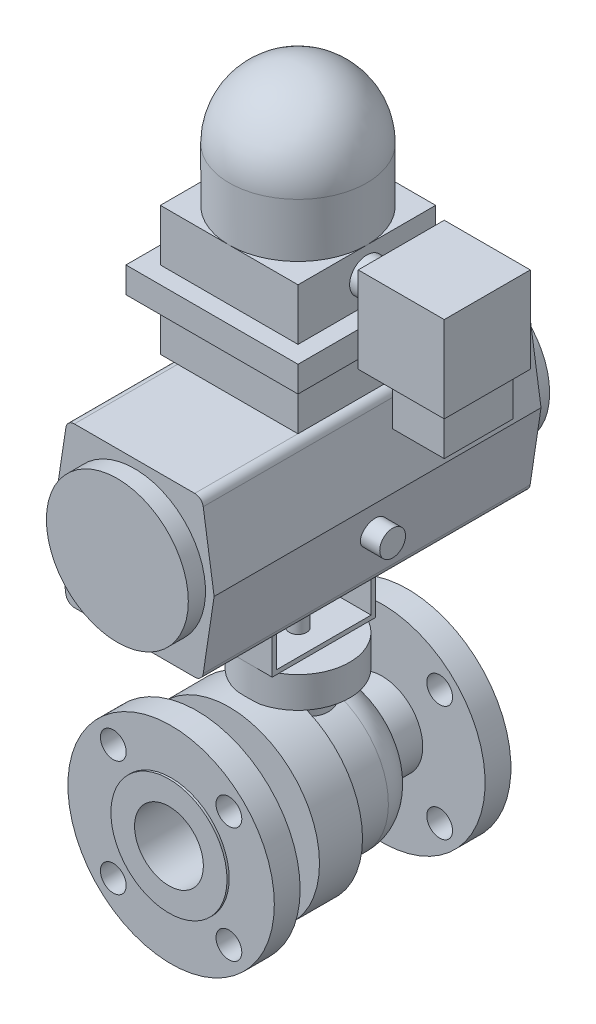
ISO-10303-21;
HEADER;
FILE_DESCRIPTION(('STEP AP214'),'2;1');
FILE_NAME('part.step','',(''),(''),'','','');
FILE_SCHEMA(('AUTOMOTIVE_DESIGN { 1 0 10303 214 1 1 1 1 }'));
ENDSEC;
DATA;
#1=APPLICATION_CONTEXT('core data for automotive mechanical design processes');
#2=APPLICATION_PROTOCOL_DEFINITION('international standard','automotive_design',2000,#1);
#3=PRODUCT_CONTEXT('',#1,'mechanical');
#4=PRODUCT('Part','Part','',(#3));
#5=PRODUCT_RELATED_PRODUCT_CATEGORY('part','',(#4));
#6=PRODUCT_DEFINITION_FORMATION('','',#4);
#7=PRODUCT_DEFINITION_CONTEXT('part definition',#1,'design');
#8=PRODUCT_DEFINITION('design','',#6,#7);
#9=PRODUCT_DEFINITION_SHAPE('','',#8);
#10=(LENGTH_UNIT() NAMED_UNIT(*) SI_UNIT(.MILLI.,.METRE.));
#11=(NAMED_UNIT(*) PLANE_ANGLE_UNIT() SI_UNIT($,.RADIAN.));
#12=(NAMED_UNIT(*) SI_UNIT($,.STERADIAN.) SOLID_ANGLE_UNIT());
#13=UNCERTAINTY_MEASURE_WITH_UNIT(LENGTH_MEASURE(1.E-05),#10,'distance_accuracy_value','');
#14=(GEOMETRIC_REPRESENTATION_CONTEXT(3) GLOBAL_UNCERTAINTY_ASSIGNED_CONTEXT((#13)) GLOBAL_UNIT_ASSIGNED_CONTEXT((#10,
#11,#12)) REPRESENTATION_CONTEXT('',''));
#15=CARTESIAN_POINT('',(0.,0.,0.));
#16=DIRECTION('',(0.,0.,1.));
#17=DIRECTION('',(1.,0.,0.));
#18=AXIS2_PLACEMENT_3D('',#15,#16,#17);
#19=CARTESIAN_POINT('',(0.,-135.5725,0.));
#20=DIRECTION('',(0.,-1.,0.));
#21=DIRECTION('',(0.,0.,-1.));
#22=AXIS2_PLACEMENT_3D('',#19,#20,#21);
#23=PLANE('',#22);
#24=DIRECTION('',(0.,0.,1.));
#25=VECTOR('',#24,1.);
#26=CARTESIAN_POINT('',(9.18008850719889,-135.5725,19.0500000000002));
#27=LINE('',#26,#25);
#28=CARTESIAN_POINT('',(9.18008850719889,-135.5725,36.9775063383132));
#29=VERTEX_POINT('',#28);
#30=CARTESIAN_POINT('',(9.18008850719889,-135.5725,20.2404693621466));
#31=VERTEX_POINT('',#30);
#32=EDGE_CURVE('E378',#29,#31,#27,.F.);
#33=ORIENTED_EDGE('',*,*,#32,.T.);
#34=CARTESIAN_POINT('',(0.,-135.5725,0.));
#35=DIRECTION('',(0.,-1.,0.));
#36=DIRECTION('',(0.,0.,-1.));
#37=AXIS2_PLACEMENT_3D('',#34,#35,#36);
#38=CIRCLE('',#37,22.225);
#39=CARTESIAN_POINT('',(-9.18008850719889,-135.5725,20.2404693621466));
#40=VERTEX_POINT('',#39);
#41=EDGE_CURVE('E366',#40,#31,#38,.T.);
#42=ORIENTED_EDGE('',*,*,#41,.F.);
#43=DIRECTION('',(0.,0.,1.));
#44=VECTOR('',#43,1.);
#45=CARTESIAN_POINT('',(-9.18008850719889,-135.5725,19.0500000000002));
#46=LINE('',#45,#44);
#47=CARTESIAN_POINT('',(-9.18008850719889,-135.5725,36.9775063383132));
#48=VERTEX_POINT('',#47);
#49=EDGE_CURVE('E385',#40,#48,#46,.T.);
#50=ORIENTED_EDGE('',*,*,#49,.T.);
#51=CARTESIAN_POINT('',(0.,-135.5725,0.));
#52=DIRECTION('',(0.,-1.,0.));
#53=DIRECTION('',(0.,0.,-1.));
#54=AXIS2_PLACEMENT_3D('',#51,#52,#53);
#55=CIRCLE('',#54,38.1);
#56=EDGE_CURVE('E383',#48,#29,#55,.T.);
#57=ORIENTED_EDGE('',*,*,#56,.T.);
#58=EDGE_LOOP('',(#33,#42,#50,#57));
#59=FACE_BOUND('',#58,.T.);
#60=ADVANCED_FACE('F33',(#59),#23,.T.);
#61=CARTESIAN_POINT('',(0.,-201.6125,-12.7496579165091));
#62=DIRECTION('',(0.,0.,-1.));
#63=DIRECTION('',(-1.,0.,0.));
#64=AXIS2_PLACEMENT_3D('',#61,#62,#63);
#65=TOROIDAL_SURFACE('',#64,28.575,25.4);
#66=CARTESIAN_POINT('',(0.,-201.6125,-38.0999999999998));
#67=DIRECTION('',(0.,0.,-1.));
#68=DIRECTION('',(-1.,0.,0.));
#69=AXIS2_PLACEMENT_3D('',#66,#67,#68);
#70=CIRCLE('',#69,30.1625);
#71=CARTESIAN_POINT('',(-30.1625,-201.6125,-38.0999999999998));
#72=VERTEX_POINT('',#71);
#73=EDGE_CURVE('E392',#72,#72,#70,.F.);
#74=ORIENTED_EDGE('',*,*,#73,.T.);
#75=EDGE_LOOP('',(#74));
#76=FACE_BOUND('',#75,.T.);
#77=CARTESIAN_POINT('',(0.,-201.6125,-12.7496579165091));
#78=DIRECTION('',(0.,0.,-1.));
#79=DIRECTION('',(-1.,0.,0.));
#80=AXIS2_PLACEMENT_3D('',#77,#78,#79);
#81=CIRCLE('',#80,53.975);
#82=CARTESIAN_POINT('',(-18.2043085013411,-150.800062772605,-12.7496579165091));
#83=VERTEX_POINT('',#82);
#84=CARTESIAN_POINT('',(18.2043085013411,-150.800062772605,-12.7496579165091));
#85=VERTEX_POINT('',#84);
#86=EDGE_CURVE('E395',#83,#85,#81,.F.);
#87=ORIENTED_EDGE('',*,*,#86,.F.);
#88=CARTESIAN_POINT('',(-18.2044485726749,-150.80011295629,-12.7494579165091));
#89=CARTESIAN_POINT('',(-18.035131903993,-150.739448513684,-12.9912225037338));
#90=CARTESIAN_POINT('',(-17.8606884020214,-150.681573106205,-13.2300476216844));
#91=CARTESIAN_POINT('',(-17.5017813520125,-150.571176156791,-13.701313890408));
#92=CARTESIAN_POINT('',(-17.3173179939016,-150.518654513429,-13.9337551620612));
#93=CARTESIAN_POINT('',(-16.7494157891,-150.368827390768,-14.6205450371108));
#94=CARTESIAN_POINT('',(-16.3513059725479,-150.279203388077,-15.064586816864));
#95=CARTESIAN_POINT('',(-15.5198141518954,-150.118750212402,-15.9198318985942));
#96=CARTESIAN_POINT('',(-15.086514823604,-150.04787856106,-16.3311079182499));
#97=CARTESIAN_POINT('',(-14.1868143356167,-149.922487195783,-17.1184765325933));
#98=CARTESIAN_POINT('',(-13.7204123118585,-149.86796790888,-17.4945682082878));
#99=CARTESIAN_POINT('',(-12.7579573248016,-149.773001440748,-18.2083510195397));
#100=CARTESIAN_POINT('',(-12.2619119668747,-149.732550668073,-18.5460519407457));
#101=CARTESIAN_POINT('',(-11.2435470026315,-149.663331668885,-19.1805421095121));
#102=CARTESIAN_POINT('',(-10.7212272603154,-149.634563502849,-19.4773311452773));
#103=CARTESIAN_POINT('',(-9.65382537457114,-149.586353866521,-20.0278549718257));
#104=CARTESIAN_POINT('',(-9.10873832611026,-149.56691441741,-20.2815804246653));
#105=CARTESIAN_POINT('',(-7.99962713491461,-149.535133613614,-20.7440985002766));
#106=CARTESIAN_POINT('',(-7.43560276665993,-149.522792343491,-20.9528905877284));
#107=CARTESIAN_POINT('',(-6.28006439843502,-149.502976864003,-21.3281115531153));
#108=CARTESIAN_POINT('',(-5.68821982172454,-149.495613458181,-21.4935287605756));
#109=CARTESIAN_POINT('',(-4.49283459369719,-149.484384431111,-21.7748041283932));
#110=CARTESIAN_POINT('',(-3.88929378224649,-149.480518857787,-21.8906616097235));
#111=CARTESIAN_POINT('',(-2.67456844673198,-149.474946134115,-22.0720295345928));
#112=CARTESIAN_POINT('',(-2.06338251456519,-149.473239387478,-22.1375305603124));
#113=CARTESIAN_POINT('',(-0.837683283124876,-149.471198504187,-22.2176981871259));
#114=CARTESIAN_POINT('',(-0.22316996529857,-149.470864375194,-22.2323645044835));
#115=CARTESIAN_POINT('',(1.01480300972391,-149.471392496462,-22.210586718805));
#116=CARTESIAN_POINT('',(1.63824835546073,-149.472273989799,-22.1733204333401));
#117=CARTESIAN_POINT('',(2.87979692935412,-149.475734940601,-22.0464688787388));
#118=CARTESIAN_POINT('',(3.49790007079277,-149.478314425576,-21.9568827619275));
#119=CARTESIAN_POINT('',(4.72436182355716,-149.486267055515,-21.7260304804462));
#120=CARTESIAN_POINT('',(5.33272045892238,-149.491640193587,-21.5847644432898));
#121=CARTESIAN_POINT('',(6.53534194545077,-149.506824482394,-21.2515705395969));
#122=CARTESIAN_POINT('',(7.12960496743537,-149.516635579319,-21.0596432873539));
#123=CARTESIAN_POINT('',(8.29994585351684,-149.542784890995,-20.6264630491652));
#124=CARTESIAN_POINT('',(8.87601791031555,-149.559125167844,-20.3851944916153));
#125=CARTESIAN_POINT('',(10.0055937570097,-149.600737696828,-19.8551738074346));
#126=CARTESIAN_POINT('',(10.5590966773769,-149.626010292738,-19.566419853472));
#127=CARTESIAN_POINT('',(11.6391282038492,-149.688064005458,-18.9438555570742));
#128=CARTESIAN_POINT('',(12.1656696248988,-149.724839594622,-18.6100668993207));
#129=CARTESIAN_POINT('',(13.1880391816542,-149.812557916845,-17.9000953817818));
#130=CARTESIAN_POINT('',(13.6838721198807,-149.863498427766,-17.5239191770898));
#131=CARTESIAN_POINT('',(14.5487966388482,-149.970708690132,-16.8087646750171));
#132=CARTESIAN_POINT('',(14.9238992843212,-150.024059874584,-16.4765871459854));
#133=CARTESIAN_POINT('',(15.6497739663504,-150.14298736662,-15.7887658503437));
#134=CARTESIAN_POINT('',(16.0005499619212,-150.208561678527,-15.4331259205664));
#135=CARTESIAN_POINT('',(16.6763227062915,-150.353205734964,-14.7003188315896));
#136=CARTESIAN_POINT('',(17.0013062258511,-150.432282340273,-14.3231407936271));
#137=CARTESIAN_POINT('',(17.4681411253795,-150.561817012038,-13.7432288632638));
#138=CARTESIAN_POINT('',(17.6203428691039,-150.606825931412,-13.5475242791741));
#139=CARTESIAN_POINT('',(17.9177080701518,-150.700611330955,-13.1517160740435));
#140=CARTESIAN_POINT('',(18.0628714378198,-150.749387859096,-12.9516123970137));
#141=CARTESIAN_POINT('',(18.2044485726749,-150.80011295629,-12.7494579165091));
#142=B_SPLINE_CURVE_WITH_KNOTS('',3,(#88,#89,#90,#91,#92,#93,#94,#95,#96,#97,#98,#99,#100,#101,
#102,#103,#104,#105,#106,#107,#108,#109,#110,#111,#112,#113,#114,#115,#116,#117,#118,#119,#120,
#121,#122,#123,#124,#125,#126,#127,#128,#129,#130,#131,#132,#133,#134,#135,#136,#137,#138,#139,
#140,#141),.UNSPECIFIED.,.F.,.F.,(4,2,2,2,2,2,2,2,2,2,2,2,2,2,2,2,2,2,2,2,2,2,2,2,2,2,4),(0.,
0.903835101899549,1.80765307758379,3.614443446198,5.41710528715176,7.21981419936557,
9.02206257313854,10.8243202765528,12.6269682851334,14.4296377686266,16.2712172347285,
18.1128219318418,19.9547709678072,21.7967302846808,23.6681845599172,25.5396691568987,
27.4111491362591,29.2826064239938,31.1546552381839,33.02677610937,34.8979987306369,
36.7689279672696,38.27932662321,39.7894788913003,41.300400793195,42.0561832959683,
42.8119754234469),.UNSPECIFIED.);
#143=EDGE_CURVE('E901',#83,#85,#142,.T.);
#144=ORIENTED_EDGE('',*,*,#143,.T.);
#145=EDGE_LOOP('',(#87,#144));
#146=FACE_BOUND('',#145,.T.);
#147=ADVANCED_FACE('F35',(#76,#146),#65,.T.);
#148=CARTESIAN_POINT('',(0.,-201.6125,-38.0999999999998));
#149=DIRECTION('',(0.,0.,1.));
#150=DIRECTION('',(1.,0.,0.));
#151=AXIS2_PLACEMENT_3D('',#148,#149,#150);
#152=CYLINDRICAL_SURFACE('',#151,53.975);
#153=CARTESIAN_POINT('',(0.,-147.6375,22.225));
#154=CARTESIAN_POINT('',(0.596105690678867,-147.637503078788,22.2249961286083));
#155=CARTESIAN_POINT('',(1.19242138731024,-147.64740233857,22.2009847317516));
#156=CARTESIAN_POINT('',(2.38081521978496,-147.686752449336,22.1051602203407));
#157=CARTESIAN_POINT('',(2.97289038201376,-147.716215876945,22.033316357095));
#158=CARTESIAN_POINT('',(4.14956829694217,-147.794007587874,21.8423384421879));
#159=CARTESIAN_POINT('',(4.7341500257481,-147.84238039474,21.7230927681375));
#160=CARTESIAN_POINT('',(5.89011212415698,-147.956703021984,21.4385517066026));
#161=CARTESIAN_POINT('',(6.46149455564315,-148.022650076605,21.2732635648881));
#162=CARTESIAN_POINT('',(7.58544953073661,-148.170177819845,20.8988346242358));
#163=CARTESIAN_POINT('',(8.13807856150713,-148.251705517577,20.6898422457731));
#164=CARTESIAN_POINT('',(9.22311492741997,-148.428508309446,20.2294864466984));
#165=CARTESIAN_POINT('',(9.75552152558,-148.523783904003,19.9781214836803));
#166=CARTESIAN_POINT('',(10.7968227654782,-148.725730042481,19.4351205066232));
#167=CARTESIAN_POINT('',(11.3057268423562,-148.832395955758,19.14350084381));
#168=CARTESIAN_POINT('',(12.2975364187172,-149.054631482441,18.5219802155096));
#169=CARTESIAN_POINT('',(12.7804413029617,-149.170201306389,18.192078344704));
#170=CARTESIAN_POINT('',(13.7389117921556,-149.412900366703,17.4804194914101));
#171=CARTESIAN_POINT('',(14.2131685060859,-149.540315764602,17.0969967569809));
#172=CARTESIAN_POINT('',(15.1280677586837,-149.798716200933,16.2930370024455));
#173=CARTESIAN_POINT('',(15.5687093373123,-149.929701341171,15.8724989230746));
#174=CARTESIAN_POINT('',(16.414183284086,-150.191966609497,14.996532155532));
#175=CARTESIAN_POINT('',(16.8189976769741,-150.323246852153,14.5410861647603));
#176=CARTESIAN_POINT('',(17.5903150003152,-150.582636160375,13.5978850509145));
#177=CARTESIAN_POINT('',(17.9568179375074,-150.710745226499,13.1101299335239));
#178=CARTESIAN_POINT('',(18.4843512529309,-150.900897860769,12.3442981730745));
#179=CARTESIAN_POINT('',(18.660165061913,-150.965369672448,12.0768939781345));
#180=CARTESIAN_POINT('',(19.0002737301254,-151.091978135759,11.5344136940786));
#181=CARTESIAN_POINT('',(19.1645712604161,-151.154115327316,11.2593394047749));
#182=CARTESIAN_POINT('',(19.6397954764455,-151.336320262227,10.4230553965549));
#183=CARTESIAN_POINT('',(19.9330809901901,-151.452191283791,9.85074506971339));
#184=CARTESIAN_POINT('',(20.4697143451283,-151.668779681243,8.68075862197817));
#185=CARTESIAN_POINT('',(20.7130819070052,-151.769503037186,8.08309263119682));
#186=CARTESIAN_POINT('',(21.147622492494,-151.952311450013,6.86628619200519));
#187=CARTESIAN_POINT('',(21.3387993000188,-152.034397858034,6.2471473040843));
#188=CARTESIAN_POINT('',(21.6590184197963,-152.173481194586,5.02188590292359));
#189=CARTESIAN_POINT('',(21.7905725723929,-152.231481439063,4.41653352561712));
#190=CARTESIAN_POINT('',(22.0028360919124,-152.325692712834,3.19529001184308));
#191=CARTESIAN_POINT('',(22.0835469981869,-152.361904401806,2.57939919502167));
#192=CARTESIAN_POINT('',(22.1931077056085,-152.411176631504,1.34237952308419));
#193=CARTESIAN_POINT('',(22.2219812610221,-152.424247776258,0.721253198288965));
#194=CARTESIAN_POINT('',(22.2275688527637,-152.426771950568,-0.52126648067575));
#195=CARTESIAN_POINT('',(22.2042855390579,-152.416226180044,-1.14265981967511));
#196=CARTESIAN_POINT('',(22.1095485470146,-152.373583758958,-2.33422704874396));
#197=CARTESIAN_POINT('',(22.041820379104,-152.343154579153,-2.9047618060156));
#198=CARTESIAN_POINT('',(21.8626976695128,-152.263410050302,-4.03755732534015));
#199=CARTESIAN_POINT('',(21.7513056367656,-152.214095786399,-4.59981856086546));
#200=CARTESIAN_POINT('',(21.4859475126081,-152.098102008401,-5.71242853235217));
#201=CARTESIAN_POINT('',(21.331975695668,-152.031420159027,-6.26277565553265));
#202=CARTESIAN_POINT('',(20.9828701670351,-151.882672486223,-7.34811408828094));
#203=CARTESIAN_POINT('',(20.7877348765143,-151.800606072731,-7.88310480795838));
#204=CARTESIAN_POINT('',(20.3534010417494,-151.621540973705,-8.94572693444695));
#205=CARTESIAN_POINT('',(20.1133640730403,-151.524265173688,-9.47296857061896));
#206=CARTESIAN_POINT('',(19.5938937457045,-151.318783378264,-10.5054241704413));
#207=CARTESIAN_POINT('',(19.3144602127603,-151.210577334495,-11.0106380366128));
#208=CARTESIAN_POINT('',(18.7180440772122,-150.986054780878,-11.9965590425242));
#209=CARTESIAN_POINT('',(18.4010574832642,-150.869737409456,-12.4772635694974));
#210=CARTESIAN_POINT('',(17.7313091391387,-150.631840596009,-13.4120118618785));
#211=CARTESIAN_POINT('',(17.3785308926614,-150.51025874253,-13.8660431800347));
#212=CARTESIAN_POINT('',(16.6087220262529,-150.254650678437,-14.7813192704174));
#213=CARTESIAN_POINT('',(16.1887921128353,-150.120424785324,-15.2400737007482));
#214=CARTESIAN_POINT('',(15.3120196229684,-149.852934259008,-16.1207515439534));
#215=CARTESIAN_POINT('',(14.8551915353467,-149.719669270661,-16.5426892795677));
#216=CARTESIAN_POINT('',(13.9068198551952,-149.457509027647,-17.3475630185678));
#217=CARTESIAN_POINT('',(13.4152607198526,-149.328615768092,-17.7304813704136));
#218=CARTESIAN_POINT('',(12.4003829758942,-149.078661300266,-18.4545298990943));
#219=CARTESIAN_POINT('',(11.8770644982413,-148.957600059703,-18.7956602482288));
#220=CARTESIAN_POINT('',(10.7897896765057,-148.723966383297,-19.4406629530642));
#221=CARTESIAN_POINT('',(10.2251897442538,-148.611641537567,-19.743542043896));
#222=CARTESIAN_POINT('',(9.06966062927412,-148.401724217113,-20.3003245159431));
#223=CARTESIAN_POINT('',(8.47873079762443,-148.304132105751,-20.5542266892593));
#224=CARTESIAN_POINT('',(7.27499420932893,-148.126567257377,-21.0104536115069));
#225=CARTESIAN_POINT('',(6.66219711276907,-148.046586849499,-21.2128008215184));
#226=CARTESIAN_POINT('',(5.41920578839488,-147.906598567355,-21.5638540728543));
#227=CARTESIAN_POINT('',(4.78901285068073,-147.846589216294,-21.7125640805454));
#228=CARTESIAN_POINT('',(3.55593443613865,-147.751435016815,-21.9470965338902));
#229=CARTESIAN_POINT('',(2.95378204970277,-147.714977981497,-22.0362495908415));
#230=CARTESIAN_POINT('',(1.74332009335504,-147.662260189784,-22.164878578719));
#231=CARTESIAN_POINT('',(1.13501077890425,-147.645998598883,-22.2043565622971));
#232=CARTESIAN_POINT('',(-0.0828460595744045,-147.634129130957,-22.2331889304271));
#233=CARTESIAN_POINT('',(-0.692393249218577,-147.638516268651,-22.2225554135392));
#234=CARTESIAN_POINT('',(-1.90805397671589,-147.667809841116,-22.1513127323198));
#235=CARTESIAN_POINT('',(-2.51416758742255,-147.692715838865,-22.090704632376));
#236=CARTESIAN_POINT('',(-3.68914036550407,-147.760663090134,-21.9243192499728));
#237=CARTESIAN_POINT('',(-4.2583848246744,-147.80277021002,-21.820865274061));
#238=CARTESIAN_POINT('',(-5.38562657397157,-147.903879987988,-21.5703267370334));
#239=CARTESIAN_POINT('',(-5.94362431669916,-147.962881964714,-21.4232439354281));
#240=CARTESIAN_POINT('',(-7.04484475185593,-148.09634844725,-21.0867804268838));
#241=CARTESIAN_POINT('',(-7.58806632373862,-148.170814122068,-20.8973965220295));
#242=CARTESIAN_POINT('',(-8.6564442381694,-148.333436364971,-20.4779388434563));
#243=CARTESIAN_POINT('',(-9.18159992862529,-148.421593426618,-20.2478636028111));
#244=CARTESIAN_POINT('',(-10.226820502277,-148.612465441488,-19.7410852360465));
#245=CARTESIAN_POINT('',(-10.7462260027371,-148.715546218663,-19.4631604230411));
#246=CARTESIAN_POINT('',(-11.7598348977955,-148.931616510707,-18.868024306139));
#247=CARTESIAN_POINT('',(-12.2540379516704,-149.044606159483,-18.5508124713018));
#248=CARTESIAN_POINT('',(-13.214768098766,-149.277856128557,-17.8791534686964));
#249=CARTESIAN_POINT('',(-13.6812900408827,-149.398117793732,-17.5246994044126));
#250=CARTESIAN_POINT('',(-14.5843839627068,-149.643130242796,-16.7806088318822));
#251=CARTESIAN_POINT('',(-15.0209451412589,-149.767882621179,-16.3909597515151));
#252=CARTESIAN_POINT('',(-15.8911213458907,-150.027684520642,-15.5503662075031));
#253=CARTESIAN_POINT('',(-16.3224076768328,-150.162845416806,-15.0970421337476));
#254=CARTESIAN_POINT('',(-17.145519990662,-150.43126100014,-14.155313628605));
#255=CARTESIAN_POINT('',(-17.5373434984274,-150.564515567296,-13.6669070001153));
#256=CARTESIAN_POINT('',(-18.2791975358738,-150.825432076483,-12.6575661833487));
#257=CARTESIAN_POINT('',(-18.6292105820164,-150.953091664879,-12.1366185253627));
#258=CARTESIAN_POINT('',(-19.284661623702,-151.198960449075,-11.0655536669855));
#259=CARTESIAN_POINT('',(-19.5901174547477,-151.317173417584,-10.5154482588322));
#260=CARTESIAN_POINT('',(-20.1578938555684,-151.542005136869,-9.38174159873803));
#261=CARTESIAN_POINT('',(-20.4195952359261,-151.648451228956,-8.79779532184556));
#262=CARTESIAN_POINT('',(-20.892460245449,-151.844324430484,-7.6069775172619));
#263=CARTESIAN_POINT('',(-21.1036230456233,-151.933751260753,-7.00010561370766));
#264=CARTESIAN_POINT('',(-21.4730202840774,-152.092297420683,-5.76829064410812));
#265=CARTESIAN_POINT('',(-21.6312900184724,-152.161430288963,-5.14335993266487));
#266=CARTESIAN_POINT('',(-21.8931851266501,-152.276816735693,-3.8800852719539));
#267=CARTESIAN_POINT('',(-21.996815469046,-152.32307239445,-3.24174254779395));
#268=CARTESIAN_POINT('',(-22.1423833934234,-152.388305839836,-2.005733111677));
#269=CARTESIAN_POINT('',(-22.1883909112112,-152.409080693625,-1.40863752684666));
#270=CARTESIAN_POINT('',(-22.2320430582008,-152.42878830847,-0.212333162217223));
#271=CARTESIAN_POINT('',(-22.2296902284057,-152.427722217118,0.386875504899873));
#272=CARTESIAN_POINT('',(-22.1766559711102,-152.403787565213,1.58262118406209));
#273=CARTESIAN_POINT('',(-22.1259809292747,-152.380921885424,2.17915853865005));
#274=CARTESIAN_POINT('',(-21.9769032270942,-152.31419376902,3.36503744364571));
#275=CARTESIAN_POINT('',(-21.87850089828,-152.270331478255,3.95437904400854));
#276=CARTESIAN_POINT('',(-21.6404911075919,-152.165499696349,5.09551231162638));
#277=CARTESIAN_POINT('',(-21.5029130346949,-152.105378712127,5.64780763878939));
#278=CARTESIAN_POINT('',(-21.1864861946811,-151.969141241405,6.73838198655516));
#279=CARTESIAN_POINT('',(-21.0076390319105,-151.893025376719,7.27666155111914));
#280=CARTESIAN_POINT('',(-20.610154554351,-151.726945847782,8.33620996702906));
#281=CARTESIAN_POINT('',(-20.3915097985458,-151.636979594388,8.85747561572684));
#282=CARTESIAN_POINT('',(-19.9160966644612,-151.445624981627,9.88016994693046));
#283=CARTESIAN_POINT('',(-19.659324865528,-151.344235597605,10.3815968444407));
#284=CARTESIAN_POINT('',(-19.0930793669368,-151.126340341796,11.3912021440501));
#285=CARTESIAN_POINT('',(-18.7813836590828,-151.009294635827,11.8980183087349));
#286=CARTESIAN_POINT('',(-18.1192386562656,-150.768445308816,12.8839624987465));
#287=CARTESIAN_POINT('',(-17.768788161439,-150.6446414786,13.3630896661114));
#288=CARTESIAN_POINT('',(-17.0311153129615,-150.393425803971,14.2913714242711));
#289=CARTESIAN_POINT('',(-16.6438822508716,-150.266012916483,14.7405172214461));
#290=CARTESIAN_POINT('',(-15.8348528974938,-150.010775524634,15.606381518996));
#291=CARTESIAN_POINT('',(-15.4130563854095,-149.882951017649,16.0230998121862));
#292=CARTESIAN_POINT('',(-14.5061533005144,-149.621055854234,16.8500675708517));
#293=CARTESIAN_POINT('',(-14.0186797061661,-149.48718046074,17.257788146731));
#294=CARTESIAN_POINT('',(-13.0094247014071,-149.226173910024,18.0307945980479));
#295=CARTESIAN_POINT('',(-12.4876411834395,-149.099043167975,18.3960778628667));
#296=CARTESIAN_POINT('',(-11.4126147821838,-148.854971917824,19.0816523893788));
#297=CARTESIAN_POINT('',(-10.8593553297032,-148.738036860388,19.401919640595));
#298=CARTESIAN_POINT('',(-9.72517682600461,-148.517724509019,19.9945210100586));
#299=CARTESIAN_POINT('',(-9.14426006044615,-148.414346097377,20.2668590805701));
#300=CARTESIAN_POINT('',(-7.96892253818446,-148.22575070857,20.7568121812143));
#301=CARTESIAN_POINT('',(-7.37490656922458,-148.140251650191,20.9752887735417));
#302=CARTESIAN_POINT('',(-6.16810119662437,-147.987645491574,21.3613317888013));
#303=CARTESIAN_POINT('',(-5.55530864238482,-147.920541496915,21.5288896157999));
#304=CARTESIAN_POINT('',(-4.3175862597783,-147.80688434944,21.8107971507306));
#305=CARTESIAN_POINT('',(-3.692695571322,-147.760273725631,21.9252957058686));
#306=CARTESIAN_POINT('',(-2.43449450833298,-147.688754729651,22.1003791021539));
#307=CARTESIAN_POINT('',(-1.8011907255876,-147.66383027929,22.1610038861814));
#308=CARTESIAN_POINT('',(-0.972254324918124,-147.645906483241,22.2045770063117));
#309=CARTESIAN_POINT('',(-0.777902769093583,-147.642755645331,22.212233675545));
#310=CARTESIAN_POINT('',(-0.389041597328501,-147.638551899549,22.2224458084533));
#311=CARTESIAN_POINT('',(-0.194531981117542,-147.637498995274,22.2250012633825));
#312=CARTESIAN_POINT('',(0.,-147.6375,22.225));
#313=B_SPLINE_CURVE_WITH_KNOTS('',3,(#153,#154,#155,#156,#157,#158,#159,#160,#161,#162,#163,
#164,#165,#166,#167,#168,#169,#170,#171,#172,#173,#174,#175,#176,#177,#178,#179,#180,#181,#182,
#183,#184,#185,#186,#187,#188,#189,#190,#191,#192,#193,#194,#195,#196,#197,#198,#199,#200,#201,
#202,#203,#204,#205,#206,#207,#208,#209,#210,#211,#212,#213,#214,#215,#216,#217,#218,#219,#220,
#221,#222,#223,#224,#225,#226,#227,#228,#229,#230,#231,#232,#233,#234,#235,#236,#237,#238,#239,
#240,#241,#242,#243,#244,#245,#246,#247,#248,#249,#250,#251,#252,#253,#254,#255,#256,#257,#258,
#259,#260,#261,#262,#263,#264,#265,#266,#267,#268,#269,#270,#271,#272,#273,#274,#275,#276,#277,
#278,#279,#280,#281,#282,#283,#284,#285,#286,#287,#288,#289,#290,#291,#292,#293,#294,#295,#296,
#297,#298,#299,#300,#301,#302,#303,#304,#305,#306,#307,#308,#309,#310,#311,#312),.UNSPECIFIED.,
.T.,.F.,(4,2,2,2,2,2,2,2,2,2,2,2,2,2,2,2,2,2,2,2,2,2,2,2,2,2,2,2,2,2,2,2,2,2,2,2,2,2,2,2,2,2,2,
2,2,2,2,2,2,2,2,2,2,2,2,2,2,2,2,2,2,2,2,2,2,2,2,2,2,2,2,2,2,2,2,2,2,2,2,4),(0.,1.78811854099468,
3.57738766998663,5.37089539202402,7.16412102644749,8.95135295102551,10.7386499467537,
12.5252230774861,14.311838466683,16.1788776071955,18.0459700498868,19.9139940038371,
21.7820176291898,22.7611129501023,23.7399804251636,25.6975690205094,27.6543827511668,
29.6110545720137,31.4751493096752,33.3391876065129,35.2023714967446,37.065460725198,
38.7894759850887,40.5133921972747,42.2375403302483,43.9617546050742,45.7221365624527,
47.4825263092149,49.2431033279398,51.0044955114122,52.9110776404,54.8169147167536,
56.7236101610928,58.6302977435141,60.5792415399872,62.5282333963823,64.4763746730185,
66.4243718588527,68.2514518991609,70.0784564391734,71.9050199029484,73.7315444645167,
75.4698391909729,77.2080638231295,78.9464199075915,80.6848386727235,82.4770048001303,
84.269195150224,86.0617179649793,87.8548836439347,89.7731030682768,91.6914427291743,
93.6105817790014,95.5289505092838,97.4725135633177,99.4161084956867,101.358403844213,
103.300522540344,105.095890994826,106.891165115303,108.686202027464,110.481226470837,
112.196340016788,113.911386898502,115.626754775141,117.342276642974,119.159507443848,
120.976794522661,122.794612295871,124.612441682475,126.558473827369,128.504625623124,
130.451811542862,132.398836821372,134.312334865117,136.226155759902,138.134574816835,
140.041577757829,140.625107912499,141.208639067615),.UNSPECIFIED.);
#314=CARTESIAN_POINT('',(11.4476252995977,-148.86543847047,19.0500000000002));
#315=VERTEX_POINT('',#314);
#316=EDGE_CURVE('E902',#315,#85,#313,.T.);
#317=ORIENTED_EDGE('',*,*,#316,.F.);
#318=CARTESIAN_POINT('',(0.,-201.6125,19.0500000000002));
#319=DIRECTION('',(0.,0.,1.));
#320=DIRECTION('',(1.,0.,0.));
#321=AXIS2_PLACEMENT_3D('',#318,#319,#320);
#322=CIRCLE('',#321,53.975);
#323=CARTESIAN_POINT('',(-11.4476252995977,-148.86543847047,19.0500000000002));
#324=VERTEX_POINT('',#323);
#325=EDGE_CURVE('E396',#315,#324,#322,.F.);
#326=ORIENTED_EDGE('',*,*,#325,.T.);
#327=EDGE_CURVE('E896',#83,#324,#313,.T.);
#328=ORIENTED_EDGE('',*,*,#327,.F.);
#329=ORIENTED_EDGE('',*,*,#86,.T.);
#330=EDGE_LOOP('',(#317,#326,#328,#329));
#331=FACE_BOUND('',#330,.T.);
#332=ADVANCED_FACE('F889',(#331),#152,.T.);
#333=CARTESIAN_POINT('',(0.,-201.6125,19.0500000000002));
#334=DIRECTION('',(0.,0.,1.));
#335=DIRECTION('',(1.,0.,0.));
#336=AXIS2_PLACEMENT_3D('',#333,#334,#335);
#337=PLANE('',#336);
#338=DIRECTION('',(0.,1.,0.));
#339=VECTOR('',#338,1.);
#340=CARTESIAN_POINT('',(11.4476252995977,-158.4325,19.0500000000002));
#341=LINE('',#340,#339);
#342=CARTESIAN_POINT('',(11.4476252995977,-135.927589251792,19.0500000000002));
#343=VERTEX_POINT('',#342);
#344=EDGE_CURVE('E928',#343,#315,#341,.F.);
#345=ORIENTED_EDGE('',*,*,#344,.F.);
#346=CARTESIAN_POINT('',(0.,-201.6125,19.0500000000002));
#347=DIRECTION('',(0.,0.,1.));
#348=DIRECTION('',(1.,0.,0.));
#349=AXIS2_PLACEMENT_3D('',#346,#347,#348);
#350=CIRCLE('',#349,66.675);
#351=CARTESIAN_POINT('',(-11.4476252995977,-135.927589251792,19.0500000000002));
#352=VERTEX_POINT('',#351);
#353=EDGE_CURVE('E380',#352,#343,#350,.T.);
#354=ORIENTED_EDGE('',*,*,#353,.F.);
#355=DIRECTION('',(0.,1.,0.));
#356=VECTOR('',#355,1.);
#357=CARTESIAN_POINT('',(-11.4476252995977,-158.4325,19.0500000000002));
#358=LINE('',#357,#356);
#359=EDGE_CURVE('E54',#324,#352,#358,.T.);
#360=ORIENTED_EDGE('',*,*,#359,.F.);
#361=ORIENTED_EDGE('',*,*,#325,.F.);
#362=EDGE_LOOP('',(#345,#354,#360,#361));
#363=FACE_BOUND('',#362,.T.);
#364=ADVANCED_FACE('F893',(#363),#337,.F.);
#365=CARTESIAN_POINT('',(0.,-201.6125,19.0500000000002));
#366=DIRECTION('',(0.,0.,1.));
#367=DIRECTION('',(1.,0.,0.));
#368=AXIS2_PLACEMENT_3D('',#365,#366,#367);
#369=CYLINDRICAL_SURFACE('',#368,66.675);
#370=CARTESIAN_POINT('',(0.,-201.6125,50.8000000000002));
#371=DIRECTION('',(0.,0.,1.));
#372=DIRECTION('',(1.,0.,0.));
#373=AXIS2_PLACEMENT_3D('',#370,#371,#372);
#374=CIRCLE('',#373,66.675);
#375=CARTESIAN_POINT('',(66.675,-201.6125,50.8000000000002));
#376=VERTEX_POINT('',#375);
#377=EDGE_CURVE('E384',#376,#376,#374,.T.);
#378=ORIENTED_EDGE('',*,*,#377,.F.);
#379=EDGE_LOOP('',(#378));
#380=FACE_BOUND('',#379,.T.);
#381=ORIENTED_EDGE('',*,*,#353,.T.);
#382=CARTESIAN_POINT('',(11.4476252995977,-135.927589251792,19.0500000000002));
#383=CARTESIAN_POINT('',(11.2647910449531,-135.895724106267,19.1598705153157));
#384=CARTESIAN_POINT('',(11.0803095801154,-135.864359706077,19.2671465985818));
#385=CARTESIAN_POINT('',(10.7083510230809,-135.802756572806,19.4763272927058));
#386=CARTESIAN_POINT('',(10.520876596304,-135.772516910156,19.5782363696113));
#387=CARTESIAN_POINT('',(10.1429208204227,-135.713233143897,19.776686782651));
#388=CARTESIAN_POINT('',(9.95243946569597,-135.684189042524,19.8732281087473));
#389=CARTESIAN_POINT('',(9.56845570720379,-135.627365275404,20.0609321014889));
#390=CARTESIAN_POINT('',(9.37495088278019,-135.599586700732,20.1520901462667));
#391=CARTESIAN_POINT('',(9.18008850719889,-135.5725,20.2404693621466));
#392=B_SPLINE_CURVE_WITH_KNOTS('',3,(#382,#383,#384,#385,#386,#387,#388,#389,#390,#391),
.UNSPECIFIED.,.F.,.F.,(4,2,2,2,4),(0.,0.647000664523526,1.2934541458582,1.93990883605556,
2.58691070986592),.UNSPECIFIED.);
#393=EDGE_CURVE('E11',#343,#31,#392,.T.);
#394=ORIENTED_EDGE('',*,*,#393,.T.);
#395=ORIENTED_EDGE('',*,*,#32,.F.);
#396=CARTESIAN_POINT('',(9.18008850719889,-135.5725,36.9775063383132));
#397=CARTESIAN_POINT('',(8.72139571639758,-135.50872888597,37.0913902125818));
#398=CARTESIAN_POINT('',(8.25998432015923,-135.449469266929,37.1968717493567));
#399=CARTESIAN_POINT('',(7.33247270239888,-135.34027189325,37.3907631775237));
#400=CARTESIAN_POINT('',(6.86637225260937,-135.290334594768,37.479172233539));
#401=CARTESIAN_POINT('',(5.93011425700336,-135.20007144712,37.6386680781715));
#402=CARTESIAN_POINT('',(5.45995536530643,-135.159748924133,37.7097488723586));
#403=CARTESIAN_POINT('',(4.5166168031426,-135.088973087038,37.8343310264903));
#404=CARTESIAN_POINT('',(4.04343720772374,-135.058519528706,37.887832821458));
#405=CARTESIAN_POINT('',(2.64248180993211,-134.983428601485,38.0196393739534));
#406=CARTESIAN_POINT('',(1.71142952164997,-134.952952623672,38.0729547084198));
#407=CARTESIAN_POINT('',(-0.152139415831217,-134.93116424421,38.1110896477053));
#408=CARTESIAN_POINT('',(-1.08465534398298,-134.939836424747,38.095936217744));
#409=CARTESIAN_POINT('',(-2.61601079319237,-134.986119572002,38.0148582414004));
#410=CARTESIAN_POINT('',(-3.2163317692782,-135.012423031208,37.968764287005));
#411=CARTESIAN_POINT('',(-4.41316313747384,-135.081013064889,37.8483235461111));
#412=CARTESIAN_POINT('',(-5.00967402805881,-135.123297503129,37.7739805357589));
#413=CARTESIAN_POINT('',(-6.20628227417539,-135.224221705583,37.5960559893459));
#414=CARTESIAN_POINT('',(-6.80629541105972,-135.283101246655,37.492045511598));
#415=CARTESIAN_POINT('',(-7.9990657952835,-135.416339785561,37.2558058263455));
#416=CARTESIAN_POINT('',(-8.59182235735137,-135.490700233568,37.1235739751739));
#417=CARTESIAN_POINT('',(-9.18008850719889,-135.5725,36.9775063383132));
#418=B_SPLINE_CURVE_WITH_KNOTS('',3,(#396,#397,#398,#399,#400,#401,#402,#403,#404,#405,#406,
#407,#408,#409,#410,#411,#412,#413,#414,#415,#416,#417),.UNSPECIFIED.,.F.,.F.,(4,2,2,2,2,2,2,2,
2,2,4),(0.,1.43060828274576,2.86128654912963,4.29245903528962,5.72359610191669,8.51927112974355,
11.3138452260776,13.1210193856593,14.9279520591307,16.762463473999,18.5971468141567),.UNSPECIFIED.);
#419=EDGE_CURVE('E868',#29,#48,#418,.T.);
#420=ORIENTED_EDGE('',*,*,#419,.T.);
#421=ORIENTED_EDGE('',*,*,#49,.F.);
#422=CARTESIAN_POINT('',(-9.18008850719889,-135.5725,20.2404693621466));
#423=CARTESIAN_POINT('',(-9.37495088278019,-135.599586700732,20.1520901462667));
#424=CARTESIAN_POINT('',(-9.56845570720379,-135.627365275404,20.0609321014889));
#425=CARTESIAN_POINT('',(-9.95243946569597,-135.684189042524,19.8732281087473));
#426=CARTESIAN_POINT('',(-10.1429208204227,-135.713233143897,19.776686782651));
#427=CARTESIAN_POINT('',(-10.520876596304,-135.772516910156,19.5782363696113));
#428=CARTESIAN_POINT('',(-10.7083510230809,-135.802756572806,19.4763272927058));
#429=CARTESIAN_POINT('',(-11.0803095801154,-135.864359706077,19.2671465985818));
#430=CARTESIAN_POINT('',(-11.2647910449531,-135.895724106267,19.1598705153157));
#431=CARTESIAN_POINT('',(-11.4476252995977,-135.927589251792,19.0500000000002));
#432=B_SPLINE_CURVE_WITH_KNOTS('',3,(#422,#423,#424,#425,#426,#427,#428,#429,#430,#431),
.UNSPECIFIED.,.F.,.F.,(4,2,2,2,4),(0.,0.647001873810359,1.29345656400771,1.93991004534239,
2.58691070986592),.UNSPECIFIED.);
#433=EDGE_CURVE('E47',#40,#352,#432,.T.);
#434=ORIENTED_EDGE('',*,*,#433,.T.);
#435=EDGE_LOOP('',(#381,#394,#395,#420,#421,#434));
#436=FACE_BOUND('',#435,.T.);
#437=ADVANCED_FACE('F376',(#380,#436),#369,.T.);
#438=CARTESIAN_POINT('',(19.05,-112.7125,-38.1));
#439=DIRECTION('',(0.,1.,0.));
#440=DIRECTION('',(0.,0.,1.));
#441=AXIS2_PLACEMENT_3D('',#438,#439,#440);
#442=PLANE('',#441);
#443=CARTESIAN_POINT('',(0.,-112.7125,0.));
#444=DIRECTION('',(0.,-1.,0.));
#445=DIRECTION('',(0.,0.,-1.));
#446=AXIS2_PLACEMENT_3D('',#443,#444,#445);
#447=CIRCLE('',#446,38.1);
#448=CARTESIAN_POINT('',(-19.05,-112.7125,-32.9955678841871));
#449=VERTEX_POINT('',#448);
#450=CARTESIAN_POINT('',(0.,-112.7125,-38.1));
#451=VERTEX_POINT('',#450);
#452=EDGE_CURVE('E929',#449,#451,#447,.T.);
#453=ORIENTED_EDGE('',*,*,#452,.F.);
#454=DIRECTION('',(0.,0.,-1.));
#455=VECTOR('',#454,1.);
#456=CARTESIAN_POINT('',(-19.05,-112.7125,-38.1));
#457=LINE('',#456,#455);
#458=CARTESIAN_POINT('',(-19.05,-112.7125,-38.1));
#459=VERTEX_POINT('',#458);
#460=EDGE_CURVE('E516',#449,#459,#457,.T.);
#461=ORIENTED_EDGE('',*,*,#460,.T.);
#462=DIRECTION('',(-1.,0.,0.));
#463=VECTOR('',#462,1.);
#464=CARTESIAN_POINT('',(19.05,-112.7125,-38.1));
#465=LINE('',#464,#463);
#466=EDGE_CURVE('E500',#451,#459,#465,.T.);
#467=ORIENTED_EDGE('',*,*,#466,.F.);
#468=EDGE_LOOP('',(#453,#461,#467));
#469=FACE_BOUND('',#468,.T.);
#470=ADVANCED_FACE('F955',(#469),#442,.F.);
#471=CARTESIAN_POINT('',(19.05,-112.7125,-32.9955678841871));
#472=VERTEX_POINT('',#471);
#473=EDGE_CURVE('E932',#451,#472,#447,.T.);
#474=ORIENTED_EDGE('',*,*,#473,.F.);
#475=CARTESIAN_POINT('',(19.05,-112.7125,-38.1));
#476=VERTEX_POINT('',#475);
#477=EDGE_CURVE('E520',#476,#451,#465,.T.);
#478=ORIENTED_EDGE('',*,*,#477,.F.);
#479=DIRECTION('',(0.,0.,-1.));
#480=VECTOR('',#479,1.);
#481=CARTESIAN_POINT('',(19.05,-112.7125,-38.1));
#482=LINE('',#481,#480);
#483=EDGE_CURVE('E62',#472,#476,#482,.T.);
#484=ORIENTED_EDGE('',*,*,#483,.F.);
#485=EDGE_LOOP('',(#474,#478,#484));
#486=FACE_BOUND('',#485,.T.);
#487=ADVANCED_FACE('F960',(#486),#442,.F.);
#488=CARTESIAN_POINT('',(0.,-112.7125,38.1));
#489=VERTEX_POINT('',#488);
#490=CARTESIAN_POINT('',(-19.05,-112.7125,32.9955678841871));
#491=VERTEX_POINT('',#490);
#492=EDGE_CURVE('E941',#489,#491,#447,.T.);
#493=ORIENTED_EDGE('',*,*,#492,.F.);
#494=DIRECTION('',(-1.,0.,0.));
#495=VECTOR('',#494,1.);
#496=CARTESIAN_POINT('',(19.05,-112.7125,38.1));
#497=LINE('',#496,#495);
#498=CARTESIAN_POINT('',(-19.05,-112.7125,38.1));
#499=VERTEX_POINT('',#498);
#500=EDGE_CURVE('E523',#489,#499,#497,.T.);
#501=ORIENTED_EDGE('',*,*,#500,.T.);
#502=EDGE_CURVE('E484',#499,#491,#457,.T.);
#503=ORIENTED_EDGE('',*,*,#502,.T.);
#504=EDGE_LOOP('',(#493,#501,#503));
#505=FACE_BOUND('',#504,.T.);
#506=ADVANCED_FACE('F962',(#505),#442,.F.);
#507=CARTESIAN_POINT('',(19.05,-112.7125,32.9955678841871));
#508=VERTEX_POINT('',#507);
#509=EDGE_CURVE('E938',#508,#489,#447,.T.);
#510=ORIENTED_EDGE('',*,*,#509,.F.);
#511=CARTESIAN_POINT('',(19.05,-112.7125,38.1));
#512=VERTEX_POINT('',#511);
#513=EDGE_CURVE('E497',#512,#508,#482,.T.);
#514=ORIENTED_EDGE('',*,*,#513,.F.);
#515=EDGE_CURVE('E524',#512,#489,#497,.T.);
#516=ORIENTED_EDGE('',*,*,#515,.T.);
#517=EDGE_LOOP('',(#510,#514,#516));
#518=FACE_BOUND('',#517,.T.);
#519=ADVANCED_FACE('F968',(#518),#442,.F.);
#520=CARTESIAN_POINT('',(19.05,-61.9125,38.1));
#521=DIRECTION('',(0.,1.,0.));
#522=DIRECTION('',(0.,0.,1.));
#523=AXIS2_PLACEMENT_3D('',#520,#521,#522);
#524=PLANE('',#523);
#525=CARTESIAN_POINT('',(0.,-61.9125,0.));
#526=DIRECTION('',(0.,1.,0.));
#527=DIRECTION('',(0.,0.,1.));
#528=AXIS2_PLACEMENT_3D('',#525,#526,#527);
#529=CIRCLE('',#528,6.35);
#530=CARTESIAN_POINT('',(0.,-61.9125,6.35));
#531=VERTEX_POINT('',#530);
#532=EDGE_CURVE('E853',#531,#531,#529,.T.);
#533=ORIENTED_EDGE('',*,*,#532,.T.);
#534=EDGE_LOOP('',(#533));
#535=FACE_BOUND('',#534,.T.);
#536=DIRECTION('',(-1.,0.,0.));
#537=VECTOR('',#536,1.);
#538=CARTESIAN_POINT('',(19.05,-61.9125,-12.7));
#539=LINE('',#538,#537);
#540=CARTESIAN_POINT('',(19.05,-61.9125,-12.7));
#541=VERTEX_POINT('',#540);
#542=CARTESIAN_POINT('',(-19.05,-61.9125,-12.7));
#543=VERTEX_POINT('',#542);
#544=EDGE_CURVE('E546',#541,#543,#539,.T.);
#545=ORIENTED_EDGE('',*,*,#544,.F.);
#546=DIRECTION('',(0.,0.,1.));
#547=VECTOR('',#546,1.);
#548=CARTESIAN_POINT('',(19.05,-61.9125,38.1));
#549=LINE('',#548,#547);
#550=CARTESIAN_POINT('',(19.05,-61.9125,12.7));
#551=VERTEX_POINT('',#550);
#552=EDGE_CURVE('E552',#541,#551,#549,.T.);
#553=ORIENTED_EDGE('',*,*,#552,.T.);
#554=DIRECTION('',(-1.,0.,0.));
#555=VECTOR('',#554,1.);
#556=CARTESIAN_POINT('',(19.05,-61.9125,12.7));
#557=LINE('',#556,#555);
#558=CARTESIAN_POINT('',(-19.05,-61.9125,12.7));
#559=VERTEX_POINT('',#558);
#560=EDGE_CURVE('E526',#551,#559,#557,.T.);
#561=ORIENTED_EDGE('',*,*,#560,.T.);
#562=DIRECTION('',(0.,0.,-1.));
#563=VECTOR('',#562,1.);
#564=CARTESIAN_POINT('',(-19.05,-61.9125,38.1));
#565=LINE('',#564,#563);
#566=EDGE_CURVE('E550',#559,#543,#565,.T.);
#567=ORIENTED_EDGE('',*,*,#566,.T.);
#568=EDGE_LOOP('',(#545,#553,#561,#567));
#569=FACE_BOUND('',#568,.T.);
#570=ADVANCED_FACE('F1003',(#535,#569),#524,.F.);
#571=CARTESIAN_POINT('',(0.,-206.0575,0.));
#572=DIRECTION('',(0.,1.,0.));
#573=DIRECTION('',(0.,0.,1.));
#574=AXIS2_PLACEMENT_3D('',#571,#572,#573);
#575=CYLINDRICAL_SURFACE('',#574,6.35);
#576=ORIENTED_EDGE('',*,*,#532,.F.);
#577=EDGE_LOOP('',(#576));
#578=FACE_BOUND('',#577,.T.);
#579=CARTESIAN_POINT('',(0.,-109.5375,0.));
#580=DIRECTION('',(0.,-1.,0.));
#581=DIRECTION('',(0.,0.,-1.));
#582=AXIS2_PLACEMENT_3D('',#579,#580,#581);
#583=CIRCLE('',#582,6.35);
#584=CARTESIAN_POINT('',(0.,-109.5375,-6.35));
#585=VERTEX_POINT('',#584);
#586=EDGE_CURVE('E856',#585,#585,#583,.T.);
#587=ORIENTED_EDGE('',*,*,#586,.F.);
#588=EDGE_LOOP('',(#587));
#589=FACE_BOUND('',#588,.T.);
#590=ADVANCED_FACE('F1006',(#578,#589),#575,.T.);
#591=CARTESIAN_POINT('',(-44.4088598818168,-58.7375,120.65));
#592=DIRECTION('',(0.,1.,0.));
#593=DIRECTION('',(0.,0.,1.));
#594=AXIS2_PLACEMENT_3D('',#591,#592,#593);
#595=PLANE('',#594);
#596=DIRECTION('',(1.,0.,0.));
#597=VECTOR('',#596,1.);
#598=CARTESIAN_POINT('',(-44.4088598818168,-58.7375,-120.65));
#599=LINE('',#598,#597);
#600=CARTESIAN_POINT('',(-44.4088598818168,-58.7375,-120.65));
#601=VERTEX_POINT('',#600);
#602=CARTESIAN_POINT('',(44.4088598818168,-58.7375,-120.65));
#603=VERTEX_POINT('',#602);
#604=EDGE_CURVE('E812',#601,#603,#599,.T.);
#605=ORIENTED_EDGE('',*,*,#604,.T.);
#606=DIRECTION('',(0.,0.,-1.));
#607=VECTOR('',#606,1.);
#608=CARTESIAN_POINT('',(44.4088598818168,-58.7375,120.65));
#609=LINE('',#608,#607);
#610=CARTESIAN_POINT('',(44.4088598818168,-58.7375,120.65));
#611=VERTEX_POINT('',#610);
#612=EDGE_CURVE('E817',#611,#603,#609,.T.);
#613=ORIENTED_EDGE('',*,*,#612,.F.);
#614=DIRECTION('',(1.,0.,0.));
#615=VECTOR('',#614,1.);
#616=CARTESIAN_POINT('',(-44.4088598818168,-58.7375,120.65));
#617=LINE('',#616,#615);
#618=CARTESIAN_POINT('',(-44.4088598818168,-58.7375,120.65));
#619=VERTEX_POINT('',#618);
#620=EDGE_CURVE('E790',#619,#611,#617,.T.);
#621=ORIENTED_EDGE('',*,*,#620,.F.);
#622=DIRECTION('',(0.,0.,-1.));
#623=VECTOR('',#622,1.);
#624=CARTESIAN_POINT('',(-44.4088598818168,-58.7375,120.65));
#625=LINE('',#624,#623);
#626=EDGE_CURVE('E820',#619,#601,#625,.T.);
#627=ORIENTED_EDGE('',*,*,#626,.T.);
#628=EDGE_LOOP('',(#605,#613,#621,#627));
#629=FACE_BOUND('',#628,.T.);
#630=DIRECTION('',(-1.,0.,0.));
#631=VECTOR('',#630,1.);
#632=CARTESIAN_POINT('',(-19.05,-58.7375,38.1));
#633=LINE('',#632,#631);
#634=CARTESIAN_POINT('',(19.05,-58.7375,38.1));
#635=VERTEX_POINT('',#634);
#636=CARTESIAN_POINT('',(-19.05,-58.7375,38.1));
#637=VERTEX_POINT('',#636);
#638=EDGE_CURVE('E549',#635,#637,#633,.T.);
#639=ORIENTED_EDGE('',*,*,#638,.F.);
#640=DIRECTION('',(0.,0.,1.));
#641=VECTOR('',#640,1.);
#642=CARTESIAN_POINT('',(19.05,-58.7375,38.1));
#643=LINE('',#642,#641);
#644=CARTESIAN_POINT('',(19.05,-58.7375,-38.1));
#645=VERTEX_POINT('',#644);
#646=EDGE_CURVE('E553',#645,#635,#643,.T.);
#647=ORIENTED_EDGE('',*,*,#646,.F.);
#648=DIRECTION('',(1.,0.,0.));
#649=VECTOR('',#648,1.);
#650=CARTESIAN_POINT('',(-19.05,-58.7375,-38.1));
#651=LINE('',#650,#649);
#652=CARTESIAN_POINT('',(-19.05,-58.7375,-38.1));
#653=VERTEX_POINT('',#652);
#654=EDGE_CURVE('E561',#653,#645,#651,.T.);
#655=ORIENTED_EDGE('',*,*,#654,.F.);
#656=DIRECTION('',(0.,0.,-1.));
#657=VECTOR('',#656,1.);
#658=CARTESIAN_POINT('',(-19.05,-58.7375,38.1));
#659=LINE('',#658,#657);
#660=EDGE_CURVE('E558',#637,#653,#659,.T.);
#661=ORIENTED_EDGE('',*,*,#660,.F.);
#662=EDGE_LOOP('',(#639,#647,#655,#661));
#663=FACE_BOUND('',#662,.T.);
#664=ADVANCED_FACE('F1081',(#629,#663),#595,.F.);
#665=CARTESIAN_POINT('',(58.7375,0.,120.65));
#666=DIRECTION('',(-0.988801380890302,0.14923749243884,0.));
#667=DIRECTION('',(-0.14923749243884,-0.988801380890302,0.));
#668=AXIS2_PLACEMENT_3D('',#665,#666,#667);
#669=PLANE('',#668);
#670=DIRECTION('',(0.14923749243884,0.988801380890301,0.));
#671=VECTOR('',#670,1.);
#672=CARTESIAN_POINT('',(58.7375,0.,-120.65));
#673=LINE('',#672,#671);
#674=CARTESIAN_POINT('',(50.6877486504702,-53.3351580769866,-120.65));
#675=VERTEX_POINT('',#674);
#676=CARTESIAN_POINT('',(58.7375,0.,-120.65));
#677=VERTEX_POINT('',#676);
#678=EDGE_CURVE('E795',#675,#677,#673,.T.);
#679=ORIENTED_EDGE('',*,*,#678,.T.);
#680=DIRECTION('',(0.,0.,-1.));
#681=VECTOR('',#680,1.);
#682=CARTESIAN_POINT('',(58.7375,0.,120.65));
#683=LINE('',#682,#681);
#684=CARTESIAN_POINT('',(58.7375,0.,120.65));
#685=VERTEX_POINT('',#684);
#686=EDGE_CURVE('E771',#685,#677,#683,.T.);
#687=ORIENTED_EDGE('',*,*,#686,.F.);
#688=DIRECTION('',(0.14923749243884,0.988801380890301,0.));
#689=VECTOR('',#688,1.);
#690=CARTESIAN_POINT('',(58.7375,0.,120.65));
#691=LINE('',#690,#689);
#692=CARTESIAN_POINT('',(50.6877486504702,-53.3351580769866,120.65));
#693=VERTEX_POINT('',#692);
#694=EDGE_CURVE('E772',#693,#685,#691,.T.);
#695=ORIENTED_EDGE('',*,*,#694,.F.);
#696=DIRECTION('',(0.,0.,-1.));
#697=VECTOR('',#696,1.);
#698=CARTESIAN_POINT('',(50.6877486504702,-53.3351580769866,120.65));
#699=LINE('',#698,#697);
#700=EDGE_CURVE('E794',#693,#675,#699,.T.);
#701=ORIENTED_EDGE('',*,*,#700,.T.);
#702=EDGE_LOOP('',(#679,#687,#695,#701));
#703=FACE_BOUND('',#702,.T.);
#704=CARTESIAN_POINT('',(55.6227301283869,-20.6375,0.));
#705=DIRECTION('',(-0.988801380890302,0.14923749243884,0.));
#706=DIRECTION('',(-0.14923749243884,-0.988801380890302,0.));
#707=AXIS2_PLACEMENT_3D('',#704,#705,#706);
#708=ELLIPSE('',#707,9.63287489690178,9.525);
#709=CARTESIAN_POINT('',(54.1851440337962,-30.1625,0.));
#710=VERTEX_POINT('',#709);
#711=EDGE_CURVE('E850',#710,#710,#708,.F.);
#712=ORIENTED_EDGE('',*,*,#711,.F.);
#713=EDGE_LOOP('',(#712));
#714=FACE_BOUND('',#713,.T.);
#715=ADVANCED_FACE('F1073',(#703,#714),#669,.F.);
#716=CARTESIAN_POINT('',(139.7,109.5375,31.75));
#717=DIRECTION('',(0.,1.,0.));
#718=DIRECTION('',(0.,0.,1.));
#719=AXIS2_PLACEMENT_3D('',#716,#717,#718);
#720=PLANE('',#719);
#721=DIRECTION('',(0.,0.,-1.));
#722=VECTOR('',#721,1.);
#723=CARTESIAN_POINT('',(76.2,109.5375,31.75));
#724=LINE('',#723,#722);
#725=CARTESIAN_POINT('',(76.2,109.5375,31.75));
#726=VERTEX_POINT('',#725);
#727=CARTESIAN_POINT('',(76.2,109.5375,-31.75));
#728=VERTEX_POINT('',#727);
#729=EDGE_CURVE('E613',#726,#728,#724,.T.);
#730=ORIENTED_EDGE('',*,*,#729,.T.);
#731=DIRECTION('',(-1.,0.,0.));
#732=VECTOR('',#731,1.);
#733=CARTESIAN_POINT('',(139.7,109.5375,-31.75));
#734=LINE('',#733,#732);
#735=CARTESIAN_POINT('',(139.7,109.5375,-31.75));
#736=VERTEX_POINT('',#735);
#737=EDGE_CURVE('E640',#736,#728,#734,.T.);
#738=ORIENTED_EDGE('',*,*,#737,.F.);
#739=DIRECTION('',(0.,0.,-1.));
#740=VECTOR('',#739,1.);
#741=CARTESIAN_POINT('',(139.7,109.5375,31.75));
#742=LINE('',#741,#740);
#743=CARTESIAN_POINT('',(139.7,109.5375,31.75));
#744=VERTEX_POINT('',#743);
#745=EDGE_CURVE('E614',#744,#736,#742,.T.);
#746=ORIENTED_EDGE('',*,*,#745,.F.);
#747=DIRECTION('',(-1.,0.,0.));
#748=VECTOR('',#747,1.);
#749=CARTESIAN_POINT('',(139.7,109.5375,31.75));
#750=LINE('',#749,#748);
#751=EDGE_CURVE('E624',#744,#726,#750,.T.);
#752=ORIENTED_EDGE('',*,*,#751,.T.);
#753=EDGE_LOOP('',(#730,#738,#746,#752));
#754=FACE_BOUND('',#753,.T.);
#755=DIRECTION('',(-1.,0.,0.));
#756=VECTOR('',#755,1.);
#757=CARTESIAN_POINT('',(95.25,109.5375,25.4));
#758=LINE('',#757,#756);
#759=CARTESIAN_POINT('',(133.35,109.5375,25.4));
#760=VERTEX_POINT('',#759);
#761=CARTESIAN_POINT('',(95.25,109.5375,25.4));
#762=VERTEX_POINT('',#761);
#763=EDGE_CURVE('E580',#760,#762,#758,.T.);
#764=ORIENTED_EDGE('',*,*,#763,.F.);
#765=DIRECTION('',(0.,0.,1.));
#766=VECTOR('',#765,1.);
#767=CARTESIAN_POINT('',(133.35,109.5375,25.4));
#768=LINE('',#767,#766);
#769=CARTESIAN_POINT('',(133.35,109.5375,-25.4));
#770=VERTEX_POINT('',#769);
#771=EDGE_CURVE('E585',#770,#760,#768,.T.);
#772=ORIENTED_EDGE('',*,*,#771,.F.);
#773=DIRECTION('',(1.,0.,0.));
#774=VECTOR('',#773,1.);
#775=CARTESIAN_POINT('',(95.25,109.5375,-25.4));
#776=LINE('',#775,#774);
#777=CARTESIAN_POINT('',(95.25,109.5375,-25.4));
#778=VERTEX_POINT('',#777);
#779=EDGE_CURVE('E597',#778,#770,#776,.T.);
#780=ORIENTED_EDGE('',*,*,#779,.F.);
#781=DIRECTION('',(0.,0.,-1.));
#782=VECTOR('',#781,1.);
#783=CARTESIAN_POINT('',(95.25,109.5375,25.4));
#784=LINE('',#783,#782);
#785=EDGE_CURVE('E594',#762,#778,#784,.T.);
#786=ORIENTED_EDGE('',*,*,#785,.F.);
#787=EDGE_LOOP('',(#764,#772,#780,#786));
#788=FACE_BOUND('',#787,.T.);
#789=ADVANCED_FACE('F1069',(#754,#788),#720,.F.);
#790=CARTESIAN_POINT('',(50.8,160.3375,50.8));
#791=DIRECTION('',(-1.,0.,0.));
#792=DIRECTION('',(0.,0.,1.));
#793=AXIS2_PLACEMENT_3D('',#790,#791,#792);
#794=PLANE('',#793);
#795=DIRECTION('',(0.,0.,-1.));
#796=VECTOR('',#795,1.);
#797=CARTESIAN_POINT('',(50.8,122.2375,50.8));
#798=LINE('',#797,#796);
#799=CARTESIAN_POINT('',(50.8,122.2375,50.8));
#800=VERTEX_POINT('',#799);
#801=CARTESIAN_POINT('',(50.8,122.2375,-50.8));
#802=VERTEX_POINT('',#801);
#803=EDGE_CURVE('E677',#800,#802,#798,.T.);
#804=ORIENTED_EDGE('',*,*,#803,.T.);
#805=DIRECTION('',(0.,-1.,0.));
#806=VECTOR('',#805,1.);
#807=CARTESIAN_POINT('',(50.8,160.3375,-50.8));
#808=LINE('',#807,#806);
#809=CARTESIAN_POINT('',(50.8,160.3375,-50.8));
#810=VERTEX_POINT('',#809);
#811=EDGE_CURVE('E685',#810,#802,#808,.T.);
#812=ORIENTED_EDGE('',*,*,#811,.F.);
#813=DIRECTION('',(0.,0.,-1.));
#814=VECTOR('',#813,1.);
#815=CARTESIAN_POINT('',(50.8,160.3375,50.8));
#816=LINE('',#815,#814);
#817=CARTESIAN_POINT('',(50.8,160.3375,0.));
#818=VERTEX_POINT('',#817);
#819=EDGE_CURVE('E663',#818,#810,#816,.T.);
#820=ORIENTED_EDGE('',*,*,#819,.F.);
#821=CARTESIAN_POINT('',(50.8,160.3375,50.8));
#822=VERTEX_POINT('',#821);
#823=EDGE_CURVE('E664',#822,#818,#816,.T.);
#824=ORIENTED_EDGE('',*,*,#823,.F.);
#825=DIRECTION('',(0.,-1.,0.));
#826=VECTOR('',#825,1.);
#827=CARTESIAN_POINT('',(50.8,160.3375,50.8));
#828=LINE('',#827,#826);
#829=EDGE_CURVE('E688',#822,#800,#828,.T.);
#830=ORIENTED_EDGE('',*,*,#829,.T.);
#831=EDGE_LOOP('',(#804,#812,#820,#824,#830));
#832=FACE_BOUND('',#831,.T.);
#833=CARTESIAN_POINT('',(50.8,141.2875,0.));
#834=DIRECTION('',(-1.,0.,0.));
#835=DIRECTION('',(0.,0.,1.));
#836=AXIS2_PLACEMENT_3D('',#833,#834,#835);
#837=CIRCLE('',#836,12.7);
#838=CARTESIAN_POINT('',(50.8,141.2875,12.7));
#839=VERTEX_POINT('',#838);
#840=EDGE_CURVE('E847',#839,#839,#837,.F.);
#841=ORIENTED_EDGE('',*,*,#840,.F.);
#842=EDGE_LOOP('',(#841));
#843=FACE_BOUND('',#842,.T.);
#844=ADVANCED_FACE('F1072',(#832,#843),#794,.F.);
#845=CARTESIAN_POINT('',(-50.8,160.3375,50.8));
#846=DIRECTION('',(0.,1.,0.));
#847=DIRECTION('',(0.,0.,1.));
#848=AXIS2_PLACEMENT_3D('',#845,#846,#847);
#849=PLANE('',#848);
#850=DIRECTION('',(-1.,0.,0.));
#851=VECTOR('',#850,1.);
#852=CARTESIAN_POINT('',(-50.8,160.3375,-50.8));
#853=LINE('',#852,#851);
#854=CARTESIAN_POINT('',(0.,160.3375,-50.8));
#855=VERTEX_POINT('',#854);
#856=EDGE_CURVE('E668',#810,#855,#853,.T.);
#857=ORIENTED_EDGE('',*,*,#856,.T.);
#858=CARTESIAN_POINT('',(0.,160.3375,0.));
#859=DIRECTION('',(0.,-1.,0.));
#860=DIRECTION('',(0.,0.,-1.));
#861=AXIS2_PLACEMENT_3D('',#858,#859,#860);
#862=CIRCLE('',#861,50.8);
#863=EDGE_CURVE('E646',#855,#818,#862,.T.);
#864=ORIENTED_EDGE('',*,*,#863,.T.);
#865=ORIENTED_EDGE('',*,*,#819,.T.);
#866=EDGE_LOOP('',(#857,#864,#865));
#867=FACE_BOUND('',#866,.T.);
#868=ADVANCED_FACE('F1091',(#867),#849,.T.);
#869=ORIENTED_EDGE('',*,*,#823,.T.);
#870=CARTESIAN_POINT('',(0.,160.3375,50.8));
#871=VERTEX_POINT('',#870);
#872=EDGE_CURVE('E650',#818,#871,#862,.T.);
#873=ORIENTED_EDGE('',*,*,#872,.T.);
#874=DIRECTION('',(1.,0.,0.));
#875=VECTOR('',#874,1.);
#876=CARTESIAN_POINT('',(-50.8,160.3375,50.8));
#877=LINE('',#876,#875);
#878=EDGE_CURVE('E658',#871,#822,#877,.T.);
#879=ORIENTED_EDGE('',*,*,#878,.T.);
#880=EDGE_LOOP('',(#869,#873,#879));
#881=FACE_BOUND('',#880,.T.);
#882=ADVANCED_FACE('F1094',(#881),#849,.T.);
#883=CARTESIAN_POINT('',(-50.8,160.3375,50.8));
#884=VERTEX_POINT('',#883);
#885=EDGE_CURVE('E660',#884,#871,#877,.T.);
#886=ORIENTED_EDGE('',*,*,#885,.T.);
#887=CARTESIAN_POINT('',(-50.8,160.3375,0.));
#888=VERTEX_POINT('',#887);
#889=EDGE_CURVE('E2053',#871,#888,#862,.T.);
#890=ORIENTED_EDGE('',*,*,#889,.T.);
#891=DIRECTION('',(0.,0.,1.));
#892=VECTOR('',#891,1.);
#893=CARTESIAN_POINT('',(-50.8,160.3375,-50.8));
#894=LINE('',#893,#892);
#895=EDGE_CURVE('E659',#888,#884,#894,.T.);
#896=ORIENTED_EDGE('',*,*,#895,.T.);
#897=EDGE_LOOP('',(#886,#890,#896));
#898=FACE_BOUND('',#897,.T.);
#899=ADVANCED_FACE('F1504',(#898),#849,.T.);
#900=CARTESIAN_POINT('',(-50.8,160.3375,-50.8));
#901=VERTEX_POINT('',#900);
#902=EDGE_CURVE('E655',#901,#888,#894,.T.);
#903=ORIENTED_EDGE('',*,*,#902,.T.);
#904=EDGE_CURVE('E651',#888,#855,#862,.T.);
#905=ORIENTED_EDGE('',*,*,#904,.T.);
#906=EDGE_CURVE('E667',#855,#901,#853,.T.);
#907=ORIENTED_EDGE('',*,*,#906,.T.);
#908=EDGE_LOOP('',(#903,#905,#907));
#909=FACE_BOUND('',#908,.T.);
#910=ADVANCED_FACE('F1096',(#909),#849,.T.);
#911=CARTESIAN_POINT('',(63.5,122.2375,63.5));
#912=DIRECTION('',(0.,-1.,0.));
#913=DIRECTION('',(0.,0.,-1.));
#914=AXIS2_PLACEMENT_3D('',#911,#912,#913);
#915=PLANE('',#914);
#916=DIRECTION('',(1.,0.,0.));
#917=VECTOR('',#916,1.);
#918=CARTESIAN_POINT('',(-63.5,122.2375,63.5));
#919=LINE('',#918,#917);
#920=CARTESIAN_POINT('',(-63.5,122.2375,63.5));
#921=VERTEX_POINT('',#920);
#922=CARTESIAN_POINT('',(63.5,122.2375,63.5));
#923=VERTEX_POINT('',#922);
#924=EDGE_CURVE('E695',#921,#923,#919,.T.);
#925=ORIENTED_EDGE('',*,*,#924,.T.);
#926=DIRECTION('',(0.,0.,-1.));
#927=VECTOR('',#926,1.);
#928=CARTESIAN_POINT('',(63.5,122.2375,-63.5));
#929=LINE('',#928,#927);
#930=CARTESIAN_POINT('',(63.5,122.2375,-63.5));
#931=VERTEX_POINT('',#930);
#932=EDGE_CURVE('E698',#923,#931,#929,.T.);
#933=ORIENTED_EDGE('',*,*,#932,.T.);
#934=DIRECTION('',(-1.,0.,0.));
#935=VECTOR('',#934,1.);
#936=CARTESIAN_POINT('',(-63.5,122.2375,-63.5));
#937=LINE('',#936,#935);
#938=CARTESIAN_POINT('',(-63.5,122.2375,-63.5));
#939=VERTEX_POINT('',#938);
#940=EDGE_CURVE('E701',#931,#939,#937,.T.);
#941=ORIENTED_EDGE('',*,*,#940,.T.);
#942=DIRECTION('',(0.,0.,1.));
#943=VECTOR('',#942,1.);
#944=CARTESIAN_POINT('',(-63.5,122.2375,-63.5));
#945=LINE('',#944,#943);
#946=EDGE_CURVE('E703',#939,#921,#945,.T.);
#947=ORIENTED_EDGE('',*,*,#946,.T.);
#948=EDGE_LOOP('',(#925,#933,#941,#947));
#949=FACE_BOUND('',#948,.T.);
#950=DIRECTION('',(0.,0.,1.));
#951=VECTOR('',#950,1.);
#952=CARTESIAN_POINT('',(-50.8,122.2375,-50.8));
#953=LINE('',#952,#951);
#954=CARTESIAN_POINT('',(-50.8,122.2375,-50.8));
#955=VERTEX_POINT('',#954);
#956=CARTESIAN_POINT('',(-50.8,122.2375,50.8));
#957=VERTEX_POINT('',#956);
#958=EDGE_CURVE('E654',#955,#957,#953,.T.);
#959=ORIENTED_EDGE('',*,*,#958,.F.);
#960=DIRECTION('',(-1.,0.,0.));
#961=VECTOR('',#960,1.);
#962=CARTESIAN_POINT('',(-50.8,122.2375,-50.8));
#963=LINE('',#962,#961);
#964=EDGE_CURVE('E680',#802,#955,#963,.T.);
#965=ORIENTED_EDGE('',*,*,#964,.F.);
#966=ORIENTED_EDGE('',*,*,#803,.F.);
#967=DIRECTION('',(1.,0.,0.));
#968=VECTOR('',#967,1.);
#969=CARTESIAN_POINT('',(-50.8,122.2375,50.8));
#970=LINE('',#969,#968);
#971=EDGE_CURVE('E674',#957,#800,#970,.T.);
#972=ORIENTED_EDGE('',*,*,#971,.F.);
#973=EDGE_LOOP('',(#959,#965,#966,#972));
#974=FACE_BOUND('',#973,.T.);
#975=ADVANCED_FACE('F1112',(#949,#974),#915,.F.);
#976=CARTESIAN_POINT('',(-44.4088598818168,58.7375,120.65));
#977=DIRECTION('',(0.,-1.,0.));
#978=DIRECTION('',(0.,0.,-1.));
#979=AXIS2_PLACEMENT_3D('',#976,#977,#978);
#980=PLANE('',#979);
#981=DIRECTION('',(-1.,0.,0.));
#982=VECTOR('',#981,1.);
#983=CARTESIAN_POINT('',(-44.4088598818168,58.7375,-120.65));
#984=LINE('',#983,#982);
#985=CARTESIAN_POINT('',(44.4088598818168,58.7375,-120.65));
#986=VERTEX_POINT('',#985);
#987=CARTESIAN_POINT('',(-44.4088598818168,58.7375,-120.65));
#988=VERTEX_POINT('',#987);
#989=EDGE_CURVE('E802',#986,#988,#984,.T.);
#990=ORIENTED_EDGE('',*,*,#989,.T.);
#991=DIRECTION('',(0.,0.,-1.));
#992=VECTOR('',#991,1.);
#993=CARTESIAN_POINT('',(-44.4088598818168,58.7375,120.65));
#994=LINE('',#993,#992);
#995=CARTESIAN_POINT('',(-44.4088598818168,58.7375,120.65));
#996=VERTEX_POINT('',#995);
#997=EDGE_CURVE('E832',#996,#988,#994,.T.);
#998=ORIENTED_EDGE('',*,*,#997,.F.);
#999=DIRECTION('',(-1.,0.,0.));
#1000=VECTOR('',#999,1.);
#1001=CARTESIAN_POINT('',(-44.4088598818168,58.7375,120.65));
#1002=LINE('',#1001,#1000);
#1003=CARTESIAN_POINT('',(44.4088598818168,58.7375,120.65));
#1004=VERTEX_POINT('',#1003);
#1005=EDGE_CURVE('E780',#1004,#996,#1002,.T.);
#1006=ORIENTED_EDGE('',*,*,#1005,.F.);
#1007=DIRECTION('',(0.,0.,-1.));
#1008=VECTOR('',#1007,1.);
#1009=CARTESIAN_POINT('',(44.4088598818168,58.7375,120.65));
#1010=LINE('',#1009,#1008);
#1011=EDGE_CURVE('E835',#1004,#986,#1010,.T.);
#1012=ORIENTED_EDGE('',*,*,#1011,.T.);
#1013=EDGE_LOOP('',(#990,#998,#1006,#1012));
#1014=FACE_BOUND('',#1013,.T.);
#1015=CARTESIAN_POINT('',(0.,58.7375,0.));
#1016=DIRECTION('',(0.,-1.,0.));
#1017=DIRECTION('',(0.,0.,-1.));
#1018=AXIS2_PLACEMENT_3D('',#1015,#1016,#1017);
#1019=CIRCLE('',#1018,25.4);
#1020=CARTESIAN_POINT('',(0.,58.7375,-25.4));
#1021=VERTEX_POINT('',#1020);
#1022=EDGE_CURVE('E770',#1021,#1021,#1019,.F.);
#1023=ORIENTED_EDGE('',*,*,#1022,.F.);
#1024=EDGE_LOOP('',(#1023));
#1025=FACE_BOUND('',#1024,.T.);
#1026=ADVANCED_FACE('F1115',(#1014,#1025),#980,.F.);
#1027=CARTESIAN_POINT('',(44.4088598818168,-52.3875,120.65));
#1028=DIRECTION('',(0.,0.,-1.));
#1029=DIRECTION('',(-1.,0.,0.));
#1030=AXIS2_PLACEMENT_3D('',#1027,#1028,#1029);
#1031=PLANE('',#1030);
#1032=ORIENTED_EDGE('',*,*,#694,.T.);
#1033=DIRECTION('',(-0.14923749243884,0.988801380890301,0.));
#1034=VECTOR('',#1033,1.);
#1035=CARTESIAN_POINT('',(58.7375,0.,120.65));
#1036=LINE('',#1035,#1034);
#1037=CARTESIAN_POINT('',(50.6877486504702,53.3351580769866,120.65));
#1038=VERTEX_POINT('',#1037);
#1039=EDGE_CURVE('E775',#685,#1038,#1036,.T.);
#1040=ORIENTED_EDGE('',*,*,#1039,.T.);
#1041=CARTESIAN_POINT('',(44.4088598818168,52.3875,120.65));
#1042=DIRECTION('',(0.,0.,1.));
#1043=DIRECTION('',(1.,0.,0.));
#1044=AXIS2_PLACEMENT_3D('',#1041,#1042,#1043);
#1045=CIRCLE('',#1044,6.35);
#1046=EDGE_CURVE('E778',#1038,#1004,#1045,.T.);
#1047=ORIENTED_EDGE('',*,*,#1046,.T.);
#1048=ORIENTED_EDGE('',*,*,#1005,.T.);
#1049=CARTESIAN_POINT('',(-44.4088598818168,52.3875,120.65));
#1050=DIRECTION('',(0.,0.,1.));
#1051=DIRECTION('',(-1.,0.,0.));
#1052=AXIS2_PLACEMENT_3D('',#1049,#1050,#1051);
#1053=CIRCLE('',#1052,6.35);
#1054=CARTESIAN_POINT('',(-50.6877486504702,53.3351580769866,120.65));
#1055=VERTEX_POINT('',#1054);
#1056=EDGE_CURVE('E782',#996,#1055,#1053,.T.);
#1057=ORIENTED_EDGE('',*,*,#1056,.T.);
#1058=DIRECTION('',(-0.14923749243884,-0.988801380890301,0.));
#1059=VECTOR('',#1058,1.);
#1060=CARTESIAN_POINT('',(-58.7375,0.,120.65));
#1061=LINE('',#1060,#1059);
#1062=CARTESIAN_POINT('',(-58.7375,0.,120.65));
#1063=VERTEX_POINT('',#1062);
#1064=EDGE_CURVE('E784',#1055,#1063,#1061,.T.);
#1065=ORIENTED_EDGE('',*,*,#1064,.T.);
#1066=DIRECTION('',(0.14923749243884,-0.988801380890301,0.));
#1067=VECTOR('',#1066,1.);
#1068=CARTESIAN_POINT('',(-58.7375,0.,120.65));
#1069=LINE('',#1068,#1067);
#1070=CARTESIAN_POINT('',(-50.6877486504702,-53.3351580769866,120.65));
#1071=VERTEX_POINT('',#1070);
#1072=EDGE_CURVE('E786',#1063,#1071,#1069,.T.);
#1073=ORIENTED_EDGE('',*,*,#1072,.T.);
#1074=CARTESIAN_POINT('',(-44.4088598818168,-52.3875,120.65));
#1075=DIRECTION('',(0.,0.,1.));
#1076=DIRECTION('',(1.,0.,0.));
#1077=AXIS2_PLACEMENT_3D('',#1074,#1075,#1076);
#1078=CIRCLE('',#1077,6.35);
#1079=EDGE_CURVE('E788',#1071,#619,#1078,.T.);
#1080=ORIENTED_EDGE('',*,*,#1079,.T.);
#1081=ORIENTED_EDGE('',*,*,#620,.T.);
#1082=CARTESIAN_POINT('',(44.4088598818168,-52.3875,120.65));
#1083=DIRECTION('',(0.,0.,1.));
#1084=DIRECTION('',(-1.,0.,0.));
#1085=AXIS2_PLACEMENT_3D('',#1082,#1083,#1084);
#1086=CIRCLE('',#1085,6.35);
#1087=EDGE_CURVE('E792',#611,#693,#1086,.T.);
#1088=ORIENTED_EDGE('',*,*,#1087,.T.);
#1089=EDGE_LOOP('',(#1032,#1040,#1047,#1048,#1057,#1065,#1073,#1080,#1081,#1088));
#1090=FACE_BOUND('',#1089,.T.);
#1091=CARTESIAN_POINT('',(0.,0.,120.65));
#1092=DIRECTION('',(0.,0.,-1.));
#1093=DIRECTION('',(-1.,0.,0.));
#1094=AXIS2_PLACEMENT_3D('',#1091,#1092,#1093);
#1095=CIRCLE('',#1094,52.3875);
#1096=CARTESIAN_POINT('',(-52.3875,0.,120.65));
#1097=VERTEX_POINT('',#1096);
#1098=EDGE_CURVE('E767',#1097,#1097,#1095,.F.);
#1099=ORIENTED_EDGE('',*,*,#1098,.F.);
#1100=EDGE_LOOP('',(#1099));
#1101=FACE_BOUND('',#1100,.T.);
#1102=ADVANCED_FACE('F1174',(#1090,#1101),#1031,.F.);
#1103=CARTESIAN_POINT('',(44.4088598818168,-52.3875,-120.65));
#1104=DIRECTION('',(0.,0.,-1.));
#1105=DIRECTION('',(-1.,0.,0.));
#1106=AXIS2_PLACEMENT_3D('',#1103,#1104,#1105);
#1107=PLANE('',#1106);
#1108=ORIENTED_EDGE('',*,*,#678,.F.);
#1109=CARTESIAN_POINT('',(44.4088598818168,-52.3875,-120.65));
#1110=DIRECTION('',(0.,0.,1.));
#1111=DIRECTION('',(-1.,0.,0.));
#1112=AXIS2_PLACEMENT_3D('',#1109,#1110,#1111);
#1113=CIRCLE('',#1112,6.35);
#1114=EDGE_CURVE('E776',#603,#675,#1113,.T.);
#1115=ORIENTED_EDGE('',*,*,#1114,.F.);
#1116=ORIENTED_EDGE('',*,*,#604,.F.);
#1117=CARTESIAN_POINT('',(-44.4088598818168,-52.3875,-120.65));
#1118=DIRECTION('',(0.,0.,1.));
#1119=DIRECTION('',(1.,0.,0.));
#1120=AXIS2_PLACEMENT_3D('',#1117,#1118,#1119);
#1121=CIRCLE('',#1120,6.35);
#1122=CARTESIAN_POINT('',(-50.6877486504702,-53.3351580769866,-120.65));
#1123=VERTEX_POINT('',#1122);
#1124=EDGE_CURVE('E810',#1123,#601,#1121,.T.);
#1125=ORIENTED_EDGE('',*,*,#1124,.F.);
#1126=DIRECTION('',(0.14923749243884,-0.988801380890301,0.));
#1127=VECTOR('',#1126,1.);
#1128=CARTESIAN_POINT('',(-58.7375,0.,-120.65));
#1129=LINE('',#1128,#1127);
#1130=CARTESIAN_POINT('',(-58.7375,0.,-120.65));
#1131=VERTEX_POINT('',#1130);
#1132=EDGE_CURVE('E808',#1131,#1123,#1129,.T.);
#1133=ORIENTED_EDGE('',*,*,#1132,.F.);
#1134=DIRECTION('',(-0.14923749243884,-0.988801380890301,0.));
#1135=VECTOR('',#1134,1.);
#1136=CARTESIAN_POINT('',(-58.7375,0.,-120.65));
#1137=LINE('',#1136,#1135);
#1138=CARTESIAN_POINT('',(-50.6877486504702,53.3351580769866,-120.65));
#1139=VERTEX_POINT('',#1138);
#1140=EDGE_CURVE('E806',#1139,#1131,#1137,.T.);
#1141=ORIENTED_EDGE('',*,*,#1140,.F.);
#1142=CARTESIAN_POINT('',(-44.4088598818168,52.3875,-120.65));
#1143=DIRECTION('',(0.,0.,1.));
#1144=DIRECTION('',(-1.,0.,0.));
#1145=AXIS2_PLACEMENT_3D('',#1142,#1143,#1144);
#1146=CIRCLE('',#1145,6.35);
#1147=EDGE_CURVE('E804',#988,#1139,#1146,.T.);
#1148=ORIENTED_EDGE('',*,*,#1147,.F.);
#1149=ORIENTED_EDGE('',*,*,#989,.F.);
#1150=CARTESIAN_POINT('',(44.4088598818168,52.3875,-120.65));
#1151=DIRECTION('',(0.,0.,1.));
#1152=DIRECTION('',(1.,0.,0.));
#1153=AXIS2_PLACEMENT_3D('',#1150,#1151,#1152);
#1154=CIRCLE('',#1153,6.35);
#1155=CARTESIAN_POINT('',(50.6877486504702,53.3351580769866,-120.65));
#1156=VERTEX_POINT('',#1155);
#1157=EDGE_CURVE('E800',#1156,#986,#1154,.T.);
#1158=ORIENTED_EDGE('',*,*,#1157,.F.);
#1159=DIRECTION('',(-0.14923749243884,0.988801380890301,0.));
#1160=VECTOR('',#1159,1.);
#1161=CARTESIAN_POINT('',(58.7375,0.,-120.65));
#1162=LINE('',#1161,#1160);
#1163=EDGE_CURVE('E798',#677,#1156,#1162,.T.);
#1164=ORIENTED_EDGE('',*,*,#1163,.F.);
#1165=EDGE_LOOP('',(#1108,#1115,#1116,#1125,#1133,#1141,#1148,#1149,#1158,#1164));
#1166=FACE_BOUND('',#1165,.T.);
#1167=CARTESIAN_POINT('',(0.,0.,-120.65));
#1168=DIRECTION('',(0.,0.,-1.));
#1169=DIRECTION('',(-1.,0.,0.));
#1170=AXIS2_PLACEMENT_3D('',#1167,#1168,#1169);
#1171=CIRCLE('',#1170,52.3875);
#1172=CARTESIAN_POINT('',(-52.3875,0.,-120.65));
#1173=VERTEX_POINT('',#1172);
#1174=EDGE_CURVE('E764',#1173,#1173,#1171,.F.);
#1175=ORIENTED_EDGE('',*,*,#1174,.T.);
#1176=EDGE_LOOP('',(#1175));
#1177=FACE_BOUND('',#1176,.T.);
#1178=ADVANCED_FACE('F1177',(#1166,#1177),#1107,.T.);
#1179=CARTESIAN_POINT('',(58.7375,0.,120.65));
#1180=DIRECTION('',(-0.988801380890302,-0.14923749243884,0.));
#1181=DIRECTION('',(0.14923749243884,-0.988801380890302,0.));
#1182=AXIS2_PLACEMENT_3D('',#1179,#1180,#1181);
#1183=PLANE('',#1182);
#1184=ORIENTED_EDGE('',*,*,#1163,.T.);
#1185=DIRECTION('',(0.,0.,-1.));
#1186=VECTOR('',#1185,1.);
#1187=CARTESIAN_POINT('',(50.6877486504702,53.3351580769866,120.65));
#1188=LINE('',#1187,#1186);
#1189=EDGE_CURVE('E838',#1038,#1156,#1188,.T.);
#1190=ORIENTED_EDGE('',*,*,#1189,.F.);
#1191=ORIENTED_EDGE('',*,*,#1039,.F.);
#1192=ORIENTED_EDGE('',*,*,#686,.T.);
#1193=EDGE_LOOP('',(#1184,#1190,#1191,#1192));
#1194=FACE_BOUND('',#1193,.T.);
#1195=ADVANCED_FACE('F1181',(#1194),#1183,.F.);
#1196=CARTESIAN_POINT('',(44.4088598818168,52.3875,120.65));
#1197=DIRECTION('',(0.,0.,-1.));
#1198=DIRECTION('',(-1.,0.,0.));
#1199=AXIS2_PLACEMENT_3D('',#1196,#1197,#1198);
#1200=CYLINDRICAL_SURFACE('',#1199,6.35);
#1201=ORIENTED_EDGE('',*,*,#1157,.T.);
#1202=ORIENTED_EDGE('',*,*,#1011,.F.);
#1203=ORIENTED_EDGE('',*,*,#1046,.F.);
#1204=ORIENTED_EDGE('',*,*,#1189,.T.);
#1205=EDGE_LOOP('',(#1201,#1202,#1203,#1204));
#1206=FACE_BOUND('',#1205,.T.);
#1207=ADVANCED_FACE('F1204',(#1206),#1200,.T.);
#1208=CARTESIAN_POINT('',(-44.4088598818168,52.3875,120.65));
#1209=DIRECTION('',(0.,0.,-1.));
#1210=DIRECTION('',(-1.,0.,0.));
#1211=AXIS2_PLACEMENT_3D('',#1208,#1209,#1210);
#1212=CYLINDRICAL_SURFACE('',#1211,6.35);
#1213=ORIENTED_EDGE('',*,*,#1147,.T.);
#1214=DIRECTION('',(0.,0.,-1.));
#1215=VECTOR('',#1214,1.);
#1216=CARTESIAN_POINT('',(-50.6877486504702,53.3351580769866,120.65));
#1217=LINE('',#1216,#1215);
#1218=EDGE_CURVE('E829',#1055,#1139,#1217,.T.);
#1219=ORIENTED_EDGE('',*,*,#1218,.F.);
#1220=ORIENTED_EDGE('',*,*,#1056,.F.);
#1221=ORIENTED_EDGE('',*,*,#997,.T.);
#1222=EDGE_LOOP('',(#1213,#1219,#1220,#1221));
#1223=FACE_BOUND('',#1222,.T.);
#1224=ADVANCED_FACE('F1200',(#1223),#1212,.T.);
#1225=CARTESIAN_POINT('',(-58.7375,0.,120.65));
#1226=DIRECTION('',(0.988801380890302,-0.14923749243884,0.));
#1227=DIRECTION('',(0.14923749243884,0.988801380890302,0.));
#1228=AXIS2_PLACEMENT_3D('',#1225,#1226,#1227);
#1229=PLANE('',#1228);
#1230=ORIENTED_EDGE('',*,*,#1140,.T.);
#1231=DIRECTION('',(0.,0.,-1.));
#1232=VECTOR('',#1231,1.);
#1233=CARTESIAN_POINT('',(-58.7375,0.,120.65));
#1234=LINE('',#1233,#1232);
#1235=EDGE_CURVE('E826',#1063,#1131,#1234,.T.);
#1236=ORIENTED_EDGE('',*,*,#1235,.F.);
#1237=ORIENTED_EDGE('',*,*,#1064,.F.);
#1238=ORIENTED_EDGE('',*,*,#1218,.T.);
#1239=EDGE_LOOP('',(#1230,#1236,#1237,#1238));
#1240=FACE_BOUND('',#1239,.T.);
#1241=ADVANCED_FACE('F1196',(#1240),#1229,.F.);
#1242=CARTESIAN_POINT('',(-58.7375,0.,120.65));
#1243=DIRECTION('',(0.988801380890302,0.14923749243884,0.));
#1244=DIRECTION('',(-0.14923749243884,0.988801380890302,0.));
#1245=AXIS2_PLACEMENT_3D('',#1242,#1243,#1244);
#1246=PLANE('',#1245);
#1247=ORIENTED_EDGE('',*,*,#1132,.T.);
#1248=DIRECTION('',(0.,0.,-1.));
#1249=VECTOR('',#1248,1.);
#1250=CARTESIAN_POINT('',(-50.6877486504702,-53.3351580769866,120.65));
#1251=LINE('',#1250,#1249);
#1252=EDGE_CURVE('E823',#1071,#1123,#1251,.T.);
#1253=ORIENTED_EDGE('',*,*,#1252,.F.);
#1254=ORIENTED_EDGE('',*,*,#1072,.F.);
#1255=ORIENTED_EDGE('',*,*,#1235,.T.);
#1256=EDGE_LOOP('',(#1247,#1253,#1254,#1255));
#1257=FACE_BOUND('',#1256,.T.);
#1258=ADVANCED_FACE('F1192',(#1257),#1246,.F.);
#1259=CARTESIAN_POINT('',(-44.4088598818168,-52.3875,120.65));
#1260=DIRECTION('',(0.,0.,-1.));
#1261=DIRECTION('',(-1.,0.,0.));
#1262=AXIS2_PLACEMENT_3D('',#1259,#1260,#1261);
#1263=CYLINDRICAL_SURFACE('',#1262,6.35);
#1264=ORIENTED_EDGE('',*,*,#1124,.T.);
#1265=ORIENTED_EDGE('',*,*,#626,.F.);
#1266=ORIENTED_EDGE('',*,*,#1079,.F.);
#1267=ORIENTED_EDGE('',*,*,#1252,.T.);
#1268=EDGE_LOOP('',(#1264,#1265,#1266,#1267));
#1269=FACE_BOUND('',#1268,.T.);
#1270=ADVANCED_FACE('F1185',(#1269),#1263,.T.);
#1271=CARTESIAN_POINT('',(44.4088598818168,-52.3875,120.65));
#1272=DIRECTION('',(0.,0.,-1.));
#1273=DIRECTION('',(-1.,0.,0.));
#1274=AXIS2_PLACEMENT_3D('',#1271,#1272,#1273);
#1275=CYLINDRICAL_SURFACE('',#1274,6.35);
#1276=ORIENTED_EDGE('',*,*,#1114,.T.);
#1277=ORIENTED_EDGE('',*,*,#700,.F.);
#1278=ORIENTED_EDGE('',*,*,#1087,.F.);
#1279=ORIENTED_EDGE('',*,*,#612,.T.);
#1280=EDGE_LOOP('',(#1276,#1277,#1278,#1279));
#1281=FACE_BOUND('',#1280,.T.);
#1282=ADVANCED_FACE('F1169',(#1281),#1275,.T.);
#1283=CARTESIAN_POINT('',(0.,0.,-133.35));
#1284=DIRECTION('',(0.,0.,1.));
#1285=DIRECTION('',(1.,0.,0.));
#1286=AXIS2_PLACEMENT_3D('',#1283,#1284,#1285);
#1287=PLANE('',#1286);
#1288=CARTESIAN_POINT('',(0.,0.,-133.35));
#1289=DIRECTION('',(0.,0.,1.));
#1290=DIRECTION('',(1.,0.,0.));
#1291=AXIS2_PLACEMENT_3D('',#1288,#1289,#1290);
#1292=CIRCLE('',#1291,52.3875);
#1293=CARTESIAN_POINT('',(52.3875,0.,-133.35));
#1294=VERTEX_POINT('',#1293);
#1295=EDGE_CURVE('E760',#1294,#1294,#1292,.T.);
#1296=ORIENTED_EDGE('',*,*,#1295,.F.);
#1297=EDGE_LOOP('',(#1296));
#1298=FACE_BOUND('',#1297,.T.);
#1299=ADVANCED_FACE('F1165',(#1298),#1287,.F.);
#1300=CARTESIAN_POINT('',(0.,0.,133.35));
#1301=DIRECTION('',(0.,0.,-1.));
#1302=DIRECTION('',(-1.,0.,0.));
#1303=AXIS2_PLACEMENT_3D('',#1300,#1301,#1302);
#1304=CYLINDRICAL_SURFACE('',#1303,52.3875);
#1305=ORIENTED_EDGE('',*,*,#1174,.F.);
#1306=EDGE_LOOP('',(#1305));
#1307=FACE_BOUND('',#1306,.T.);
#1308=ORIENTED_EDGE('',*,*,#1295,.T.);
#1309=EDGE_LOOP('',(#1308));
#1310=FACE_BOUND('',#1309,.T.);
#1311=ADVANCED_FACE('F1168',(#1307,#1310),#1304,.T.);
#1312=CARTESIAN_POINT('',(0.,0.,133.35));
#1313=DIRECTION('',(0.,0.,1.));
#1314=DIRECTION('',(1.,0.,0.));
#1315=AXIS2_PLACEMENT_3D('',#1312,#1313,#1314);
#1316=CIRCLE('',#1315,52.3875);
#1317=CARTESIAN_POINT('',(52.3875,0.,133.35));
#1318=VERTEX_POINT('',#1317);
#1319=EDGE_CURVE('E761',#1318,#1318,#1316,.T.);
#1320=ORIENTED_EDGE('',*,*,#1319,.F.);
#1321=EDGE_LOOP('',(#1320));
#1322=FACE_BOUND('',#1321,.T.);
#1323=ORIENTED_EDGE('',*,*,#1098,.T.);
#1324=EDGE_LOOP('',(#1323));
#1325=FACE_BOUND('',#1324,.T.);
#1326=ADVANCED_FACE('F1163',(#1322,#1325),#1304,.T.);
#1327=CARTESIAN_POINT('',(0.,0.,133.35));
#1328=DIRECTION('',(0.,0.,1.));
#1329=DIRECTION('',(1.,0.,0.));
#1330=AXIS2_PLACEMENT_3D('',#1327,#1328,#1329);
#1331=PLANE('',#1330);
#1332=ORIENTED_EDGE('',*,*,#1319,.T.);
#1333=EDGE_LOOP('',(#1332));
#1334=FACE_BOUND('',#1333,.T.);
#1335=ADVANCED_FACE('F1159',(#1334),#1331,.T.);
#1336=CARTESIAN_POINT('',(0.,65.0875,0.));
#1337=DIRECTION('',(0.,-1.,0.));
#1338=DIRECTION('',(0.,0.,-1.));
#1339=AXIS2_PLACEMENT_3D('',#1336,#1337,#1338);
#1340=CYLINDRICAL_SURFACE('',#1339,25.4);
#1341=CARTESIAN_POINT('',(0.,65.0875,0.));
#1342=DIRECTION('',(0.,1.,0.));
#1343=DIRECTION('',(0.,0.,1.));
#1344=AXIS2_PLACEMENT_3D('',#1341,#1342,#1343);
#1345=CIRCLE('',#1344,25.4);
#1346=CARTESIAN_POINT('',(0.,65.0875,25.4));
#1347=VERTEX_POINT('',#1346);
#1348=EDGE_CURVE('E757',#1347,#1347,#1345,.T.);
#1349=ORIENTED_EDGE('',*,*,#1348,.F.);
#1350=EDGE_LOOP('',(#1349));
#1351=FACE_BOUND('',#1350,.T.);
#1352=ORIENTED_EDGE('',*,*,#1022,.T.);
#1353=EDGE_LOOP('',(#1352));
#1354=FACE_BOUND('',#1353,.T.);
#1355=ADVANCED_FACE('F1141',(#1351,#1354),#1340,.T.);
#1356=CARTESIAN_POINT('',(-50.8,65.0875,50.8));
#1357=DIRECTION('',(0.,1.,0.));
#1358=DIRECTION('',(0.,0.,1.));
#1359=AXIS2_PLACEMENT_3D('',#1356,#1357,#1358);
#1360=PLANE('',#1359);
#1361=DIRECTION('',(0.,0.,1.));
#1362=VECTOR('',#1361,1.);
#1363=CARTESIAN_POINT('',(-50.8,65.0875,-50.8));
#1364=LINE('',#1363,#1362);
#1365=CARTESIAN_POINT('',(-50.8,65.0875,-50.8));
#1366=VERTEX_POINT('',#1365);
#1367=CARTESIAN_POINT('',(-50.8,65.0875,50.8));
#1368=VERTEX_POINT('',#1367);
#1369=EDGE_CURVE('E724',#1366,#1368,#1364,.T.);
#1370=ORIENTED_EDGE('',*,*,#1369,.F.);
#1371=DIRECTION('',(-1.,0.,0.));
#1372=VECTOR('',#1371,1.);
#1373=CARTESIAN_POINT('',(-50.8,65.0875,-50.8));
#1374=LINE('',#1373,#1372);
#1375=CARTESIAN_POINT('',(50.8,65.0875,-50.8));
#1376=VERTEX_POINT('',#1375);
#1377=EDGE_CURVE('E729',#1376,#1366,#1374,.T.);
#1378=ORIENTED_EDGE('',*,*,#1377,.F.);
#1379=DIRECTION('',(0.,0.,-1.));
#1380=VECTOR('',#1379,1.);
#1381=CARTESIAN_POINT('',(50.8,65.0875,-50.8));
#1382=LINE('',#1381,#1380);
#1383=CARTESIAN_POINT('',(50.8,65.0875,50.8));
#1384=VERTEX_POINT('',#1383);
#1385=EDGE_CURVE('E743',#1384,#1376,#1382,.T.);
#1386=ORIENTED_EDGE('',*,*,#1385,.F.);
#1387=DIRECTION('',(1.,0.,0.));
#1388=VECTOR('',#1387,1.);
#1389=CARTESIAN_POINT('',(-50.8,65.0875,50.8));
#1390=LINE('',#1389,#1388);
#1391=EDGE_CURVE('E741',#1368,#1384,#1390,.T.);
#1392=ORIENTED_EDGE('',*,*,#1391,.F.);
#1393=EDGE_LOOP('',(#1370,#1378,#1386,#1392));
#1394=FACE_BOUND('',#1393,.T.);
#1395=ORIENTED_EDGE('',*,*,#1348,.T.);
#1396=EDGE_LOOP('',(#1395));
#1397=FACE_BOUND('',#1396,.T.);
#1398=ADVANCED_FACE('F1137',(#1394,#1397),#1360,.F.);
#1399=CARTESIAN_POINT('',(-50.8,103.1875,-50.8));
#1400=DIRECTION('',(1.,0.,0.));
#1401=DIRECTION('',(0.,0.,-1.));
#1402=AXIS2_PLACEMENT_3D('',#1399,#1400,#1401);
#1403=PLANE('',#1402);
#1404=ORIENTED_EDGE('',*,*,#1369,.T.);
#1405=DIRECTION('',(0.,-1.,0.));
#1406=VECTOR('',#1405,1.);
#1407=CARTESIAN_POINT('',(-50.8,103.1875,50.8));
#1408=LINE('',#1407,#1406);
#1409=CARTESIAN_POINT('',(-50.8,103.1875,50.8));
#1410=VERTEX_POINT('',#1409);
#1411=EDGE_CURVE('E754',#1410,#1368,#1408,.T.);
#1412=ORIENTED_EDGE('',*,*,#1411,.F.);
#1413=DIRECTION('',(0.,0.,1.));
#1414=VECTOR('',#1413,1.);
#1415=CARTESIAN_POINT('',(-50.8,103.1875,-50.8));
#1416=LINE('',#1415,#1414);
#1417=CARTESIAN_POINT('',(-50.8,103.1875,-50.8));
#1418=VERTEX_POINT('',#1417);
#1419=EDGE_CURVE('E725',#1418,#1410,#1416,.T.);
#1420=ORIENTED_EDGE('',*,*,#1419,.F.);
#1421=DIRECTION('',(0.,-1.,0.));
#1422=VECTOR('',#1421,1.);
#1423=CARTESIAN_POINT('',(-50.8,103.1875,-50.8));
#1424=LINE('',#1423,#1422);
#1425=EDGE_CURVE('E738',#1418,#1366,#1424,.T.);
#1426=ORIENTED_EDGE('',*,*,#1425,.T.);
#1427=EDGE_LOOP('',(#1404,#1412,#1420,#1426));
#1428=FACE_BOUND('',#1427,.T.);
#1429=ADVANCED_FACE('F1140',(#1428),#1403,.F.);
#1430=CARTESIAN_POINT('',(-50.8,103.1875,50.8));
#1431=DIRECTION('',(0.,0.,-1.));
#1432=DIRECTION('',(-1.,0.,0.));
#1433=AXIS2_PLACEMENT_3D('',#1430,#1431,#1432);
#1434=PLANE('',#1433);
#1435=ORIENTED_EDGE('',*,*,#1391,.T.);
#1436=DIRECTION('',(0.,-1.,0.));
#1437=VECTOR('',#1436,1.);
#1438=CARTESIAN_POINT('',(50.8,103.1875,50.8));
#1439=LINE('',#1438,#1437);
#1440=CARTESIAN_POINT('',(50.8,103.1875,50.8));
#1441=VERTEX_POINT('',#1440);
#1442=EDGE_CURVE('E751',#1441,#1384,#1439,.T.);
#1443=ORIENTED_EDGE('',*,*,#1442,.F.);
#1444=DIRECTION('',(1.,0.,0.));
#1445=VECTOR('',#1444,1.);
#1446=CARTESIAN_POINT('',(-50.8,103.1875,50.8));
#1447=LINE('',#1446,#1445);
#1448=EDGE_CURVE('E728',#1410,#1441,#1447,.T.);
#1449=ORIENTED_EDGE('',*,*,#1448,.F.);
#1450=ORIENTED_EDGE('',*,*,#1411,.T.);
#1451=EDGE_LOOP('',(#1435,#1443,#1449,#1450));
#1452=FACE_BOUND('',#1451,.T.);
#1453=ADVANCED_FACE('F1149',(#1452),#1434,.F.);
#1454=CARTESIAN_POINT('',(50.8,103.1875,-50.8));
#1455=DIRECTION('',(-1.,0.,0.));
#1456=DIRECTION('',(0.,0.,1.));
#1457=AXIS2_PLACEMENT_3D('',#1454,#1455,#1456);
#1458=PLANE('',#1457);
#1459=ORIENTED_EDGE('',*,*,#1385,.T.);
#1460=DIRECTION('',(0.,-1.,0.));
#1461=VECTOR('',#1460,1.);
#1462=CARTESIAN_POINT('',(50.8,103.1875,-50.8));
#1463=LINE('',#1462,#1461);
#1464=CARTESIAN_POINT('',(50.8,103.1875,-50.8));
#1465=VERTEX_POINT('',#1464);
#1466=EDGE_CURVE('E748',#1465,#1376,#1463,.T.);
#1467=ORIENTED_EDGE('',*,*,#1466,.F.);
#1468=DIRECTION('',(0.,0.,-1.));
#1469=VECTOR('',#1468,1.);
#1470=CARTESIAN_POINT('',(50.8,103.1875,-50.8));
#1471=LINE('',#1470,#1469);
#1472=EDGE_CURVE('E732',#1441,#1465,#1471,.T.);
#1473=ORIENTED_EDGE('',*,*,#1472,.F.);
#1474=ORIENTED_EDGE('',*,*,#1442,.T.);
#1475=EDGE_LOOP('',(#1459,#1467,#1473,#1474));
#1476=FACE_BOUND('',#1475,.T.);
#1477=ADVANCED_FACE('F1145',(#1476),#1458,.F.);
#1478=CARTESIAN_POINT('',(-50.8,103.1875,-50.8));
#1479=DIRECTION('',(0.,0.,1.));
#1480=DIRECTION('',(1.,0.,0.));
#1481=AXIS2_PLACEMENT_3D('',#1478,#1479,#1480);
#1482=PLANE('',#1481);
#1483=ORIENTED_EDGE('',*,*,#1377,.T.);
#1484=ORIENTED_EDGE('',*,*,#1425,.F.);
#1485=DIRECTION('',(-1.,0.,0.));
#1486=VECTOR('',#1485,1.);
#1487=CARTESIAN_POINT('',(-50.8,103.1875,-50.8));
#1488=LINE('',#1487,#1486);
#1489=EDGE_CURVE('E735',#1465,#1418,#1488,.T.);
#1490=ORIENTED_EDGE('',*,*,#1489,.F.);
#1491=ORIENTED_EDGE('',*,*,#1466,.T.);
#1492=EDGE_LOOP('',(#1483,#1484,#1490,#1491));
#1493=FACE_BOUND('',#1492,.T.);
#1494=ADVANCED_FACE('F1121',(#1493),#1482,.F.);
#1495=CARTESIAN_POINT('',(63.5,103.1875,63.5));
#1496=DIRECTION('',(0.,-1.,0.));
#1497=DIRECTION('',(0.,0.,-1.));
#1498=AXIS2_PLACEMENT_3D('',#1495,#1496,#1497);
#1499=PLANE('',#1498);
#1500=DIRECTION('',(1.,0.,0.));
#1501=VECTOR('',#1500,1.);
#1502=CARTESIAN_POINT('',(-63.5,103.1875,63.5));
#1503=LINE('',#1502,#1501);
#1504=CARTESIAN_POINT('',(-63.5,103.1875,63.5));
#1505=VERTEX_POINT('',#1504);
#1506=CARTESIAN_POINT('',(63.5,103.1875,63.5));
#1507=VERTEX_POINT('',#1506);
#1508=EDGE_CURVE('E694',#1505,#1507,#1503,.T.);
#1509=ORIENTED_EDGE('',*,*,#1508,.F.);
#1510=DIRECTION('',(0.,0.,1.));
#1511=VECTOR('',#1510,1.);
#1512=CARTESIAN_POINT('',(-63.5,103.1875,-63.5));
#1513=LINE('',#1512,#1511);
#1514=CARTESIAN_POINT('',(-63.5,103.1875,-63.5));
#1515=VERTEX_POINT('',#1514);
#1516=EDGE_CURVE('E699',#1515,#1505,#1513,.T.);
#1517=ORIENTED_EDGE('',*,*,#1516,.F.);
#1518=DIRECTION('',(-1.,0.,0.));
#1519=VECTOR('',#1518,1.);
#1520=CARTESIAN_POINT('',(-63.5,103.1875,-63.5));
#1521=LINE('',#1520,#1519);
#1522=CARTESIAN_POINT('',(63.5,103.1875,-63.5));
#1523=VERTEX_POINT('',#1522);
#1524=EDGE_CURVE('E710',#1523,#1515,#1521,.T.);
#1525=ORIENTED_EDGE('',*,*,#1524,.F.);
#1526=DIRECTION('',(0.,0.,-1.));
#1527=VECTOR('',#1526,1.);
#1528=CARTESIAN_POINT('',(63.5,103.1875,-63.5));
#1529=LINE('',#1528,#1527);
#1530=EDGE_CURVE('E708',#1507,#1523,#1529,.T.);
#1531=ORIENTED_EDGE('',*,*,#1530,.F.);
#1532=EDGE_LOOP('',(#1509,#1517,#1525,#1531));
#1533=FACE_BOUND('',#1532,.T.);
#1534=ORIENTED_EDGE('',*,*,#1419,.T.);
#1535=ORIENTED_EDGE('',*,*,#1448,.T.);
#1536=ORIENTED_EDGE('',*,*,#1472,.T.);
#1537=ORIENTED_EDGE('',*,*,#1489,.T.);
#1538=EDGE_LOOP('',(#1534,#1535,#1536,#1537));
#1539=FACE_BOUND('',#1538,.T.);
#1540=ADVANCED_FACE('F1117',(#1533,#1539),#1499,.T.);
#1541=CARTESIAN_POINT('',(-63.5,122.2375,63.5));
#1542=DIRECTION('',(0.,0.,-1.));
#1543=DIRECTION('',(-1.,0.,0.));
#1544=AXIS2_PLACEMENT_3D('',#1541,#1542,#1543);
#1545=PLANE('',#1544);
#1546=ORIENTED_EDGE('',*,*,#1508,.T.);
#1547=DIRECTION('',(0.,-1.,0.));
#1548=VECTOR('',#1547,1.);
#1549=CARTESIAN_POINT('',(63.5,122.2375,63.5));
#1550=LINE('',#1549,#1548);
#1551=EDGE_CURVE('E721',#923,#1507,#1550,.T.);
#1552=ORIENTED_EDGE('',*,*,#1551,.F.);
#1553=ORIENTED_EDGE('',*,*,#924,.F.);
#1554=DIRECTION('',(0.,-1.,0.));
#1555=VECTOR('',#1554,1.);
#1556=CARTESIAN_POINT('',(-63.5,122.2375,63.5));
#1557=LINE('',#1556,#1555);
#1558=EDGE_CURVE('E705',#921,#1505,#1557,.T.);
#1559=ORIENTED_EDGE('',*,*,#1558,.T.);
#1560=EDGE_LOOP('',(#1546,#1552,#1553,#1559));
#1561=FACE_BOUND('',#1560,.T.);
#1562=ADVANCED_FACE('F1120',(#1561),#1545,.F.);
#1563=CARTESIAN_POINT('',(63.5,122.2375,-63.5));
#1564=DIRECTION('',(-1.,0.,0.));
#1565=DIRECTION('',(0.,0.,1.));
#1566=AXIS2_PLACEMENT_3D('',#1563,#1564,#1565);
#1567=PLANE('',#1566);
#1568=ORIENTED_EDGE('',*,*,#1530,.T.);
#1569=DIRECTION('',(0.,-1.,0.));
#1570=VECTOR('',#1569,1.);
#1571=CARTESIAN_POINT('',(63.5,122.2375,-63.5));
#1572=LINE('',#1571,#1570);
#1573=EDGE_CURVE('E718',#931,#1523,#1572,.T.);
#1574=ORIENTED_EDGE('',*,*,#1573,.F.);
#1575=ORIENTED_EDGE('',*,*,#932,.F.);
#1576=ORIENTED_EDGE('',*,*,#1551,.T.);
#1577=EDGE_LOOP('',(#1568,#1574,#1575,#1576));
#1578=FACE_BOUND('',#1577,.T.);
#1579=ADVANCED_FACE('F1129',(#1578),#1567,.F.);
#1580=CARTESIAN_POINT('',(-63.5,122.2375,-63.5));
#1581=DIRECTION('',(0.,0.,1.));
#1582=DIRECTION('',(1.,0.,0.));
#1583=AXIS2_PLACEMENT_3D('',#1580,#1581,#1582);
#1584=PLANE('',#1583);
#1585=ORIENTED_EDGE('',*,*,#1524,.T.);
#1586=DIRECTION('',(0.,-1.,0.));
#1587=VECTOR('',#1586,1.);
#1588=CARTESIAN_POINT('',(-63.5,122.2375,-63.5));
#1589=LINE('',#1588,#1587);
#1590=EDGE_CURVE('E715',#939,#1515,#1589,.T.);
#1591=ORIENTED_EDGE('',*,*,#1590,.F.);
#1592=ORIENTED_EDGE('',*,*,#940,.F.);
#1593=ORIENTED_EDGE('',*,*,#1573,.T.);
#1594=EDGE_LOOP('',(#1585,#1591,#1592,#1593));
#1595=FACE_BOUND('',#1594,.T.);
#1596=ADVANCED_FACE('F1125',(#1595),#1584,.F.);
#1597=CARTESIAN_POINT('',(-63.5,122.2375,-63.5));
#1598=DIRECTION('',(1.,0.,0.));
#1599=DIRECTION('',(0.,0.,-1.));
#1600=AXIS2_PLACEMENT_3D('',#1597,#1598,#1599);
#1601=PLANE('',#1600);
#1602=ORIENTED_EDGE('',*,*,#1516,.T.);
#1603=ORIENTED_EDGE('',*,*,#1558,.F.);
#1604=ORIENTED_EDGE('',*,*,#946,.F.);
#1605=ORIENTED_EDGE('',*,*,#1590,.T.);
#1606=EDGE_LOOP('',(#1602,#1603,#1604,#1605));
#1607=FACE_BOUND('',#1606,.T.);
#1608=ADVANCED_FACE('F1110',(#1607),#1601,.F.);
#1609=CARTESIAN_POINT('',(-50.8,160.3375,-50.8));
#1610=DIRECTION('',(1.,0.,0.));
#1611=DIRECTION('',(0.,0.,-1.));
#1612=AXIS2_PLACEMENT_3D('',#1609,#1610,#1611);
#1613=PLANE('',#1612);
#1614=ORIENTED_EDGE('',*,*,#958,.T.);
#1615=DIRECTION('',(0.,-1.,0.));
#1616=VECTOR('',#1615,1.);
#1617=CARTESIAN_POINT('',(-50.8,160.3375,50.8));
#1618=LINE('',#1617,#1616);
#1619=EDGE_CURVE('E691',#884,#957,#1618,.T.);
#1620=ORIENTED_EDGE('',*,*,#1619,.F.);
#1621=ORIENTED_EDGE('',*,*,#895,.F.);
#1622=ORIENTED_EDGE('',*,*,#902,.F.);
#1623=DIRECTION('',(0.,-1.,0.));
#1624=VECTOR('',#1623,1.);
#1625=CARTESIAN_POINT('',(-50.8,160.3375,-50.8));
#1626=LINE('',#1625,#1624);
#1627=EDGE_CURVE('E671',#901,#955,#1626,.T.);
#1628=ORIENTED_EDGE('',*,*,#1627,.T.);
#1629=EDGE_LOOP('',(#1614,#1620,#1621,#1622,#1628));
#1630=FACE_BOUND('',#1629,.T.);
#1631=ADVANCED_FACE('F1106',(#1630),#1613,.F.);
#1632=CARTESIAN_POINT('',(-50.8,160.3375,50.8));
#1633=DIRECTION('',(0.,0.,-1.));
#1634=DIRECTION('',(-1.,0.,0.));
#1635=AXIS2_PLACEMENT_3D('',#1632,#1633,#1634);
#1636=PLANE('',#1635);
#1637=ORIENTED_EDGE('',*,*,#971,.T.);
#1638=ORIENTED_EDGE('',*,*,#829,.F.);
#1639=ORIENTED_EDGE('',*,*,#878,.F.);
#1640=ORIENTED_EDGE('',*,*,#885,.F.);
#1641=ORIENTED_EDGE('',*,*,#1619,.T.);
#1642=EDGE_LOOP('',(#1637,#1638,#1639,#1640,#1641));
#1643=FACE_BOUND('',#1642,.T.);
#1644=ADVANCED_FACE('F1099',(#1643),#1636,.F.);
#1645=CARTESIAN_POINT('',(-50.8,160.3375,-50.8));
#1646=DIRECTION('',(0.,0.,1.));
#1647=DIRECTION('',(1.,0.,0.));
#1648=AXIS2_PLACEMENT_3D('',#1645,#1646,#1647);
#1649=PLANE('',#1648);
#1650=ORIENTED_EDGE('',*,*,#964,.T.);
#1651=ORIENTED_EDGE('',*,*,#1627,.F.);
#1652=ORIENTED_EDGE('',*,*,#906,.F.);
#1653=ORIENTED_EDGE('',*,*,#856,.F.);
#1654=ORIENTED_EDGE('',*,*,#811,.T.);
#1655=EDGE_LOOP('',(#1650,#1651,#1652,#1653,#1654));
#1656=FACE_BOUND('',#1655,.T.);
#1657=ADVANCED_FACE('F1089',(#1656),#1649,.F.);
#1658=CARTESIAN_POINT('',(0.,200.025,0.));
#1659=DIRECTION('',(0.,-1.,0.));
#1660=DIRECTION('',(0.,0.,-1.));
#1661=AXIS2_PLACEMENT_3D('',#1658,#1659,#1660);
#1662=SPHERICAL_SURFACE('',#1661,50.8);
#1663=CARTESIAN_POINT('',(0.,200.025,0.));
#1664=DIRECTION('',(0.,-1.,0.));
#1665=DIRECTION('',(0.,0.,-1.));
#1666=AXIS2_PLACEMENT_3D('',#1663,#1664,#1665);
#1667=CIRCLE('',#1666,50.8);
#1668=CARTESIAN_POINT('',(0.,200.025,-50.8));
#1669=VERTEX_POINT('',#1668);
#1670=EDGE_CURVE('E649',#1669,#1669,#1667,.T.);
#1671=ORIENTED_EDGE('',*,*,#1670,.F.);
#1672=EDGE_LOOP('',(#1671));
#1673=FACE_BOUND('',#1672,.T.);
#1674=ADVANCED_FACE('F1085',(#1673),#1662,.T.);
#1675=CARTESIAN_POINT('',(0.,0.,0.));
#1676=DIRECTION('',(0.,-1.,0.));
#1677=DIRECTION('',(0.,0.,-1.));
#1678=AXIS2_PLACEMENT_3D('',#1675,#1676,#1677);
#1679=CYLINDRICAL_SURFACE('',#1678,50.8);
#1680=ORIENTED_EDGE('',*,*,#1670,.T.);
#1681=EDGE_LOOP('',(#1680));
#1682=FACE_BOUND('',#1681,.T.);
#1683=ORIENTED_EDGE('',*,*,#863,.F.);
#1684=ORIENTED_EDGE('',*,*,#904,.F.);
#1685=ORIENTED_EDGE('',*,*,#889,.F.);
#1686=ORIENTED_EDGE('',*,*,#872,.F.);
#1687=EDGE_LOOP('',(#1683,#1684,#1685,#1686));
#1688=FACE_BOUND('',#1687,.T.);
#1689=ADVANCED_FACE('F1077',(#1682,#1688),#1679,.T.);
#1690=CARTESIAN_POINT('',(76.2,141.2875,0.));
#1691=DIRECTION('',(-1.,0.,0.));
#1692=DIRECTION('',(0.,0.,1.));
#1693=AXIS2_PLACEMENT_3D('',#1690,#1691,#1692);
#1694=CYLINDRICAL_SURFACE('',#1693,12.7);
#1695=CARTESIAN_POINT('',(76.2,141.2875,0.));
#1696=DIRECTION('',(1.,0.,0.));
#1697=DIRECTION('',(0.,0.,-1.));
#1698=AXIS2_PLACEMENT_3D('',#1695,#1696,#1697);
#1699=CIRCLE('',#1698,12.7);
#1700=CARTESIAN_POINT('',(76.2,141.2875,-12.7));
#1701=VERTEX_POINT('',#1700);
#1702=EDGE_CURVE('E643',#1701,#1701,#1699,.T.);
#1703=ORIENTED_EDGE('',*,*,#1702,.F.);
#1704=EDGE_LOOP('',(#1703));
#1705=FACE_BOUND('',#1704,.T.);
#1706=ORIENTED_EDGE('',*,*,#840,.T.);
#1707=EDGE_LOOP('',(#1706));
#1708=FACE_BOUND('',#1707,.T.);
#1709=ADVANCED_FACE('F1057',(#1705,#1708),#1694,.T.);
#1710=CARTESIAN_POINT('',(76.2,109.5375,-31.75));
#1711=DIRECTION('',(-1.,0.,0.));
#1712=DIRECTION('',(0.,0.,1.));
#1713=AXIS2_PLACEMENT_3D('',#1710,#1711,#1712);
#1714=PLANE('',#1713);
#1715=ORIENTED_EDGE('',*,*,#729,.F.);
#1716=DIRECTION('',(0.,-1.,0.));
#1717=VECTOR('',#1716,1.);
#1718=CARTESIAN_POINT('',(76.2,173.0375,31.75));
#1719=LINE('',#1718,#1717);
#1720=CARTESIAN_POINT('',(76.2,173.0375,31.75));
#1721=VERTEX_POINT('',#1720);
#1722=EDGE_CURVE('E618',#1721,#726,#1719,.T.);
#1723=ORIENTED_EDGE('',*,*,#1722,.F.);
#1724=DIRECTION('',(0.,0.,1.));
#1725=VECTOR('',#1724,1.);
#1726=CARTESIAN_POINT('',(76.2,173.0375,31.75));
#1727=LINE('',#1726,#1725);
#1728=CARTESIAN_POINT('',(76.2,173.0375,-31.75));
#1729=VERTEX_POINT('',#1728);
#1730=EDGE_CURVE('E629',#1729,#1721,#1727,.T.);
#1731=ORIENTED_EDGE('',*,*,#1730,.F.);
#1732=DIRECTION('',(0.,1.,0.));
#1733=VECTOR('',#1732,1.);
#1734=CARTESIAN_POINT('',(76.2,173.0375,-31.75));
#1735=LINE('',#1734,#1733);
#1736=EDGE_CURVE('E627',#728,#1729,#1735,.T.);
#1737=ORIENTED_EDGE('',*,*,#1736,.F.);
#1738=EDGE_LOOP('',(#1715,#1723,#1731,#1737));
#1739=FACE_BOUND('',#1738,.T.);
#1740=ORIENTED_EDGE('',*,*,#1702,.T.);
#1741=EDGE_LOOP('',(#1740));
#1742=FACE_BOUND('',#1741,.T.);
#1743=ADVANCED_FACE('F1053',(#1739,#1742),#1714,.T.);
#1744=CARTESIAN_POINT('',(139.7,173.0375,-31.75));
#1745=DIRECTION('',(0.,0.,1.));
#1746=DIRECTION('',(0.,-1.,0.));
#1747=AXIS2_PLACEMENT_3D('',#1744,#1745,#1746);
#1748=PLANE('',#1747);
#1749=ORIENTED_EDGE('',*,*,#1736,.T.);
#1750=DIRECTION('',(-1.,0.,0.));
#1751=VECTOR('',#1750,1.);
#1752=CARTESIAN_POINT('',(139.7,173.0375,-31.75));
#1753=LINE('',#1752,#1751);
#1754=CARTESIAN_POINT('',(139.7,173.0375,-31.75));
#1755=VERTEX_POINT('',#1754);
#1756=EDGE_CURVE('E637',#1755,#1729,#1753,.T.);
#1757=ORIENTED_EDGE('',*,*,#1756,.F.);
#1758=DIRECTION('',(0.,1.,0.));
#1759=VECTOR('',#1758,1.);
#1760=CARTESIAN_POINT('',(139.7,173.0375,-31.75));
#1761=LINE('',#1760,#1759);
#1762=EDGE_CURVE('E617',#736,#1755,#1761,.T.);
#1763=ORIENTED_EDGE('',*,*,#1762,.F.);
#1764=ORIENTED_EDGE('',*,*,#737,.T.);
#1765=EDGE_LOOP('',(#1749,#1757,#1763,#1764));
#1766=FACE_BOUND('',#1765,.T.);
#1767=ADVANCED_FACE('F1056',(#1766),#1748,.F.);
#1768=CARTESIAN_POINT('',(139.7,173.0375,31.75));
#1769=DIRECTION('',(0.,-1.,0.));
#1770=DIRECTION('',(0.,0.,-1.));
#1771=AXIS2_PLACEMENT_3D('',#1768,#1769,#1770);
#1772=PLANE('',#1771);
#1773=ORIENTED_EDGE('',*,*,#1730,.T.);
#1774=DIRECTION('',(-1.,0.,0.));
#1775=VECTOR('',#1774,1.);
#1776=CARTESIAN_POINT('',(139.7,173.0375,31.75));
#1777=LINE('',#1776,#1775);
#1778=CARTESIAN_POINT('',(139.7,173.0375,31.75));
#1779=VERTEX_POINT('',#1778);
#1780=EDGE_CURVE('E634',#1779,#1721,#1777,.T.);
#1781=ORIENTED_EDGE('',*,*,#1780,.F.);
#1782=DIRECTION('',(0.,0.,1.));
#1783=VECTOR('',#1782,1.);
#1784=CARTESIAN_POINT('',(139.7,173.0375,31.75));
#1785=LINE('',#1784,#1783);
#1786=EDGE_CURVE('E620',#1755,#1779,#1785,.T.);
#1787=ORIENTED_EDGE('',*,*,#1786,.F.);
#1788=ORIENTED_EDGE('',*,*,#1756,.T.);
#1789=EDGE_LOOP('',(#1773,#1781,#1787,#1788));
#1790=FACE_BOUND('',#1789,.T.);
#1791=ADVANCED_FACE('F1061',(#1790),#1772,.F.);
#1792=CARTESIAN_POINT('',(139.7,173.0375,31.75));
#1793=DIRECTION('',(0.,0.,-1.));
#1794=DIRECTION('',(0.,1.,0.));
#1795=AXIS2_PLACEMENT_3D('',#1792,#1793,#1794);
#1796=PLANE('',#1795);
#1797=ORIENTED_EDGE('',*,*,#1722,.T.);
#1798=ORIENTED_EDGE('',*,*,#751,.F.);
#1799=DIRECTION('',(0.,-1.,0.));
#1800=VECTOR('',#1799,1.);
#1801=CARTESIAN_POINT('',(139.7,173.0375,31.75));
#1802=LINE('',#1801,#1800);
#1803=EDGE_CURVE('E622',#1779,#744,#1802,.T.);
#1804=ORIENTED_EDGE('',*,*,#1803,.F.);
#1805=ORIENTED_EDGE('',*,*,#1780,.T.);
#1806=EDGE_LOOP('',(#1797,#1798,#1804,#1805));
#1807=FACE_BOUND('',#1806,.T.);
#1808=ADVANCED_FACE('F1051',(#1807),#1796,.F.);
#1809=CARTESIAN_POINT('',(139.7,109.5375,-31.75));
#1810=DIRECTION('',(-1.,0.,0.));
#1811=DIRECTION('',(0.,0.,1.));
#1812=AXIS2_PLACEMENT_3D('',#1809,#1810,#1811);
#1813=PLANE('',#1812);
#1814=ORIENTED_EDGE('',*,*,#745,.T.);
#1815=ORIENTED_EDGE('',*,*,#1762,.T.);
#1816=ORIENTED_EDGE('',*,*,#1786,.T.);
#1817=ORIENTED_EDGE('',*,*,#1803,.T.);
#1818=EDGE_LOOP('',(#1814,#1815,#1816,#1817));
#1819=FACE_BOUND('',#1818,.T.);
#1820=ADVANCED_FACE('F1047',(#1819),#1813,.F.);
#1821=CARTESIAN_POINT('',(95.25,77.7875,25.4));
#1822=DIRECTION('',(0.,0.,-1.));
#1823=DIRECTION('',(-1.,0.,0.));
#1824=AXIS2_PLACEMENT_3D('',#1821,#1822,#1823);
#1825=PLANE('',#1824);
#1826=ORIENTED_EDGE('',*,*,#763,.T.);
#1827=DIRECTION('',(0.,1.,0.));
#1828=VECTOR('',#1827,1.);
#1829=CARTESIAN_POINT('',(95.25,77.7875,25.4));
#1830=LINE('',#1829,#1828);
#1831=CARTESIAN_POINT('',(95.25,77.7875,25.4));
#1832=VERTEX_POINT('',#1831);
#1833=EDGE_CURVE('E610',#1832,#762,#1830,.T.);
#1834=ORIENTED_EDGE('',*,*,#1833,.F.);
#1835=DIRECTION('',(-1.,0.,0.));
#1836=VECTOR('',#1835,1.);
#1837=CARTESIAN_POINT('',(95.25,77.7875,25.4));
#1838=LINE('',#1837,#1836);
#1839=CARTESIAN_POINT('',(133.35,77.7875,25.4));
#1840=VERTEX_POINT('',#1839);
#1841=EDGE_CURVE('E581',#1840,#1832,#1838,.T.);
#1842=ORIENTED_EDGE('',*,*,#1841,.F.);
#1843=DIRECTION('',(0.,1.,0.));
#1844=VECTOR('',#1843,1.);
#1845=CARTESIAN_POINT('',(133.35,77.7875,25.4));
#1846=LINE('',#1845,#1844);
#1847=EDGE_CURVE('E591',#1840,#760,#1846,.T.);
#1848=ORIENTED_EDGE('',*,*,#1847,.T.);
#1849=EDGE_LOOP('',(#1826,#1834,#1842,#1848));
#1850=FACE_BOUND('',#1849,.T.);
#1851=ADVANCED_FACE('F1043',(#1850),#1825,.F.);
#1852=CARTESIAN_POINT('',(95.25,77.7875,25.4));
#1853=DIRECTION('',(1.,0.,0.));
#1854=DIRECTION('',(0.,0.,-1.));
#1855=AXIS2_PLACEMENT_3D('',#1852,#1853,#1854);
#1856=PLANE('',#1855);
#1857=ORIENTED_EDGE('',*,*,#785,.T.);
#1858=DIRECTION('',(0.,1.,0.));
#1859=VECTOR('',#1858,1.);
#1860=CARTESIAN_POINT('',(95.25,77.7875,-25.4));
#1861=LINE('',#1860,#1859);
#1862=CARTESIAN_POINT('',(95.25,77.7875,-25.4));
#1863=VERTEX_POINT('',#1862);
#1864=EDGE_CURVE('E607',#1863,#778,#1861,.T.);
#1865=ORIENTED_EDGE('',*,*,#1864,.F.);
#1866=DIRECTION('',(0.,0.,-1.));
#1867=VECTOR('',#1866,1.);
#1868=CARTESIAN_POINT('',(95.25,77.7875,25.4));
#1869=LINE('',#1868,#1867);
#1870=EDGE_CURVE('E584',#1832,#1863,#1869,.T.);
#1871=ORIENTED_EDGE('',*,*,#1870,.F.);
#1872=ORIENTED_EDGE('',*,*,#1833,.T.);
#1873=EDGE_LOOP('',(#1857,#1865,#1871,#1872));
#1874=FACE_BOUND('',#1873,.T.);
#1875=ADVANCED_FACE('F1039',(#1874),#1856,.F.);
#1876=CARTESIAN_POINT('',(95.25,77.7875,-25.4));
#1877=DIRECTION('',(0.,0.,1.));
#1878=DIRECTION('',(1.,0.,0.));
#1879=AXIS2_PLACEMENT_3D('',#1876,#1877,#1878);
#1880=PLANE('',#1879);
#1881=ORIENTED_EDGE('',*,*,#779,.T.);
#1882=DIRECTION('',(0.,1.,0.));
#1883=VECTOR('',#1882,1.);
#1884=CARTESIAN_POINT('',(133.35,77.7875,-25.4));
#1885=LINE('',#1884,#1883);
#1886=CARTESIAN_POINT('',(133.35,77.7875,-25.4));
#1887=VERTEX_POINT('',#1886);
#1888=EDGE_CURVE('E604',#1887,#770,#1885,.T.);
#1889=ORIENTED_EDGE('',*,*,#1888,.F.);
#1890=DIRECTION('',(1.,0.,0.));
#1891=VECTOR('',#1890,1.);
#1892=CARTESIAN_POINT('',(95.25,77.7875,-25.4));
#1893=LINE('',#1892,#1891);
#1894=EDGE_CURVE('E587',#1863,#1887,#1893,.T.);
#1895=ORIENTED_EDGE('',*,*,#1894,.F.);
#1896=ORIENTED_EDGE('',*,*,#1864,.T.);
#1897=EDGE_LOOP('',(#1881,#1889,#1895,#1896));
#1898=FACE_BOUND('',#1897,.T.);
#1899=ADVANCED_FACE('F1035',(#1898),#1880,.F.);
#1900=CARTESIAN_POINT('',(133.35,77.7875,25.4));
#1901=DIRECTION('',(-1.,0.,0.));
#1902=DIRECTION('',(0.,0.,1.));
#1903=AXIS2_PLACEMENT_3D('',#1900,#1901,#1902);
#1904=PLANE('',#1903);
#1905=ORIENTED_EDGE('',*,*,#771,.T.);
#1906=ORIENTED_EDGE('',*,*,#1847,.F.);
#1907=DIRECTION('',(0.,0.,1.));
#1908=VECTOR('',#1907,1.);
#1909=CARTESIAN_POINT('',(133.35,77.7875,25.4));
#1910=LINE('',#1909,#1908);
#1911=EDGE_CURVE('E589',#1887,#1840,#1910,.T.);
#1912=ORIENTED_EDGE('',*,*,#1911,.F.);
#1913=ORIENTED_EDGE('',*,*,#1888,.T.);
#1914=EDGE_LOOP('',(#1905,#1906,#1912,#1913));
#1915=FACE_BOUND('',#1914,.T.);
#1916=ADVANCED_FACE('F1031',(#1915),#1904,.F.);
#1917=CARTESIAN_POINT('',(133.35,77.7875,25.4));
#1918=DIRECTION('',(0.,1.,0.));
#1919=DIRECTION('',(0.,0.,1.));
#1920=AXIS2_PLACEMENT_3D('',#1917,#1918,#1919);
#1921=PLANE('',#1920);
#1922=ORIENTED_EDGE('',*,*,#1841,.T.);
#1923=ORIENTED_EDGE('',*,*,#1870,.T.);
#1924=ORIENTED_EDGE('',*,*,#1894,.T.);
#1925=ORIENTED_EDGE('',*,*,#1911,.T.);
#1926=EDGE_LOOP('',(#1922,#1923,#1924,#1925));
#1927=FACE_BOUND('',#1926,.T.);
#1928=ADVANCED_FACE('F1027',(#1927),#1921,.F.);
#1929=CARTESIAN_POINT('',(69.85,-20.6375,0.));
#1930=DIRECTION('',(-1.,0.,0.));
#1931=DIRECTION('',(0.,0.,1.));
#1932=AXIS2_PLACEMENT_3D('',#1929,#1930,#1931);
#1933=CYLINDRICAL_SURFACE('',#1932,9.525);
#1934=CARTESIAN_POINT('',(69.85,-20.6375,0.));
#1935=DIRECTION('',(1.,0.,0.));
#1936=DIRECTION('',(0.,0.,-1.));
#1937=AXIS2_PLACEMENT_3D('',#1934,#1935,#1936);
#1938=CIRCLE('',#1937,9.525);
#1939=CARTESIAN_POINT('',(69.85,-20.6375,-9.525));
#1940=VERTEX_POINT('',#1939);
#1941=EDGE_CURVE('E577',#1940,#1940,#1938,.T.);
#1942=ORIENTED_EDGE('',*,*,#1941,.F.);
#1943=EDGE_LOOP('',(#1942));
#1944=FACE_BOUND('',#1943,.T.);
#1945=ORIENTED_EDGE('',*,*,#711,.T.);
#1946=EDGE_LOOP('',(#1945));
#1947=FACE_BOUND('',#1946,.T.);
#1948=ADVANCED_FACE('F1023',(#1944,#1947),#1933,.T.);
#1949=CARTESIAN_POINT('',(69.85,-20.6375,0.));
#1950=DIRECTION('',(1.,0.,0.));
#1951=DIRECTION('',(0.,0.,-1.));
#1952=AXIS2_PLACEMENT_3D('',#1949,#1950,#1951);
#1953=PLANE('',#1952);
#1954=ORIENTED_EDGE('',*,*,#1941,.T.);
#1955=EDGE_LOOP('',(#1954));
#1956=FACE_BOUND('',#1955,.T.);
#1957=ADVANCED_FACE('F1019',(#1956),#1953,.T.);
#1958=CARTESIAN_POINT('',(-19.05,-61.9125,38.1));
#1959=DIRECTION('',(0.,0.,-1.));
#1960=DIRECTION('',(-1.,0.,0.));
#1961=AXIS2_PLACEMENT_3D('',#1958,#1959,#1960);
#1962=PLANE('',#1961);
#1963=ORIENTED_EDGE('',*,*,#638,.T.);
#1964=DIRECTION('',(0.,1.,0.));
#1965=VECTOR('',#1964,1.);
#1966=CARTESIAN_POINT('',(-19.05,-61.9125,38.1));
#1967=LINE('',#1966,#1965);
#1968=EDGE_CURVE('E574',#499,#637,#1967,.T.);
#1969=ORIENTED_EDGE('',*,*,#1968,.F.);
#1970=ORIENTED_EDGE('',*,*,#500,.F.);
#1971=ORIENTED_EDGE('',*,*,#515,.F.);
#1972=DIRECTION('',(0.,1.,0.));
#1973=VECTOR('',#1972,1.);
#1974=CARTESIAN_POINT('',(19.05,-61.9125,38.1));
#1975=LINE('',#1974,#1973);
#1976=EDGE_CURVE('E555',#512,#635,#1975,.T.);
#1977=ORIENTED_EDGE('',*,*,#1976,.T.);
#1978=EDGE_LOOP('',(#1963,#1969,#1970,#1971,#1977));
#1979=FACE_BOUND('',#1978,.T.);
#1980=ADVANCED_FACE('F1015',(#1979),#1962,.F.);
#1981=CARTESIAN_POINT('',(-19.05,-61.9125,38.1));
#1982=DIRECTION('',(1.,0.,0.));
#1983=DIRECTION('',(0.,0.,-1.));
#1984=AXIS2_PLACEMENT_3D('',#1981,#1982,#1983);
#1985=PLANE('',#1984);
#1986=DIRECTION('',(0.,-1.,0.));
#1987=VECTOR('',#1986,1.);
#1988=CARTESIAN_POINT('',(-19.05,-61.9125,-12.7));
#1989=LINE('',#1988,#1987);
#1990=CARTESIAN_POINT('',(-19.05,-65.0875,-12.7));
#1991=VERTEX_POINT('',#1990);
#1992=EDGE_CURVE('E480',#543,#1991,#1989,.T.);
#1993=ORIENTED_EDGE('',*,*,#1992,.F.);
#1994=ORIENTED_EDGE('',*,*,#566,.F.);
#1995=DIRECTION('',(0.,1.,0.));
#1996=VECTOR('',#1995,1.);
#1997=CARTESIAN_POINT('',(-19.05,-61.9125,12.7));
#1998=LINE('',#1997,#1996);
#1999=CARTESIAN_POINT('',(-19.05,-65.0875,12.7));
#2000=VERTEX_POINT('',#1999);
#2001=EDGE_CURVE('E513',#2000,#559,#1998,.T.);
#2002=ORIENTED_EDGE('',*,*,#2001,.F.);
#2003=DIRECTION('',(0.,0.,-1.));
#2004=VECTOR('',#2003,1.);
#2005=CARTESIAN_POINT('',(-19.05,-65.0875,12.7));
#2006=LINE('',#2005,#2004);
#2007=CARTESIAN_POINT('',(-19.05,-65.0875,34.925));
#2008=VERTEX_POINT('',#2007);
#2009=EDGE_CURVE('E511',#2008,#2000,#2006,.T.);
#2010=ORIENTED_EDGE('',*,*,#2009,.F.);
#2011=DIRECTION('',(0.,1.,0.));
#2012=VECTOR('',#2011,1.);
#2013=CARTESIAN_POINT('',(-19.05,-65.0875,34.925));
#2014=LINE('',#2013,#2012);
#2015=CARTESIAN_POINT('',(-19.05,-109.5375,34.925));
#2016=VERTEX_POINT('',#2015);
#2017=EDGE_CURVE('E509',#2016,#2008,#2014,.T.);
#2018=ORIENTED_EDGE('',*,*,#2017,.F.);
#2019=DIRECTION('',(0.,0.,1.));
#2020=VECTOR('',#2019,1.);
#2021=CARTESIAN_POINT('',(-19.05,-109.5375,-34.925));
#2022=LINE('',#2021,#2020);
#2023=CARTESIAN_POINT('',(-19.05,-109.5375,-34.925));
#2024=VERTEX_POINT('',#2023);
#2025=EDGE_CURVE('E507',#2024,#2016,#2022,.T.);
#2026=ORIENTED_EDGE('',*,*,#2025,.F.);
#2027=DIRECTION('',(0.,-1.,0.));
#2028=VECTOR('',#2027,1.);
#2029=CARTESIAN_POINT('',(-19.05,-65.0875,-34.925));
#2030=LINE('',#2029,#2028);
#2031=CARTESIAN_POINT('',(-19.05,-65.0875,-34.925));
#2032=VERTEX_POINT('',#2031);
#2033=EDGE_CURVE('E505',#2032,#2024,#2030,.T.);
#2034=ORIENTED_EDGE('',*,*,#2033,.F.);
#2035=DIRECTION('',(0.,0.,-1.));
#2036=VECTOR('',#2035,1.);
#2037=CARTESIAN_POINT('',(-19.05,-65.0875,-12.7));
#2038=LINE('',#2037,#2036);
#2039=EDGE_CURVE('E503',#1991,#2032,#2038,.T.);
#2040=ORIENTED_EDGE('',*,*,#2039,.F.);
#2041=EDGE_LOOP('',(#1993,#1994,#2002,#2010,#2018,#2026,#2034,#2040));
#2042=FACE_BOUND('',#2041,.T.);
#2043=ORIENTED_EDGE('',*,*,#660,.T.);
#2044=DIRECTION('',(0.,1.,0.));
#2045=VECTOR('',#2044,1.);
#2046=CARTESIAN_POINT('',(-19.05,-61.9125,-38.1));
#2047=LINE('',#2046,#2045);
#2048=EDGE_CURVE('E571',#459,#653,#2047,.T.);
#2049=ORIENTED_EDGE('',*,*,#2048,.F.);
#2050=ORIENTED_EDGE('',*,*,#460,.F.);
#2051=EDGE_CURVE('E519',#491,#449,#457,.T.);
#2052=ORIENTED_EDGE('',*,*,#2051,.F.);
#2053=ORIENTED_EDGE('',*,*,#502,.F.);
#2054=ORIENTED_EDGE('',*,*,#1968,.T.);
#2055=EDGE_LOOP('',(#2043,#2049,#2050,#2052,#2053,#2054));
#2056=FACE_BOUND('',#2055,.T.);
#2057=ADVANCED_FACE('F956',(#2042,#2056),#1985,.F.);
#2058=CARTESIAN_POINT('',(-19.05,-61.9125,-38.1));
#2059=DIRECTION('',(0.,0.,1.));
#2060=DIRECTION('',(1.,0.,0.));
#2061=AXIS2_PLACEMENT_3D('',#2058,#2059,#2060);
#2062=PLANE('',#2061);
#2063=ORIENTED_EDGE('',*,*,#654,.T.);
#2064=DIRECTION('',(0.,1.,0.));
#2065=VECTOR('',#2064,1.);
#2066=CARTESIAN_POINT('',(19.05,-61.9125,-38.1));
#2067=LINE('',#2066,#2065);
#2068=EDGE_CURVE('E568',#476,#645,#2067,.T.);
#2069=ORIENTED_EDGE('',*,*,#2068,.F.);
#2070=ORIENTED_EDGE('',*,*,#477,.T.);
#2071=ORIENTED_EDGE('',*,*,#466,.T.);
#2072=ORIENTED_EDGE('',*,*,#2048,.T.);
#2073=EDGE_LOOP('',(#2063,#2069,#2070,#2071,#2072));
#2074=FACE_BOUND('',#2073,.T.);
#2075=ADVANCED_FACE('F958',(#2074),#2062,.F.);
#2076=CARTESIAN_POINT('',(19.05,-61.9125,38.1));
#2077=DIRECTION('',(-1.,0.,0.));
#2078=DIRECTION('',(0.,0.,1.));
#2079=AXIS2_PLACEMENT_3D('',#2076,#2077,#2078);
#2080=PLANE('',#2079);
#2081=ORIENTED_EDGE('',*,*,#552,.F.);
#2082=DIRECTION('',(0.,-1.,0.));
#2083=VECTOR('',#2082,1.);
#2084=CARTESIAN_POINT('',(19.05,-61.9125,-12.7));
#2085=LINE('',#2084,#2083);
#2086=CARTESIAN_POINT('',(19.05,-65.0875,-12.7));
#2087=VERTEX_POINT('',#2086);
#2088=EDGE_CURVE('E481',#541,#2087,#2085,.T.);
#2089=ORIENTED_EDGE('',*,*,#2088,.T.);
#2090=DIRECTION('',(0.,0.,-1.));
#2091=VECTOR('',#2090,1.);
#2092=CARTESIAN_POINT('',(19.05,-65.0875,-12.7));
#2093=LINE('',#2092,#2091);
#2094=CARTESIAN_POINT('',(19.05,-65.0875,-34.925));
#2095=VERTEX_POINT('',#2094);
#2096=EDGE_CURVE('E483',#2087,#2095,#2093,.T.);
#2097=ORIENTED_EDGE('',*,*,#2096,.T.);
#2098=DIRECTION('',(0.,-1.,0.));
#2099=VECTOR('',#2098,1.);
#2100=CARTESIAN_POINT('',(19.05,-65.0875,-34.925));
#2101=LINE('',#2100,#2099);
#2102=CARTESIAN_POINT('',(19.05,-109.5375,-34.925));
#2103=VERTEX_POINT('',#2102);
#2104=EDGE_CURVE('E486',#2095,#2103,#2101,.T.);
#2105=ORIENTED_EDGE('',*,*,#2104,.T.);
#2106=DIRECTION('',(0.,0.,1.));
#2107=VECTOR('',#2106,1.);
#2108=CARTESIAN_POINT('',(19.05,-109.5375,-34.925));
#2109=LINE('',#2108,#2107);
#2110=CARTESIAN_POINT('',(19.05,-109.5375,34.925));
#2111=VERTEX_POINT('',#2110);
#2112=EDGE_CURVE('E488',#2103,#2111,#2109,.T.);
#2113=ORIENTED_EDGE('',*,*,#2112,.T.);
#2114=DIRECTION('',(0.,1.,0.));
#2115=VECTOR('',#2114,1.);
#2116=CARTESIAN_POINT('',(19.05,-65.0875,34.925));
#2117=LINE('',#2116,#2115);
#2118=CARTESIAN_POINT('',(19.05,-65.0875,34.925));
#2119=VERTEX_POINT('',#2118);
#2120=EDGE_CURVE('E490',#2111,#2119,#2117,.T.);
#2121=ORIENTED_EDGE('',*,*,#2120,.T.);
#2122=DIRECTION('',(0.,0.,-1.));
#2123=VECTOR('',#2122,1.);
#2124=CARTESIAN_POINT('',(19.05,-65.0875,12.7));
#2125=LINE('',#2124,#2123);
#2126=CARTESIAN_POINT('',(19.05,-65.0875,12.7));
#2127=VERTEX_POINT('',#2126);
#2128=EDGE_CURVE('E492',#2119,#2127,#2125,.T.);
#2129=ORIENTED_EDGE('',*,*,#2128,.T.);
#2130=DIRECTION('',(0.,1.,0.));
#2131=VECTOR('',#2130,1.);
#2132=CARTESIAN_POINT('',(19.05,-61.9125,12.7));
#2133=LINE('',#2132,#2131);
#2134=EDGE_CURVE('E494',#2127,#551,#2133,.T.);
#2135=ORIENTED_EDGE('',*,*,#2134,.T.);
#2136=EDGE_LOOP('',(#2081,#2089,#2097,#2105,#2113,#2121,#2129,#2135));
#2137=FACE_BOUND('',#2136,.T.);
#2138=ORIENTED_EDGE('',*,*,#646,.T.);
#2139=ORIENTED_EDGE('',*,*,#1976,.F.);
#2140=ORIENTED_EDGE('',*,*,#513,.T.);
#2141=EDGE_CURVE('E501',#508,#472,#482,.T.);
#2142=ORIENTED_EDGE('',*,*,#2141,.T.);
#2143=ORIENTED_EDGE('',*,*,#483,.T.);
#2144=ORIENTED_EDGE('',*,*,#2068,.T.);
#2145=EDGE_LOOP('',(#2138,#2139,#2140,#2142,#2143,#2144));
#2146=FACE_BOUND('',#2145,.T.);
#2147=ADVANCED_FACE('F991',(#2137,#2146),#2080,.F.);
#2148=CARTESIAN_POINT('',(19.05,-109.5375,-34.925));
#2149=DIRECTION('',(0.,-1.,0.));
#2150=DIRECTION('',(0.,0.,-1.));
#2151=AXIS2_PLACEMENT_3D('',#2148,#2149,#2150);
#2152=PLANE('',#2151);
#2153=ORIENTED_EDGE('',*,*,#2025,.T.);
#2154=DIRECTION('',(-1.,0.,0.));
#2155=VECTOR('',#2154,1.);
#2156=CARTESIAN_POINT('',(19.05,-109.5375,34.925));
#2157=LINE('',#2156,#2155);
#2158=EDGE_CURVE('E534',#2111,#2016,#2157,.T.);
#2159=ORIENTED_EDGE('',*,*,#2158,.F.);
#2160=ORIENTED_EDGE('',*,*,#2112,.F.);
#2161=DIRECTION('',(-1.,0.,0.));
#2162=VECTOR('',#2161,1.);
#2163=CARTESIAN_POINT('',(19.05,-109.5375,-34.925));
#2164=LINE('',#2163,#2162);
#2165=EDGE_CURVE('E537',#2103,#2024,#2164,.T.);
#2166=ORIENTED_EDGE('',*,*,#2165,.T.);
#2167=EDGE_LOOP('',(#2153,#2159,#2160,#2166));
#2168=FACE_BOUND('',#2167,.T.);
#2169=ORIENTED_EDGE('',*,*,#586,.T.);
#2170=EDGE_LOOP('',(#2169));
#2171=FACE_BOUND('',#2170,.T.);
#2172=ADVANCED_FACE('F987',(#2168,#2171),#2152,.F.);
#2173=CARTESIAN_POINT('',(19.05,-61.9125,-12.7));
#2174=DIRECTION('',(0.,0.,-1.));
#2175=DIRECTION('',(0.,1.,0.));
#2176=AXIS2_PLACEMENT_3D('',#2173,#2174,#2175);
#2177=PLANE('',#2176);
#2178=ORIENTED_EDGE('',*,*,#1992,.T.);
#2179=DIRECTION('',(-1.,0.,0.));
#2180=VECTOR('',#2179,1.);
#2181=CARTESIAN_POINT('',(19.05,-65.0875,-12.7));
#2182=LINE('',#2181,#2180);
#2183=EDGE_CURVE('E543',#2087,#1991,#2182,.T.);
#2184=ORIENTED_EDGE('',*,*,#2183,.F.);
#2185=ORIENTED_EDGE('',*,*,#2088,.F.);
#2186=ORIENTED_EDGE('',*,*,#544,.T.);
#2187=EDGE_LOOP('',(#2178,#2184,#2185,#2186));
#2188=FACE_BOUND('',#2187,.T.);
#2189=ADVANCED_FACE('F990',(#2188),#2177,.F.);
#2190=CARTESIAN_POINT('',(19.05,-65.0875,-12.7));
#2191=DIRECTION('',(0.,1.,0.));
#2192=DIRECTION('',(0.,0.,1.));
#2193=AXIS2_PLACEMENT_3D('',#2190,#2191,#2192);
#2194=PLANE('',#2193);
#2195=ORIENTED_EDGE('',*,*,#2039,.T.);
#2196=DIRECTION('',(-1.,0.,0.));
#2197=VECTOR('',#2196,1.);
#2198=CARTESIAN_POINT('',(19.05,-65.0875,-34.925));
#2199=LINE('',#2198,#2197);
#2200=EDGE_CURVE('E540',#2095,#2032,#2199,.T.);
#2201=ORIENTED_EDGE('',*,*,#2200,.F.);
#2202=ORIENTED_EDGE('',*,*,#2096,.F.);
#2203=ORIENTED_EDGE('',*,*,#2183,.T.);
#2204=EDGE_LOOP('',(#2195,#2201,#2202,#2203));
#2205=FACE_BOUND('',#2204,.T.);
#2206=ADVANCED_FACE('F995',(#2205),#2194,.F.);
#2207=CARTESIAN_POINT('',(19.05,-65.0875,-34.925));
#2208=DIRECTION('',(0.,0.,-1.));
#2209=DIRECTION('',(0.,1.,0.));
#2210=AXIS2_PLACEMENT_3D('',#2207,#2208,#2209);
#2211=PLANE('',#2210);
#2212=ORIENTED_EDGE('',*,*,#2033,.T.);
#2213=ORIENTED_EDGE('',*,*,#2165,.F.);
#2214=ORIENTED_EDGE('',*,*,#2104,.F.);
#2215=ORIENTED_EDGE('',*,*,#2200,.T.);
#2216=EDGE_LOOP('',(#2212,#2213,#2214,#2215));
#2217=FACE_BOUND('',#2216,.T.);
#2218=ADVANCED_FACE('F985',(#2217),#2211,.F.);
#2219=CARTESIAN_POINT('',(19.05,-65.0875,34.925));
#2220=DIRECTION('',(0.,0.,1.));
#2221=DIRECTION('',(0.,-1.,0.));
#2222=AXIS2_PLACEMENT_3D('',#2219,#2220,#2221);
#2223=PLANE('',#2222);
#2224=ORIENTED_EDGE('',*,*,#2017,.T.);
#2225=DIRECTION('',(-1.,0.,0.));
#2226=VECTOR('',#2225,1.);
#2227=CARTESIAN_POINT('',(19.05,-65.0875,34.925));
#2228=LINE('',#2227,#2226);
#2229=EDGE_CURVE('E531',#2119,#2008,#2228,.T.);
#2230=ORIENTED_EDGE('',*,*,#2229,.F.);
#2231=ORIENTED_EDGE('',*,*,#2120,.F.);
#2232=ORIENTED_EDGE('',*,*,#2158,.T.);
#2233=EDGE_LOOP('',(#2224,#2230,#2231,#2232));
#2234=FACE_BOUND('',#2233,.T.);
#2235=ADVANCED_FACE('F981',(#2234),#2223,.F.);
#2236=CARTESIAN_POINT('',(19.05,-65.0875,12.7));
#2237=DIRECTION('',(0.,1.,0.));
#2238=DIRECTION('',(0.,0.,1.));
#2239=AXIS2_PLACEMENT_3D('',#2236,#2237,#2238);
#2240=PLANE('',#2239);
#2241=ORIENTED_EDGE('',*,*,#2009,.T.);
#2242=DIRECTION('',(-1.,0.,0.));
#2243=VECTOR('',#2242,1.);
#2244=CARTESIAN_POINT('',(19.05,-65.0875,12.7));
#2245=LINE('',#2244,#2243);
#2246=EDGE_CURVE('E528',#2127,#2000,#2245,.T.);
#2247=ORIENTED_EDGE('',*,*,#2246,.F.);
#2248=ORIENTED_EDGE('',*,*,#2128,.F.);
#2249=ORIENTED_EDGE('',*,*,#2229,.T.);
#2250=EDGE_LOOP('',(#2241,#2247,#2248,#2249));
#2251=FACE_BOUND('',#2250,.T.);
#2252=ADVANCED_FACE('F977',(#2251),#2240,.F.);
#2253=CARTESIAN_POINT('',(19.05,-61.9125,12.7));
#2254=DIRECTION('',(0.,0.,1.));
#2255=DIRECTION('',(0.,-1.,0.));
#2256=AXIS2_PLACEMENT_3D('',#2253,#2254,#2255);
#2257=PLANE('',#2256);
#2258=ORIENTED_EDGE('',*,*,#2001,.T.);
#2259=ORIENTED_EDGE('',*,*,#560,.F.);
#2260=ORIENTED_EDGE('',*,*,#2134,.F.);
#2261=ORIENTED_EDGE('',*,*,#2246,.T.);
#2262=EDGE_LOOP('',(#2258,#2259,#2260,#2261));
#2263=FACE_BOUND('',#2262,.T.);
#2264=ADVANCED_FACE('F974',(#2263),#2257,.F.);
#2265=CARTESIAN_POINT('',(0.,-112.7125,0.));
#2266=DIRECTION('',(0.,-1.,0.));
#2267=DIRECTION('',(0.,0.,-1.));
#2268=AXIS2_PLACEMENT_3D('',#2265,#2266,#2267);
#2269=PLANE('',#2268);
#2270=EDGE_CURVE('E931',#491,#449,#447,.T.);
#2271=ORIENTED_EDGE('',*,*,#2270,.F.);
#2272=ORIENTED_EDGE('',*,*,#2051,.T.);
#2273=EDGE_LOOP('',(#2271,#2272));
#2274=FACE_BOUND('',#2273,.T.);
#2275=ADVANCED_FACE('F887',(#2274),#2269,.F.);
#2276=EDGE_CURVE('E935',#472,#508,#447,.T.);
#2277=ORIENTED_EDGE('',*,*,#2276,.F.);
#2278=ORIENTED_EDGE('',*,*,#2141,.F.);
#2279=EDGE_LOOP('',(#2277,#2278));
#2280=FACE_BOUND('',#2279,.T.);
#2281=ADVANCED_FACE('F885',(#2280),#2269,.F.);
#2282=CARTESIAN_POINT('',(0.,-135.5725,0.));
#2283=DIRECTION('',(0.,1.,0.));
#2284=DIRECTION('',(0.,0.,1.));
#2285=AXIS2_PLACEMENT_3D('',#2282,#2283,#2284);
#2286=CYLINDRICAL_SURFACE('',#2285,38.1);
#2287=ORIENTED_EDGE('',*,*,#419,.F.);
#2288=ORIENTED_EDGE('',*,*,#56,.F.);
#2289=EDGE_LOOP('',(#2287,#2288));
#2290=FACE_BOUND('',#2289,.T.);
#2291=ORIENTED_EDGE('',*,*,#473,.T.);
#2292=ORIENTED_EDGE('',*,*,#2276,.T.);
#2293=ORIENTED_EDGE('',*,*,#509,.T.);
#2294=ORIENTED_EDGE('',*,*,#492,.T.);
#2295=ORIENTED_EDGE('',*,*,#2270,.T.);
#2296=ORIENTED_EDGE('',*,*,#452,.T.);
#2297=EDGE_LOOP('',(#2291,#2292,#2293,#2294,#2295,#2296));
#2298=FACE_BOUND('',#2297,.T.);
#2299=ADVANCED_FACE('F879',(#2290,#2298),#2286,.T.);
#2300=CARTESIAN_POINT('',(0.,-201.6125,133.35));
#2301=DIRECTION('',(0.,0.,-1.));
#2302=DIRECTION('',(-1.,0.,0.));
#2303=AXIS2_PLACEMENT_3D('',#2300,#2301,#2302);
#2304=CYLINDRICAL_SURFACE('',#2303,25.4);
#2305=CARTESIAN_POINT('',(0.,-201.6125,95.25));
#2306=DIRECTION('',(0.,0.,1.));
#2307=DIRECTION('',(1.,0.,0.));
#2308=AXIS2_PLACEMENT_3D('',#2305,#2306,#2307);
#2309=CIRCLE('',#2308,25.4);
#2310=CARTESIAN_POINT('',(25.4,-201.6125,95.25));
#2311=VERTEX_POINT('',#2310);
#2312=EDGE_CURVE('E453',#2311,#2311,#2309,.T.);
#2313=ORIENTED_EDGE('',*,*,#2312,.T.);
#2314=EDGE_LOOP('',(#2313));
#2315=FACE_BOUND('',#2314,.T.);
#2316=CARTESIAN_POINT('',(0.,-201.6125,-82.55));
#2317=DIRECTION('',(0.,0.,-1.));
#2318=DIRECTION('',(-1.,0.,0.));
#2319=AXIS2_PLACEMENT_3D('',#2316,#2317,#2318);
#2320=CIRCLE('',#2319,25.4);
#2321=CARTESIAN_POINT('',(-25.4,-201.6125,-82.55));
#2322=VERTEX_POINT('',#2321);
#2323=EDGE_CURVE('E450',#2322,#2322,#2320,.T.);
#2324=ORIENTED_EDGE('',*,*,#2323,.T.);
#2325=EDGE_LOOP('',(#2324));
#2326=FACE_BOUND('',#2325,.T.);
#2327=ADVANCED_FACE('F884',(#2315,#2326),#2304,.F.);
#2328=CARTESIAN_POINT('',(0.,-201.6125,-82.55));
#2329=DIRECTION('',(0.,0.,1.));
#2330=DIRECTION('',(1.,0.,0.));
#2331=AXIS2_PLACEMENT_3D('',#2328,#2329,#2330);
#2332=PLANE('',#2331);
#2333=ORIENTED_EDGE('',*,*,#2323,.F.);
#2334=EDGE_LOOP('',(#2333));
#2335=FACE_BOUND('',#2334,.T.);
#2336=CARTESIAN_POINT('',(0.,-201.6125,-82.55));
#2337=DIRECTION('',(0.,0.,-1.));
#2338=DIRECTION('',(-1.,0.,0.));
#2339=AXIS2_PLACEMENT_3D('',#2336,#2337,#2338);
#2340=CIRCLE('',#2339,42.8625);
#2341=CARTESIAN_POINT('',(-42.8625,-201.6125,-82.55));
#2342=VERTEX_POINT('',#2341);
#2343=EDGE_CURVE('E465',#2342,#2342,#2340,.T.);
#2344=ORIENTED_EDGE('',*,*,#2343,.T.);
#2345=EDGE_LOOP('',(#2344));
#2346=FACE_BOUND('',#2345,.T.);
#2347=ADVANCED_FACE('F1762',(#2335,#2346),#2332,.F.);
#2348=CARTESIAN_POINT('',(0.,-201.6125,95.25));
#2349=DIRECTION('',(0.,0.,1.));
#2350=DIRECTION('',(1.,0.,0.));
#2351=AXIS2_PLACEMENT_3D('',#2348,#2349,#2350);
#2352=PLANE('',#2351);
#2353=ORIENTED_EDGE('',*,*,#2312,.F.);
#2354=EDGE_LOOP('',(#2353));
#2355=FACE_BOUND('',#2354,.T.);
#2356=CARTESIAN_POINT('',(0.,-201.6125,95.25));
#2357=DIRECTION('',(0.,0.,1.));
#2358=DIRECTION('',(1.,0.,0.));
#2359=AXIS2_PLACEMENT_3D('',#2356,#2357,#2358);
#2360=CIRCLE('',#2359,42.8625);
#2361=CARTESIAN_POINT('',(42.8625,-201.6125,95.25));
#2362=VERTEX_POINT('',#2361);
#2363=EDGE_CURVE('E477',#2362,#2362,#2360,.T.);
#2364=ORIENTED_EDGE('',*,*,#2363,.T.);
#2365=EDGE_LOOP('',(#2364));
#2366=FACE_BOUND('',#2365,.T.);
#2367=ADVANCED_FACE('F1767',(#2355,#2366),#2352,.T.);
#2368=CARTESIAN_POINT('',(0.,-201.6125,-80.9625));
#2369=DIRECTION('',(0.,0.,-1.));
#2370=DIRECTION('',(-1.,0.,0.));
#2371=AXIS2_PLACEMENT_3D('',#2368,#2369,#2370);
#2372=CYLINDRICAL_SURFACE('',#2371,42.8625);
#2373=CARTESIAN_POINT('',(0.,-201.6125,-80.9625));
#2374=DIRECTION('',(0.,0.,1.));
#2375=DIRECTION('',(1.,0.,0.));
#2376=AXIS2_PLACEMENT_3D('',#2373,#2374,#2375);
#2377=CIRCLE('',#2376,42.8625);
#2378=CARTESIAN_POINT('',(42.8625,-201.6125,-80.9625));
#2379=VERTEX_POINT('',#2378);
#2380=EDGE_CURVE('E460',#2379,#2379,#2377,.F.);
#2381=ORIENTED_EDGE('',*,*,#2380,.T.);
#2382=EDGE_LOOP('',(#2381));
#2383=FACE_BOUND('',#2382,.T.);
#2384=ORIENTED_EDGE('',*,*,#2343,.F.);
#2385=EDGE_LOOP('',(#2384));
#2386=FACE_BOUND('',#2385,.T.);
#2387=ADVANCED_FACE('F1779',(#2383,#2386),#2372,.T.);
#2388=CARTESIAN_POINT('',(0.,-201.6125,93.6625));
#2389=DIRECTION('',(0.,0.,1.));
#2390=DIRECTION('',(1.,0.,0.));
#2391=AXIS2_PLACEMENT_3D('',#2388,#2389,#2390);
#2392=CYLINDRICAL_SURFACE('',#2391,42.8625);
#2393=CARTESIAN_POINT('',(0.,-201.6125,93.6625));
#2394=DIRECTION('',(0.,0.,-1.));
#2395=DIRECTION('',(-1.,0.,0.));
#2396=AXIS2_PLACEMENT_3D('',#2393,#2394,#2395);
#2397=CIRCLE('',#2396,42.8625);
#2398=CARTESIAN_POINT('',(-42.8625,-201.6125,93.6625));
#2399=VERTEX_POINT('',#2398);
#2400=EDGE_CURVE('E472',#2399,#2399,#2397,.F.);
#2401=ORIENTED_EDGE('',*,*,#2400,.T.);
#2402=EDGE_LOOP('',(#2401));
#2403=FACE_BOUND('',#2402,.T.);
#2404=ORIENTED_EDGE('',*,*,#2363,.F.);
#2405=EDGE_LOOP('',(#2404));
#2406=FACE_BOUND('',#2405,.T.);
#2407=ADVANCED_FACE('F1738',(#2403,#2406),#2392,.T.);
#2408=CARTESIAN_POINT('',(0.,-201.6125,-80.9625));
#2409=DIRECTION('',(0.,0.,1.));
#2410=DIRECTION('',(1.,0.,0.));
#2411=AXIS2_PLACEMENT_3D('',#2408,#2409,#2410);
#2412=PLANE('',#2411);
#2413=CARTESIAN_POINT('',(42.6562165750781,-158.956283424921,-80.9625));
#2414=DIRECTION('',(0.,0.,-1.));
#2415=DIRECTION('',(0.,1.,0.));
#2416=AXIS2_PLACEMENT_3D('',#2413,#2414,#2415);
#2417=CIRCLE('',#2416,9.525);
#2418=CARTESIAN_POINT('',(42.656216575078,-149.431283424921,-80.9625));
#2419=VERTEX_POINT('',#2418);
#2420=EDGE_CURVE('E426',#2419,#2419,#2417,.T.);
#2421=ORIENTED_EDGE('',*,*,#2420,.F.);
#2422=EDGE_LOOP('',(#2421));
#2423=FACE_BOUND('',#2422,.T.);
#2424=CARTESIAN_POINT('',(42.6562165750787,-244.268716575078,-80.9625));
#2425=DIRECTION('',(0.,0.,-1.));
#2426=DIRECTION('',(1.,0.,0.));
#2427=AXIS2_PLACEMENT_3D('',#2424,#2425,#2426);
#2428=CIRCLE('',#2427,9.525);
#2429=CARTESIAN_POINT('',(52.1812165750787,-244.268716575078,-80.9625));
#2430=VERTEX_POINT('',#2429);
#2431=EDGE_CURVE('E432',#2430,#2430,#2428,.T.);
#2432=ORIENTED_EDGE('',*,*,#2431,.F.);
#2433=EDGE_LOOP('',(#2432));
#2434=FACE_BOUND('',#2433,.T.);
#2435=CARTESIAN_POINT('',(-42.6562165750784,-244.268716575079,-80.9625));
#2436=DIRECTION('',(0.,0.,-1.));
#2437=DIRECTION('',(0.,-1.,0.));
#2438=AXIS2_PLACEMENT_3D('',#2435,#2436,#2437);
#2439=CIRCLE('',#2438,9.525);
#2440=CARTESIAN_POINT('',(-42.6562165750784,-253.793716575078,-80.9625));
#2441=VERTEX_POINT('',#2440);
#2442=EDGE_CURVE('E438',#2441,#2441,#2439,.T.);
#2443=ORIENTED_EDGE('',*,*,#2442,.F.);
#2444=EDGE_LOOP('',(#2443));
#2445=FACE_BOUND('',#2444,.T.);
#2446=CARTESIAN_POINT('',(-42.6562165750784,-158.956283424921,-80.9625));
#2447=DIRECTION('',(0.,0.,-1.));
#2448=DIRECTION('',(-1.,0.,0.));
#2449=AXIS2_PLACEMENT_3D('',#2446,#2447,#2448);
#2450=CIRCLE('',#2449,9.525);
#2451=CARTESIAN_POINT('',(-52.1812165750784,-158.956283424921,-80.9625));
#2452=VERTEX_POINT('',#2451);
#2453=EDGE_CURVE('E444',#2452,#2452,#2450,.T.);
#2454=ORIENTED_EDGE('',*,*,#2453,.F.);
#2455=EDGE_LOOP('',(#2454));
#2456=FACE_BOUND('',#2455,.T.);
#2457=ORIENTED_EDGE('',*,*,#2380,.F.);
#2458=EDGE_LOOP('',(#2457));
#2459=FACE_BOUND('',#2458,.T.);
#2460=CARTESIAN_POINT('',(0.,-201.6125,-80.9625));
#2461=DIRECTION('',(0.,0.,1.));
#2462=DIRECTION('',(1.,0.,0.));
#2463=AXIS2_PLACEMENT_3D('',#2460,#2461,#2462);
#2464=CIRCLE('',#2463,76.2);
#2465=CARTESIAN_POINT('',(-76.2,-201.6125,-80.9625));
#2466=VERTEX_POINT('',#2465);
#2467=EDGE_CURVE('E456',#2466,#2466,#2464,.T.);
#2468=ORIENTED_EDGE('',*,*,#2467,.F.);
#2469=EDGE_LOOP('',(#2468));
#2470=FACE_BOUND('',#2469,.T.);
#2471=ADVANCED_FACE('F1676',(#2423,#2434,#2445,#2456,#2459,#2470),#2412,.F.);
#2472=CARTESIAN_POINT('',(0.,-201.6125,93.6625));
#2473=DIRECTION('',(0.,0.,-1.));
#2474=DIRECTION('',(-1.,0.,0.));
#2475=AXIS2_PLACEMENT_3D('',#2472,#2473,#2474);
#2476=PLANE('',#2475);
#2477=CARTESIAN_POINT('',(42.6562165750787,-244.268716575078,93.6625));
#2478=DIRECTION('',(0.,0.,1.));
#2479=DIRECTION('',(0.,-1.,0.));
#2480=AXIS2_PLACEMENT_3D('',#2477,#2478,#2479);
#2481=CIRCLE('',#2480,9.52500000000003);
#2482=CARTESIAN_POINT('',(42.6562165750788,-253.793716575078,93.6625));
#2483=VERTEX_POINT('',#2482);
#2484=EDGE_CURVE('E397',#2483,#2483,#2481,.T.);
#2485=ORIENTED_EDGE('',*,*,#2484,.F.);
#2486=EDGE_LOOP('',(#2485));
#2487=FACE_BOUND('',#2486,.T.);
#2488=CARTESIAN_POINT('',(-42.6562165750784,-244.268716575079,93.6625));
#2489=DIRECTION('',(0.,0.,1.));
#2490=DIRECTION('',(-1.,0.,0.));
#2491=AXIS2_PLACEMENT_3D('',#2488,#2489,#2490);
#2492=CIRCLE('',#2491,9.52500000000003);
#2493=CARTESIAN_POINT('',(-52.1812165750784,-244.268716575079,93.6625));
#2494=VERTEX_POINT('',#2493);
#2495=EDGE_CURVE('E408',#2494,#2494,#2492,.T.);
#2496=ORIENTED_EDGE('',*,*,#2495,.F.);
#2497=EDGE_LOOP('',(#2496));
#2498=FACE_BOUND('',#2497,.T.);
#2499=CARTESIAN_POINT('',(-42.6562165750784,-158.956283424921,93.6625));
#2500=DIRECTION('',(0.,0.,1.));
#2501=DIRECTION('',(0.,1.,0.));
#2502=AXIS2_PLACEMENT_3D('',#2499,#2500,#2501);
#2503=CIRCLE('',#2502,9.52500000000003);
#2504=CARTESIAN_POINT('',(-42.6562165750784,-149.431283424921,93.6625));
#2505=VERTEX_POINT('',#2504);
#2506=EDGE_CURVE('E414',#2505,#2505,#2503,.T.);
#2507=ORIENTED_EDGE('',*,*,#2506,.F.);
#2508=EDGE_LOOP('',(#2507));
#2509=FACE_BOUND('',#2508,.T.);
#2510=CARTESIAN_POINT('',(42.6562165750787,-158.956283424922,93.6625));
#2511=DIRECTION('',(0.,0.,1.));
#2512=DIRECTION('',(1.,0.,0.));
#2513=AXIS2_PLACEMENT_3D('',#2510,#2511,#2512);
#2514=CIRCLE('',#2513,9.52500000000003);
#2515=CARTESIAN_POINT('',(52.1812165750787,-158.956283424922,93.6625));
#2516=VERTEX_POINT('',#2515);
#2517=EDGE_CURVE('E420',#2516,#2516,#2514,.T.);
#2518=ORIENTED_EDGE('',*,*,#2517,.F.);
#2519=EDGE_LOOP('',(#2518));
#2520=FACE_BOUND('',#2519,.T.);
#2521=ORIENTED_EDGE('',*,*,#2400,.F.);
#2522=EDGE_LOOP('',(#2521));
#2523=FACE_BOUND('',#2522,.T.);
#2524=CARTESIAN_POINT('',(0.,-201.6125,93.6625));
#2525=DIRECTION('',(0.,0.,-1.));
#2526=DIRECTION('',(-1.,0.,0.));
#2527=AXIS2_PLACEMENT_3D('',#2524,#2525,#2526);
#2528=CIRCLE('',#2527,76.2);
#2529=CARTESIAN_POINT('',(76.2,-201.6125,93.6625));
#2530=VERTEX_POINT('',#2529);
#2531=EDGE_CURVE('E468',#2530,#2530,#2528,.T.);
#2532=ORIENTED_EDGE('',*,*,#2531,.F.);
#2533=EDGE_LOOP('',(#2532));
#2534=FACE_BOUND('',#2533,.T.);
#2535=ADVANCED_FACE('F1671',(#2487,#2498,#2509,#2520,#2523,#2534),#2476,.F.);
#2536=CARTESIAN_POINT('',(0.,-201.6125,-61.9125));
#2537=DIRECTION('',(0.,0.,-1.));
#2538=DIRECTION('',(-1.,0.,0.));
#2539=AXIS2_PLACEMENT_3D('',#2536,#2537,#2538);
#2540=CYLINDRICAL_SURFACE('',#2539,76.2);
#2541=CARTESIAN_POINT('',(0.,-201.6125,-61.9125));
#2542=DIRECTION('',(0.,0.,1.));
#2543=DIRECTION('',(1.,0.,0.));
#2544=AXIS2_PLACEMENT_3D('',#2541,#2542,#2543);
#2545=CIRCLE('',#2544,76.2);
#2546=CARTESIAN_POINT('',(-76.2,-201.6125,-61.9125));
#2547=VERTEX_POINT('',#2546);
#2548=EDGE_CURVE('E457',#2547,#2547,#2545,.T.);
#2549=CARTESIAN_POINT('',(-76.2,-201.6125,-61.9125));
#2550=CARTESIAN_POINT('',(-76.2,-201.6125,-62.1109375));
#2551=CARTESIAN_POINT('',(-76.2,-201.6125,-62.309375));
#2552=CARTESIAN_POINT('',(-76.2,-201.6125,-62.70625));
#2553=CARTESIAN_POINT('',(-76.2,-201.6125,-62.9046875));
#2554=CARTESIAN_POINT('',(-76.2,-201.6125,-63.3015625));
#2555=CARTESIAN_POINT('',(-76.2,-201.6125,-63.5));
#2556=CARTESIAN_POINT('',(-76.2,-201.6125,-63.896875));
#2557=CARTESIAN_POINT('',(-76.2,-201.6125,-64.0953125));
#2558=CARTESIAN_POINT('',(-76.2,-201.6125,-64.4921875));
#2559=CARTESIAN_POINT('',(-76.2,-201.6125,-64.690625));
#2560=CARTESIAN_POINT('',(-76.2,-201.6125,-65.0875));
#2561=CARTESIAN_POINT('',(-76.2,-201.6125,-65.2859375));
#2562=CARTESIAN_POINT('',(-76.2,-201.6125,-65.6828125));
#2563=CARTESIAN_POINT('',(-76.2,-201.6125,-65.88125));
#2564=CARTESIAN_POINT('',(-76.2,-201.6125,-66.278125));
#2565=CARTESIAN_POINT('',(-76.2,-201.6125,-66.4765625));
#2566=CARTESIAN_POINT('',(-76.2,-201.6125,-66.8734375));
#2567=CARTESIAN_POINT('',(-76.2,-201.6125,-67.071875));
#2568=CARTESIAN_POINT('',(-76.2,-201.6125,-67.46875));
#2569=CARTESIAN_POINT('',(-76.2,-201.6125,-67.6671875));
#2570=CARTESIAN_POINT('',(-76.2,-201.6125,-68.0640625));
#2571=CARTESIAN_POINT('',(-76.2,-201.6125,-68.2625));
#2572=CARTESIAN_POINT('',(-76.2,-201.6125,-68.659375));
#2573=CARTESIAN_POINT('',(-76.2,-201.6125,-68.8578125));
#2574=CARTESIAN_POINT('',(-76.2,-201.6125,-69.2546875));
#2575=CARTESIAN_POINT('',(-76.2,-201.6125,-69.453125));
#2576=CARTESIAN_POINT('',(-76.2,-201.6125,-69.85));
#2577=CARTESIAN_POINT('',(-76.2,-201.6125,-70.0484375));
#2578=CARTESIAN_POINT('',(-76.2,-201.6125,-70.4453125));
#2579=CARTESIAN_POINT('',(-76.2,-201.6125,-70.64375));
#2580=CARTESIAN_POINT('',(-76.2,-201.6125,-71.040625));
#2581=CARTESIAN_POINT('',(-76.2,-201.6125,-71.2390625));
#2582=CARTESIAN_POINT('',(-76.2,-201.6125,-71.6359375));
#2583=CARTESIAN_POINT('',(-76.2,-201.6125,-71.834375));
#2584=CARTESIAN_POINT('',(-76.2,-201.6125,-72.23125));
#2585=CARTESIAN_POINT('',(-76.2,-201.6125,-72.4296875));
#2586=CARTESIAN_POINT('',(-76.2,-201.6125,-72.8265625));
#2587=CARTESIAN_POINT('',(-76.2,-201.6125,-73.025));
#2588=CARTESIAN_POINT('',(-76.2,-201.6125,-73.421875));
#2589=CARTESIAN_POINT('',(-76.2,-201.6125,-73.6203125));
#2590=CARTESIAN_POINT('',(-76.2,-201.6125,-74.0171875));
#2591=CARTESIAN_POINT('',(-76.2,-201.6125,-74.215625));
#2592=CARTESIAN_POINT('',(-76.2,-201.6125,-74.6125));
#2593=CARTESIAN_POINT('',(-76.2,-201.6125,-74.8109375));
#2594=CARTESIAN_POINT('',(-76.2,-201.6125,-75.2078125));
#2595=CARTESIAN_POINT('',(-76.2,-201.6125,-75.40625));
#2596=CARTESIAN_POINT('',(-76.2,-201.6125,-75.803125));
#2597=CARTESIAN_POINT('',(-76.2,-201.6125,-76.0015625));
#2598=CARTESIAN_POINT('',(-76.2,-201.6125,-76.3984375));
#2599=CARTESIAN_POINT('',(-76.2,-201.6125,-76.596875));
#2600=CARTESIAN_POINT('',(-76.2,-201.6125,-76.99375));
#2601=CARTESIAN_POINT('',(-76.2,-201.6125,-77.1921875));
#2602=CARTESIAN_POINT('',(-76.2,-201.6125,-77.5890625));
#2603=CARTESIAN_POINT('',(-76.2,-201.6125,-77.7875));
#2604=CARTESIAN_POINT('',(-76.2,-201.6125,-78.184375));
#2605=CARTESIAN_POINT('',(-76.2,-201.6125,-78.3828125));
#2606=CARTESIAN_POINT('',(-76.2,-201.6125,-78.7796875));
#2607=CARTESIAN_POINT('',(-76.2,-201.6125,-78.978125));
#2608=CARTESIAN_POINT('',(-76.2,-201.6125,-79.375));
#2609=CARTESIAN_POINT('',(-76.2,-201.6125,-79.5734375));
#2610=CARTESIAN_POINT('',(-76.2,-201.6125,-79.9703125));
#2611=CARTESIAN_POINT('',(-76.2,-201.6125,-80.16875));
#2612=CARTESIAN_POINT('',(-76.2,-201.6125,-80.565625));
#2613=CARTESIAN_POINT('',(-76.2,-201.6125,-80.7640625));
#2614=CARTESIAN_POINT('',(-76.2,-201.6125,-80.9625));
#2615=B_SPLINE_CURVE_WITH_KNOTS('',3,(#2549,#2550,#2551,#2552,#2553,#2554,#2555,#2556,#2557,
#2558,#2559,#2560,#2561,#2562,#2563,#2564,#2565,#2566,#2567,#2568,#2569,#2570,#2571,#2572,#2573,
#2574,#2575,#2576,#2577,#2578,#2579,#2580,#2581,#2582,#2583,#2584,#2585,#2586,#2587,#2588,#2589,
#2590,#2591,#2592,#2593,#2594,#2595,#2596,#2597,#2598,#2599,#2600,#2601,#2602,#2603,#2604,#2605,
#2606,#2607,#2608,#2609,#2610,#2611,#2612,#2613,#2614),.UNSPECIFIED.,.F.,.F.,(4,2,2,2,2,2,2,2,2,
2,2,2,2,2,2,2,2,2,2,2,2,2,2,2,2,2,2,2,2,2,2,2,4),(0.,0.5953125,1.190625,1.7859375,2.38125,
2.9765625,3.571875,4.1671875,4.7625,5.3578125,5.953125,6.5484375,7.14375,7.7390625,8.334375,
8.92968750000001,9.52500000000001,10.1203125,10.715625,11.3109375,11.90625,12.5015625,13.096875,
13.6921875,14.2875,14.8828125,15.478125,16.0734375,16.66875,17.2640625,17.859375,18.4546875,
19.05),.UNSPECIFIED.);
#2616=EDGE_CURVE('BSEAM1675',#2547,#2466,#2615,.T.);
#2617=ORIENTED_EDGE('',*,*,#2548,.F.);
#2618=ORIENTED_EDGE('',*,*,#2467,.T.);
#2619=ORIENTED_EDGE('',*,*,#2616,.T.);
#2620=ORIENTED_EDGE('',*,*,#2616,.F.);
#2621=EDGE_LOOP('',(#2617,#2619,#2618,#2620));
#2622=FACE_BOUND('',#2621,.T.);
#2623=ADVANCED_FACE('F1675',(#2622),#2540,.T.);
#2624=CARTESIAN_POINT('',(-42.6562165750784,-158.956283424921,-34.9717316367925));
#2625=DIRECTION('',(0.,0.,-1.));
#2626=DIRECTION('',(-1.,0.,0.));
#2627=AXIS2_PLACEMENT_3D('',#2624,#2625,#2626);
#2628=CYLINDRICAL_SURFACE('',#2627,9.525);
#2629=ORIENTED_EDGE('',*,*,#2453,.T.);
#2630=EDGE_LOOP('',(#2629));
#2631=FACE_BOUND('',#2630,.T.);
#2632=CARTESIAN_POINT('',(-42.6562165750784,-158.956283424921,-61.9125));
#2633=DIRECTION('',(0.,0.,1.));
#2634=DIRECTION('',(1.,0.,0.));
#2635=AXIS2_PLACEMENT_3D('',#2632,#2633,#2634);
#2636=CIRCLE('',#2635,9.525);
#2637=CARTESIAN_POINT('',(-33.1312165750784,-158.956283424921,-61.9125));
#2638=VERTEX_POINT('',#2637);
#2639=EDGE_CURVE('E447',#2638,#2638,#2636,.F.);
#2640=ORIENTED_EDGE('',*,*,#2639,.F.);
#2641=EDGE_LOOP('',(#2640));
#2642=FACE_BOUND('',#2641,.T.);
#2643=ADVANCED_FACE('F1727',(#2631,#2642),#2628,.F.);
#2644=CARTESIAN_POINT('',(-42.6562165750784,-244.268716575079,-34.9717316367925));
#2645=DIRECTION('',(0.,0.,-1.));
#2646=DIRECTION('',(-1.,0.,0.));
#2647=AXIS2_PLACEMENT_3D('',#2644,#2645,#2646);
#2648=CYLINDRICAL_SURFACE('',#2647,9.525);
#2649=ORIENTED_EDGE('',*,*,#2442,.T.);
#2650=EDGE_LOOP('',(#2649));
#2651=FACE_BOUND('',#2650,.T.);
#2652=CARTESIAN_POINT('',(-42.6562165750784,-244.268716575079,-61.9125));
#2653=DIRECTION('',(0.,0.,1.));
#2654=DIRECTION('',(1.,0.,0.));
#2655=AXIS2_PLACEMENT_3D('',#2652,#2653,#2654);
#2656=CIRCLE('',#2655,9.525);
#2657=CARTESIAN_POINT('',(-33.1312165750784,-244.268716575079,-61.9125));
#2658=VERTEX_POINT('',#2657);
#2659=EDGE_CURVE('E441',#2658,#2658,#2656,.F.);
#2660=ORIENTED_EDGE('',*,*,#2659,.F.);
#2661=EDGE_LOOP('',(#2660));
#2662=FACE_BOUND('',#2661,.T.);
#2663=ADVANCED_FACE('F1717',(#2651,#2662),#2648,.F.);
#2664=CARTESIAN_POINT('',(42.6562165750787,-244.268716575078,-34.9717316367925));
#2665=DIRECTION('',(0.,0.,-1.));
#2666=DIRECTION('',(-1.,0.,0.));
#2667=AXIS2_PLACEMENT_3D('',#2664,#2665,#2666);
#2668=CYLINDRICAL_SURFACE('',#2667,9.525);
#2669=ORIENTED_EDGE('',*,*,#2431,.T.);
#2670=EDGE_LOOP('',(#2669));
#2671=FACE_BOUND('',#2670,.T.);
#2672=CARTESIAN_POINT('',(42.6562165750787,-244.268716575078,-61.9125));
#2673=DIRECTION('',(0.,0.,1.));
#2674=DIRECTION('',(1.,0.,0.));
#2675=AXIS2_PLACEMENT_3D('',#2672,#2673,#2674);
#2676=CIRCLE('',#2675,9.525);
#2677=CARTESIAN_POINT('',(52.1812165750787,-244.268716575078,-61.9125));
#2678=VERTEX_POINT('',#2677);
#2679=EDGE_CURVE('E435',#2678,#2678,#2676,.F.);
#2680=ORIENTED_EDGE('',*,*,#2679,.F.);
#2681=EDGE_LOOP('',(#2680));
#2682=FACE_BOUND('',#2681,.T.);
#2683=ADVANCED_FACE('F1707',(#2671,#2682),#2668,.F.);
#2684=CARTESIAN_POINT('',(42.6562165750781,-158.956283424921,-34.9717316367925));
#2685=DIRECTION('',(0.,0.,-1.));
#2686=DIRECTION('',(-1.,0.,0.));
#2687=AXIS2_PLACEMENT_3D('',#2684,#2685,#2686);
#2688=CYLINDRICAL_SURFACE('',#2687,9.525);
#2689=ORIENTED_EDGE('',*,*,#2420,.T.);
#2690=EDGE_LOOP('',(#2689));
#2691=FACE_BOUND('',#2690,.T.);
#2692=CARTESIAN_POINT('',(42.6562165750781,-158.956283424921,-61.9125));
#2693=DIRECTION('',(0.,0.,1.));
#2694=DIRECTION('',(1.,0.,0.));
#2695=AXIS2_PLACEMENT_3D('',#2692,#2693,#2694);
#2696=CIRCLE('',#2695,9.525);
#2697=CARTESIAN_POINT('',(52.1812165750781,-158.956283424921,-61.9125));
#2698=VERTEX_POINT('',#2697);
#2699=EDGE_CURVE('E429',#2698,#2698,#2696,.F.);
#2700=ORIENTED_EDGE('',*,*,#2699,.F.);
#2701=EDGE_LOOP('',(#2700));
#2702=FACE_BOUND('',#2701,.T.);
#2703=ADVANCED_FACE('F1703',(#2691,#2702),#2688,.F.);
#2704=CARTESIAN_POINT('',(0.,-201.6125,74.6125));
#2705=DIRECTION('',(0.,0.,1.));
#2706=DIRECTION('',(1.,0.,0.));
#2707=AXIS2_PLACEMENT_3D('',#2704,#2705,#2706);
#2708=CYLINDRICAL_SURFACE('',#2707,76.2);
#2709=CARTESIAN_POINT('',(0.,-201.6125,74.6125));
#2710=DIRECTION('',(0.,0.,-1.));
#2711=DIRECTION('',(-1.,0.,0.));
#2712=AXIS2_PLACEMENT_3D('',#2709,#2710,#2711);
#2713=CIRCLE('',#2712,76.2);
#2714=CARTESIAN_POINT('',(76.2,-201.6125,74.6125));
#2715=VERTEX_POINT('',#2714);
#2716=EDGE_CURVE('E469',#2715,#2715,#2713,.T.);
#2717=CARTESIAN_POINT('',(76.2,-201.6125,74.6125));
#2718=CARTESIAN_POINT('',(76.2,-201.6125,74.8109375));
#2719=CARTESIAN_POINT('',(76.2,-201.6125,75.009375));
#2720=CARTESIAN_POINT('',(76.2,-201.6125,75.40625));
#2721=CARTESIAN_POINT('',(76.2,-201.6125,75.6046875));
#2722=CARTESIAN_POINT('',(76.2,-201.6125,76.0015625));
#2723=CARTESIAN_POINT('',(76.2,-201.6125,76.2));
#2724=CARTESIAN_POINT('',(76.2,-201.6125,76.596875));
#2725=CARTESIAN_POINT('',(76.2,-201.6125,76.7953125));
#2726=CARTESIAN_POINT('',(76.2,-201.6125,77.1921875));
#2727=CARTESIAN_POINT('',(76.2,-201.6125,77.390625));
#2728=CARTESIAN_POINT('',(76.2,-201.6125,77.7875));
#2729=CARTESIAN_POINT('',(76.2,-201.6125,77.9859375));
#2730=CARTESIAN_POINT('',(76.2,-201.6125,78.3828125));
#2731=CARTESIAN_POINT('',(76.2,-201.6125,78.58125));
#2732=CARTESIAN_POINT('',(76.2,-201.6125,78.978125));
#2733=CARTESIAN_POINT('',(76.2,-201.6125,79.1765625));
#2734=CARTESIAN_POINT('',(76.2,-201.6125,79.5734375));
#2735=CARTESIAN_POINT('',(76.2,-201.6125,79.771875));
#2736=CARTESIAN_POINT('',(76.2,-201.6125,80.16875));
#2737=CARTESIAN_POINT('',(76.2,-201.6125,80.3671875));
#2738=CARTESIAN_POINT('',(76.2,-201.6125,80.7640625));
#2739=CARTESIAN_POINT('',(76.2,-201.6125,80.9625));
#2740=CARTESIAN_POINT('',(76.2,-201.6125,81.359375));
#2741=CARTESIAN_POINT('',(76.2,-201.6125,81.5578125));
#2742=CARTESIAN_POINT('',(76.2,-201.6125,81.9546875));
#2743=CARTESIAN_POINT('',(76.2,-201.6125,82.153125));
#2744=CARTESIAN_POINT('',(76.2,-201.6125,82.55));
#2745=CARTESIAN_POINT('',(76.2,-201.6125,82.7484375));
#2746=CARTESIAN_POINT('',(76.2,-201.6125,83.1453125));
#2747=CARTESIAN_POINT('',(76.2,-201.6125,83.34375));
#2748=CARTESIAN_POINT('',(76.2,-201.6125,83.740625));
#2749=CARTESIAN_POINT('',(76.2,-201.6125,83.9390625));
#2750=CARTESIAN_POINT('',(76.2,-201.6125,84.3359375));
#2751=CARTESIAN_POINT('',(76.2,-201.6125,84.534375));
#2752=CARTESIAN_POINT('',(76.2,-201.6125,84.93125));
#2753=CARTESIAN_POINT('',(76.2,-201.6125,85.1296875));
#2754=CARTESIAN_POINT('',(76.2,-201.6125,85.5265625));
#2755=CARTESIAN_POINT('',(76.2,-201.6125,85.725));
#2756=CARTESIAN_POINT('',(76.2,-201.6125,86.121875));
#2757=CARTESIAN_POINT('',(76.2,-201.6125,86.3203125));
#2758=CARTESIAN_POINT('',(76.2,-201.6125,86.7171875));
#2759=CARTESIAN_POINT('',(76.2,-201.6125,86.915625));
#2760=CARTESIAN_POINT('',(76.2,-201.6125,87.3125));
#2761=CARTESIAN_POINT('',(76.2,-201.6125,87.5109375));
#2762=CARTESIAN_POINT('',(76.2,-201.6125,87.9078125));
#2763=CARTESIAN_POINT('',(76.2,-201.6125,88.10625));
#2764=CARTESIAN_POINT('',(76.2,-201.6125,88.503125));
#2765=CARTESIAN_POINT('',(76.2,-201.6125,88.7015625));
#2766=CARTESIAN_POINT('',(76.2,-201.6125,89.0984375));
#2767=CARTESIAN_POINT('',(76.2,-201.6125,89.296875));
#2768=CARTESIAN_POINT('',(76.2,-201.6125,89.69375));
#2769=CARTESIAN_POINT('',(76.2,-201.6125,89.8921875));
#2770=CARTESIAN_POINT('',(76.2,-201.6125,90.2890625));
#2771=CARTESIAN_POINT('',(76.2,-201.6125,90.4875));
#2772=CARTESIAN_POINT('',(76.2,-201.6125,90.884375));
#2773=CARTESIAN_POINT('',(76.2,-201.6125,91.0828125));
#2774=CARTESIAN_POINT('',(76.2,-201.6125,91.4796875));
#2775=CARTESIAN_POINT('',(76.2,-201.6125,91.678125));
#2776=CARTESIAN_POINT('',(76.2,-201.6125,92.075));
#2777=CARTESIAN_POINT('',(76.2,-201.6125,92.2734375));
#2778=CARTESIAN_POINT('',(76.2,-201.6125,92.6703125));
#2779=CARTESIAN_POINT('',(76.2,-201.6125,92.86875));
#2780=CARTESIAN_POINT('',(76.2,-201.6125,93.265625));
#2781=CARTESIAN_POINT('',(76.2,-201.6125,93.4640625));
#2782=CARTESIAN_POINT('',(76.2,-201.6125,93.6625));
#2783=B_SPLINE_CURVE_WITH_KNOTS('',3,(#2717,#2718,#2719,#2720,#2721,#2722,#2723,#2724,#2725,
#2726,#2727,#2728,#2729,#2730,#2731,#2732,#2733,#2734,#2735,#2736,#2737,#2738,#2739,#2740,#2741,
#2742,#2743,#2744,#2745,#2746,#2747,#2748,#2749,#2750,#2751,#2752,#2753,#2754,#2755,#2756,#2757,
#2758,#2759,#2760,#2761,#2762,#2763,#2764,#2765,#2766,#2767,#2768,#2769,#2770,#2771,#2772,#2773,
#2774,#2775,#2776,#2777,#2778,#2779,#2780,#2781,#2782),.UNSPECIFIED.,.F.,.F.,(4,2,2,2,2,2,2,2,2,
2,2,2,2,2,2,2,2,2,2,2,2,2,2,2,2,2,2,2,2,2,2,2,4),(0.,0.595312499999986,1.19062499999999,
1.78593749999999,2.38124999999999,2.97656249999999,3.57187499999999,4.16718749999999,
4.76249999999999,5.35781249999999,5.95312499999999,6.54843749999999,7.14374999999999,
7.73906249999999,8.33437499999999,8.92968749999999,9.52499999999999,10.1203125,10.715625,
11.3109375,11.90625,12.5015625,13.096875,13.6921875,14.2875,14.8828125,15.478125,16.0734375,
16.66875,17.2640625,17.859375,18.4546875,19.05),.UNSPECIFIED.);
#2784=EDGE_CURVE('BSEAM1695',#2715,#2530,#2783,.T.);
#2785=ORIENTED_EDGE('',*,*,#2716,.F.);
#2786=ORIENTED_EDGE('',*,*,#2531,.T.);
#2787=ORIENTED_EDGE('',*,*,#2784,.T.);
#2788=ORIENTED_EDGE('',*,*,#2784,.F.);
#2789=EDGE_LOOP('',(#2785,#2787,#2786,#2788));
#2790=FACE_BOUND('',#2789,.T.);
#2791=ADVANCED_FACE('F1695',(#2790),#2708,.T.);
#2792=CARTESIAN_POINT('',(42.6562165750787,-158.956283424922,47.6717316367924));
#2793=DIRECTION('',(0.,0.,1.));
#2794=DIRECTION('',(1.,0.,0.));
#2795=AXIS2_PLACEMENT_3D('',#2792,#2793,#2794);
#2796=CYLINDRICAL_SURFACE('',#2795,9.52500000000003);
#2797=ORIENTED_EDGE('',*,*,#2517,.T.);
#2798=EDGE_LOOP('',(#2797));
#2799=FACE_BOUND('',#2798,.T.);
#2800=CARTESIAN_POINT('',(42.6562165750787,-158.956283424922,74.6125));
#2801=DIRECTION('',(0.,0.,-1.));
#2802=DIRECTION('',(-1.,0.,0.));
#2803=AXIS2_PLACEMENT_3D('',#2800,#2801,#2802);
#2804=CIRCLE('',#2803,9.52500000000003);
#2805=CARTESIAN_POINT('',(33.1312165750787,-158.956283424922,74.6125));
#2806=VERTEX_POINT('',#2805);
#2807=EDGE_CURVE('E423',#2806,#2806,#2804,.F.);
#2808=ORIENTED_EDGE('',*,*,#2807,.F.);
#2809=EDGE_LOOP('',(#2808));
#2810=FACE_BOUND('',#2809,.T.);
#2811=ADVANCED_FACE('F1663',(#2799,#2810),#2796,.F.);
#2812=CARTESIAN_POINT('',(-42.6562165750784,-158.956283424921,47.6717316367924));
#2813=DIRECTION('',(0.,0.,1.));
#2814=DIRECTION('',(1.,0.,0.));
#2815=AXIS2_PLACEMENT_3D('',#2812,#2813,#2814);
#2816=CYLINDRICAL_SURFACE('',#2815,9.52500000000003);
#2817=ORIENTED_EDGE('',*,*,#2506,.T.);
#2818=EDGE_LOOP('',(#2817));
#2819=FACE_BOUND('',#2818,.T.);
#2820=CARTESIAN_POINT('',(-42.6562165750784,-158.956283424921,74.6125));
#2821=DIRECTION('',(0.,0.,-1.));
#2822=DIRECTION('',(-1.,0.,0.));
#2823=AXIS2_PLACEMENT_3D('',#2820,#2821,#2822);
#2824=CIRCLE('',#2823,9.52500000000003);
#2825=CARTESIAN_POINT('',(-52.1812165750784,-158.956283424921,74.6125));
#2826=VERTEX_POINT('',#2825);
#2827=EDGE_CURVE('E417',#2826,#2826,#2824,.F.);
#2828=ORIENTED_EDGE('',*,*,#2827,.F.);
#2829=EDGE_LOOP('',(#2828));
#2830=FACE_BOUND('',#2829,.T.);
#2831=ADVANCED_FACE('F1653',(#2819,#2830),#2816,.F.);
#2832=CARTESIAN_POINT('',(-42.6562165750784,-244.268716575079,47.6717316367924));
#2833=DIRECTION('',(0.,0.,1.));
#2834=DIRECTION('',(1.,0.,0.));
#2835=AXIS2_PLACEMENT_3D('',#2832,#2833,#2834);
#2836=CYLINDRICAL_SURFACE('',#2835,9.52500000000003);
#2837=ORIENTED_EDGE('',*,*,#2495,.T.);
#2838=EDGE_LOOP('',(#2837));
#2839=FACE_BOUND('',#2838,.T.);
#2840=CARTESIAN_POINT('',(-42.6562165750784,-244.268716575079,74.6125));
#2841=DIRECTION('',(0.,0.,-1.));
#2842=DIRECTION('',(-1.,0.,0.));
#2843=AXIS2_PLACEMENT_3D('',#2840,#2841,#2842);
#2844=CIRCLE('',#2843,9.52500000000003);
#2845=CARTESIAN_POINT('',(-52.1812165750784,-244.268716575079,74.6125));
#2846=VERTEX_POINT('',#2845);
#2847=EDGE_CURVE('E411',#2846,#2846,#2844,.F.);
#2848=ORIENTED_EDGE('',*,*,#2847,.F.);
#2849=EDGE_LOOP('',(#2848));
#2850=FACE_BOUND('',#2849,.T.);
#2851=ADVANCED_FACE('F1643',(#2839,#2850),#2836,.F.);
#2852=CARTESIAN_POINT('',(42.6562165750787,-244.268716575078,47.6717316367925));
#2853=DIRECTION('',(0.,0.,1.));
#2854=DIRECTION('',(1.,0.,0.));
#2855=AXIS2_PLACEMENT_3D('',#2852,#2853,#2854);
#2856=CYLINDRICAL_SURFACE('',#2855,9.52500000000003);
#2857=ORIENTED_EDGE('',*,*,#2484,.T.);
#2858=EDGE_LOOP('',(#2857));
#2859=FACE_BOUND('',#2858,.T.);
#2860=CARTESIAN_POINT('',(42.6562165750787,-244.268716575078,74.6125));
#2861=DIRECTION('',(0.,0.,-1.));
#2862=DIRECTION('',(-1.,0.,0.));
#2863=AXIS2_PLACEMENT_3D('',#2860,#2861,#2862);
#2864=CIRCLE('',#2863,9.52500000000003);
#2865=CARTESIAN_POINT('',(33.1312165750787,-244.268716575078,74.6125));
#2866=VERTEX_POINT('',#2865);
#2867=EDGE_CURVE('E405',#2866,#2866,#2864,.F.);
#2868=ORIENTED_EDGE('',*,*,#2867,.F.);
#2869=EDGE_LOOP('',(#2868));
#2870=FACE_BOUND('',#2869,.T.);
#2871=ADVANCED_FACE('F1638',(#2859,#2870),#2856,.F.);
#2872=CARTESIAN_POINT('',(0.,-201.6125,-61.9125));
#2873=DIRECTION('',(0.,0.,1.));
#2874=DIRECTION('',(1.,0.,0.));
#2875=AXIS2_PLACEMENT_3D('',#2872,#2873,#2874);
#2876=PLANE('',#2875);
#2877=ORIENTED_EDGE('',*,*,#2699,.T.);
#2878=EDGE_LOOP('',(#2877));
#2879=FACE_BOUND('',#2878,.T.);
#2880=ORIENTED_EDGE('',*,*,#2679,.T.);
#2881=EDGE_LOOP('',(#2880));
#2882=FACE_BOUND('',#2881,.T.);
#2883=ORIENTED_EDGE('',*,*,#2659,.T.);
#2884=EDGE_LOOP('',(#2883));
#2885=FACE_BOUND('',#2884,.T.);
#2886=ORIENTED_EDGE('',*,*,#2639,.T.);
#2887=EDGE_LOOP('',(#2886));
#2888=FACE_BOUND('',#2887,.T.);
#2889=CARTESIAN_POINT('',(0.,-201.6125,-61.9125));
#2890=DIRECTION('',(0.,0.,1.));
#2891=DIRECTION('',(1.,0.,0.));
#2892=AXIS2_PLACEMENT_3D('',#2889,#2890,#2891);
#2893=CIRCLE('',#2892,30.1625);
#2894=CARTESIAN_POINT('',(30.1625,-201.6125,-61.9125));
#2895=VERTEX_POINT('',#2894);
#2896=EDGE_CURVE('E402',#2895,#2895,#2893,.F.);
#2897=ORIENTED_EDGE('',*,*,#2896,.T.);
#2898=EDGE_LOOP('',(#2897));
#2899=FACE_BOUND('',#2898,.T.);
#2900=ORIENTED_EDGE('',*,*,#2548,.T.);
#2901=EDGE_LOOP('',(#2900));
#2902=FACE_BOUND('',#2901,.T.);
#2903=ADVANCED_FACE('F1642',(#2879,#2882,#2885,#2888,#2899,#2902),#2876,.T.);
#2904=CARTESIAN_POINT('',(0.,-201.6125,74.6125));
#2905=DIRECTION('',(0.,0.,-1.));
#2906=DIRECTION('',(-1.,0.,0.));
#2907=AXIS2_PLACEMENT_3D('',#2904,#2905,#2906);
#2908=PLANE('',#2907);
#2909=ORIENTED_EDGE('',*,*,#2867,.T.);
#2910=EDGE_LOOP('',(#2909));
#2911=FACE_BOUND('',#2910,.T.);
#2912=ORIENTED_EDGE('',*,*,#2847,.T.);
#2913=EDGE_LOOP('',(#2912));
#2914=FACE_BOUND('',#2913,.T.);
#2915=ORIENTED_EDGE('',*,*,#2827,.T.);
#2916=EDGE_LOOP('',(#2915));
#2917=FACE_BOUND('',#2916,.T.);
#2918=ORIENTED_EDGE('',*,*,#2807,.T.);
#2919=EDGE_LOOP('',(#2918));
#2920=FACE_BOUND('',#2919,.T.);
#2921=CARTESIAN_POINT('',(0.,-201.6125,74.6125));
#2922=DIRECTION('',(0.,0.,-1.));
#2923=DIRECTION('',(-1.,0.,0.));
#2924=AXIS2_PLACEMENT_3D('',#2921,#2922,#2923);
#2925=CIRCLE('',#2924,30.1625);
#2926=CARTESIAN_POINT('',(-30.1625,-201.6125,74.6125));
#2927=VERTEX_POINT('',#2926);
#2928=EDGE_CURVE('E859',#2927,#2927,#2925,.F.);
#2929=ORIENTED_EDGE('',*,*,#2928,.T.);
#2930=EDGE_LOOP('',(#2929));
#2931=FACE_BOUND('',#2930,.T.);
#2932=ORIENTED_EDGE('',*,*,#2716,.T.);
#2933=EDGE_LOOP('',(#2932));
#2934=FACE_BOUND('',#2933,.T.);
#2935=ADVANCED_FACE('F1613',(#2911,#2914,#2917,#2920,#2931,#2934),#2908,.T.);
#2936=CARTESIAN_POINT('',(0.,-201.6125,-82.55));
#2937=DIRECTION('',(0.,0.,1.));
#2938=DIRECTION('',(1.,0.,0.));
#2939=AXIS2_PLACEMENT_3D('',#2936,#2937,#2938);
#2940=CYLINDRICAL_SURFACE('',#2939,30.1625);
#2941=ORIENTED_EDGE('',*,*,#73,.F.);
#2942=EDGE_LOOP('',(#2941));
#2943=FACE_BOUND('',#2942,.T.);
#2944=ORIENTED_EDGE('',*,*,#2896,.F.);
#2945=EDGE_LOOP('',(#2944));
#2946=FACE_BOUND('',#2945,.T.);
#2947=ADVANCED_FACE('F1608',(#2943,#2946),#2940,.T.);
#2948=CARTESIAN_POINT('',(0.,-201.6125,50.8000000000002));
#2949=DIRECTION('',(0.,0.,1.));
#2950=DIRECTION('',(1.,0.,0.));
#2951=AXIS2_PLACEMENT_3D('',#2948,#2949,#2950);
#2952=CIRCLE('',#2951,30.1625);
#2953=CARTESIAN_POINT('',(30.1625,-201.6125,50.8000000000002));
#2954=VERTEX_POINT('',#2953);
#2955=EDGE_CURVE('E399',#2954,#2954,#2952,.F.);
#2956=ORIENTED_EDGE('',*,*,#2955,.F.);
#2957=EDGE_LOOP('',(#2956));
#2958=FACE_BOUND('',#2957,.T.);
#2959=ORIENTED_EDGE('',*,*,#2928,.F.);
#2960=EDGE_LOOP('',(#2959));
#2961=FACE_BOUND('',#2960,.T.);
#2962=ADVANCED_FACE('F972',(#2958,#2961),#2940,.T.);
#2963=CARTESIAN_POINT('',(0.,-201.6125,50.8000000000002));
#2964=DIRECTION('',(0.,0.,1.));
#2965=DIRECTION('',(1.,0.,0.));
#2966=AXIS2_PLACEMENT_3D('',#2963,#2964,#2965);
#2967=PLANE('',#2966);
#2968=ORIENTED_EDGE('',*,*,#2955,.T.);
#2969=EDGE_LOOP('',(#2968));
#2970=FACE_BOUND('',#2969,.T.);
#2971=ORIENTED_EDGE('',*,*,#377,.T.);
#2972=EDGE_LOOP('',(#2971));
#2973=FACE_BOUND('',#2972,.T.);
#2974=ADVANCED_FACE('F909',(#2970,#2973),#2967,.T.);
#2975=CARTESIAN_POINT('',(0.,-158.4325,0.));
#2976=DIRECTION('',(0.,1.,0.));
#2977=DIRECTION('',(0.,0.,1.));
#2978=AXIS2_PLACEMENT_3D('',#2975,#2976,#2977);
#2979=CYLINDRICAL_SURFACE('',#2978,22.225);
#2980=ORIENTED_EDGE('',*,*,#393,.F.);
#2981=ORIENTED_EDGE('',*,*,#344,.T.);
#2982=ORIENTED_EDGE('',*,*,#316,.T.);
#2983=ORIENTED_EDGE('',*,*,#143,.F.);
#2984=ORIENTED_EDGE('',*,*,#327,.T.);
#2985=ORIENTED_EDGE('',*,*,#359,.T.);
#2986=ORIENTED_EDGE('',*,*,#433,.F.);
#2987=ORIENTED_EDGE('',*,*,#41,.T.);
#2988=EDGE_LOOP('',(#2980,#2981,#2982,#2983,#2984,#2985,#2986,#2987));
#2989=FACE_BOUND('',#2988,.T.);
#2990=ADVANCED_FACE('F367',(#2989),#2979,.T.);
#2991=CLOSED_SHELL('',(#60,#147,#332,#364,#437,#470,#487,#506,#519,#570,#590,#664,#715,#789,
#844,#868,#882,#899,#910,#975,#1026,#1102,#1178,#1195,#1207,#1224,#1241,#1258,#1270,#1282,#1299,
#1311,#1326,#1335,#1355,#1398,#1429,#1453,#1477,#1494,#1540,#1562,#1579,#1596,#1608,#1631,#1644,
#1657,#1674,#1689,#1709,#1743,#1767,#1791,#1808,#1820,#1851,#1875,#1899,#1916,#1928,#1948,#1957,
#1980,#2057,#2075,#2147,#2172,#2189,#2206,#2218,#2235,#2252,#2264,#2275,#2281,#2299,#2327,#2347,
#2367,#2387,#2407,#2471,#2535,#2623,#2643,#2663,#2683,#2703,#2791,#2811,#2831,#2851,#2871,#2903,
#2935,#2947,#2962,#2974,#2990));
#2992=MANIFOLD_SOLID_BREP('B2',#2991);
#2993=ADVANCED_BREP_SHAPE_REPRESENTATION('',(#18,#2992),#14);
#2994=SHAPE_DEFINITION_REPRESENTATION(#9,#2993);
ENDSEC;
END-ISO-10303-21;
